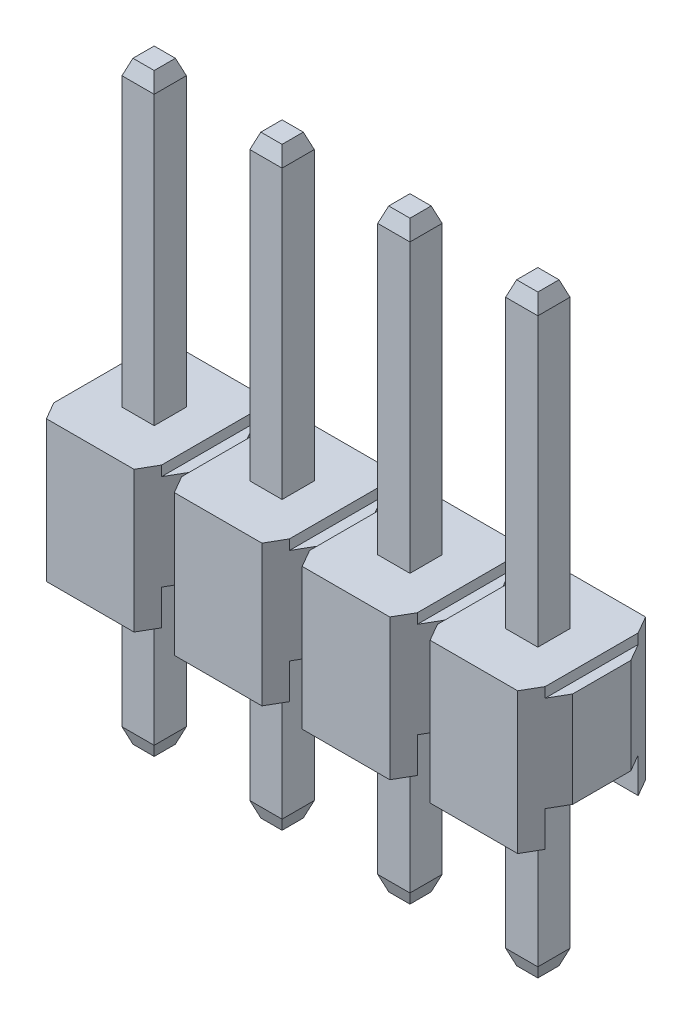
ISO-10303-21;
HEADER;
FILE_DESCRIPTION(('STEP AP214'),'2;1');
FILE_NAME('part.step','',(''),(''),'','','');
FILE_SCHEMA(('AUTOMOTIVE_DESIGN { 1 0 10303 214 1 1 1 1 }'));
ENDSEC;
DATA;
#1=APPLICATION_CONTEXT('core data for automotive mechanical design processes');
#2=APPLICATION_PROTOCOL_DEFINITION('international standard','automotive_design',2000,#1);
#3=PRODUCT_CONTEXT('',#1,'mechanical');
#4=PRODUCT('Part','Part','',(#3));
#5=PRODUCT_RELATED_PRODUCT_CATEGORY('part','',(#4));
#6=PRODUCT_DEFINITION_FORMATION('','',#4);
#7=PRODUCT_DEFINITION_CONTEXT('part definition',#1,'design');
#8=PRODUCT_DEFINITION('design','',#6,#7);
#9=PRODUCT_DEFINITION_SHAPE('','',#8);
#10=(LENGTH_UNIT() NAMED_UNIT(*) SI_UNIT(.MILLI.,.METRE.));
#11=(NAMED_UNIT(*) PLANE_ANGLE_UNIT() SI_UNIT($,.RADIAN.));
#12=(NAMED_UNIT(*) SI_UNIT($,.STERADIAN.) SOLID_ANGLE_UNIT());
#13=UNCERTAINTY_MEASURE_WITH_UNIT(LENGTH_MEASURE(1.E-05),#10,'distance_accuracy_value','');
#14=(GEOMETRIC_REPRESENTATION_CONTEXT(3) GLOBAL_UNCERTAINTY_ASSIGNED_CONTEXT((#13)) GLOBAL_UNIT_ASSIGNED_CONTEXT((#10,
#11,#12)) REPRESENTATION_CONTEXT('',''));
#15=CARTESIAN_POINT('',(0.,0.,0.));
#16=DIRECTION('',(0.,0.,1.));
#17=DIRECTION('',(1.,0.,0.));
#18=AXIS2_PLACEMENT_3D('',#15,#16,#17);
#19=CARTESIAN_POINT('',(-1.27,0.7,0.923589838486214));
#20=DIRECTION('',(0.,1.,0.));
#21=DIRECTION('',(0.,0.,1.));
#22=AXIS2_PLACEMENT_3D('',#19,#20,#21);
#23=PLANE('',#22);
#24=DIRECTION('',(1.,0.,0.));
#25=VECTOR('',#24,1.);
#26=CARTESIAN_POINT('',(-6.35,0.7,-0.319999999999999));
#27=LINE('',#26,#25);
#28=CARTESIAN_POINT('',(-5.4,0.7,-0.319999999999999));
#29=VERTEX_POINT('',#28);
#30=CARTESIAN_POINT('',(-4.76,0.7,-0.319999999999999));
#31=VERTEX_POINT('',#30);
#32=EDGE_CURVE('E787',#29,#31,#27,.T.);
#33=ORIENTED_EDGE('',*,*,#32,.F.);
#34=DIRECTION('',(0.,0.,-1.));
#35=VECTOR('',#34,1.);
#36=CARTESIAN_POINT('',(-5.4,0.7,0.923589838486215));
#37=LINE('',#36,#35);
#38=CARTESIAN_POINT('',(-5.4,0.7,0.320000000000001));
#39=VERTEX_POINT('',#38);
#40=EDGE_CURVE('E733',#39,#29,#37,.T.);
#41=ORIENTED_EDGE('',*,*,#40,.F.);
#42=DIRECTION('',(-1.,0.,0.));
#43=VECTOR('',#42,1.);
#44=CARTESIAN_POINT('',(-6.35,0.7,0.320000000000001));
#45=LINE('',#44,#43);
#46=CARTESIAN_POINT('',(-4.76,0.7,0.320000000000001));
#47=VERTEX_POINT('',#46);
#48=EDGE_CURVE('E778',#47,#39,#45,.T.);
#49=ORIENTED_EDGE('',*,*,#48,.F.);
#50=DIRECTION('',(0.,0.,1.));
#51=VECTOR('',#50,1.);
#52=CARTESIAN_POINT('',(-4.76,0.7,0.923589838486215));
#53=LINE('',#52,#51);
#54=EDGE_CURVE('E784',#31,#47,#53,.T.);
#55=ORIENTED_EDGE('',*,*,#54,.F.);
#56=EDGE_LOOP('',(#33,#41,#49,#55));
#57=FACE_BOUND('',#56,.T.);
#58=DIRECTION('',(0.,0.,-1.));
#59=VECTOR('',#58,1.);
#60=CARTESIAN_POINT('',(-0.32,0.7,0.923589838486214));
#61=LINE('',#60,#59);
#62=CARTESIAN_POINT('',(-0.32,0.7,0.32));
#63=VERTEX_POINT('',#62);
#64=CARTESIAN_POINT('',(-0.32,0.7,-0.32));
#65=VERTEX_POINT('',#64);
#66=EDGE_CURVE('E1522',#63,#65,#61,.T.);
#67=ORIENTED_EDGE('',*,*,#66,.F.);
#68=DIRECTION('',(-1.,0.,0.));
#69=VECTOR('',#68,1.);
#70=CARTESIAN_POINT('',(-1.27,0.7,0.32));
#71=LINE('',#70,#69);
#72=CARTESIAN_POINT('',(0.32,0.7,0.32));
#73=VERTEX_POINT('',#72);
#74=EDGE_CURVE('E1519',#73,#63,#71,.T.);
#75=ORIENTED_EDGE('',*,*,#74,.F.);
#76=DIRECTION('',(0.,0.,1.));
#77=VECTOR('',#76,1.);
#78=CARTESIAN_POINT('',(0.32,0.7,0.923589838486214));
#79=LINE('',#78,#77);
#80=CARTESIAN_POINT('',(0.32,0.699999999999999,-0.32));
#81=VERTEX_POINT('',#80);
#82=EDGE_CURVE('E1516',#81,#73,#79,.T.);
#83=ORIENTED_EDGE('',*,*,#82,.F.);
#84=DIRECTION('',(1.,0.,0.));
#85=VECTOR('',#84,1.);
#86=CARTESIAN_POINT('',(-1.27,0.7,-0.32));
#87=LINE('',#86,#85);
#88=EDGE_CURVE('E1513',#65,#81,#87,.T.);
#89=ORIENTED_EDGE('',*,*,#88,.F.);
#90=EDGE_LOOP('',(#67,#75,#83,#89));
#91=FACE_BOUND('',#90,.T.);
#92=DIRECTION('',(1.,0.,0.));
#93=VECTOR('',#92,1.);
#94=CARTESIAN_POINT('',(-1.27,0.7,-0.923589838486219));
#95=LINE('',#94,#93);
#96=CARTESIAN_POINT('',(-1.07,0.7,-0.923589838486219));
#97=VERTEX_POINT('',#96);
#98=CARTESIAN_POINT('',(1.07,0.7,-0.923589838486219));
#99=VERTEX_POINT('',#98);
#100=EDGE_CURVE('E1417',#97,#99,#95,.T.);
#101=ORIENTED_EDGE('',*,*,#100,.T.);
#102=DIRECTION('',(-0.499999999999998,0.,-0.86602540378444));
#103=VECTOR('',#102,1.);
#104=CARTESIAN_POINT('',(0.869999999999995,0.7,-1.27));
#105=LINE('',#104,#103);
#106=CARTESIAN_POINT('',(1.27,0.7,-0.577179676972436));
#107=VERTEX_POINT('',#106);
#108=EDGE_CURVE('E1499',#107,#99,#105,.T.);
#109=ORIENTED_EDGE('',*,*,#108,.F.);
#110=DIRECTION('',(0.,0.,1.));
#111=VECTOR('',#110,1.);
#112=CARTESIAN_POINT('',(1.27,0.7,0.923589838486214));
#113=LINE('',#112,#111);
#114=CARTESIAN_POINT('',(1.27,0.7,0.577179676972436));
#115=VERTEX_POINT('',#114);
#116=EDGE_CURVE('E1414',#107,#115,#113,.T.);
#117=ORIENTED_EDGE('',*,*,#116,.T.);
#118=DIRECTION('',(0.499999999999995,0.,-0.866025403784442));
#119=VECTOR('',#118,1.);
#120=CARTESIAN_POINT('',(0.869999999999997,0.7,1.27));
#121=LINE('',#120,#119);
#122=CARTESIAN_POINT('',(1.07,0.7,0.923589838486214));
#123=VERTEX_POINT('',#122);
#124=EDGE_CURVE('E1435',#123,#115,#121,.T.);
#125=ORIENTED_EDGE('',*,*,#124,.F.);
#126=DIRECTION('',(1.,0.,0.));
#127=VECTOR('',#126,1.);
#128=CARTESIAN_POINT('',(-1.27,0.7,0.923589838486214));
#129=LINE('',#128,#127);
#130=CARTESIAN_POINT('',(-1.07,0.7,0.923589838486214));
#131=VERTEX_POINT('',#130);
#132=EDGE_CURVE('E1418',#131,#123,#129,.T.);
#133=ORIENTED_EDGE('',*,*,#132,.F.);
#134=DIRECTION('',(0.499999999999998,0.,0.86602540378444));
#135=VECTOR('',#134,1.);
#136=CARTESIAN_POINT('',(-1.27,0.7,0.577179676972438));
#137=LINE('',#136,#135);
#138=CARTESIAN_POINT('',(-1.27,0.7,0.577179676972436));
#139=VERTEX_POINT('',#138);
#140=EDGE_CURVE('E1438',#139,#131,#137,.T.);
#141=ORIENTED_EDGE('',*,*,#140,.F.);
#142=DIRECTION('',(0.499999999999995,0.,-0.866025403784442));
#143=VECTOR('',#142,1.);
#144=CARTESIAN_POINT('',(-1.67,0.7,1.27));
#145=LINE('',#144,#143);
#146=CARTESIAN_POINT('',(-1.47,0.7,0.923589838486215));
#147=VERTEX_POINT('',#146);
#148=EDGE_CURVE('E1255',#147,#139,#145,.T.);
#149=ORIENTED_EDGE('',*,*,#148,.F.);
#150=DIRECTION('',(1.,0.,0.));
#151=VECTOR('',#150,1.);
#152=CARTESIAN_POINT('',(-3.81,0.7,0.923589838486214));
#153=LINE('',#152,#151);
#154=CARTESIAN_POINT('',(-3.61,0.7,0.923589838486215));
#155=VERTEX_POINT('',#154);
#156=EDGE_CURVE('E1258',#155,#147,#153,.T.);
#157=ORIENTED_EDGE('',*,*,#156,.F.);
#158=DIRECTION('',(0.499999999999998,0.,0.86602540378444));
#159=VECTOR('',#158,1.);
#160=CARTESIAN_POINT('',(-3.81,0.7,0.577179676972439));
#161=LINE('',#160,#159);
#162=CARTESIAN_POINT('',(-3.81,0.7,0.577179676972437));
#163=VERTEX_POINT('',#162);
#164=EDGE_CURVE('E1261',#163,#155,#161,.T.);
#165=ORIENTED_EDGE('',*,*,#164,.F.);
#166=DIRECTION('',(0.499999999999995,0.,-0.866025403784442));
#167=VECTOR('',#166,1.);
#168=CARTESIAN_POINT('',(-4.21,0.7,1.27));
#169=LINE('',#168,#167);
#170=CARTESIAN_POINT('',(-4.01,0.7,0.923589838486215));
#171=VERTEX_POINT('',#170);
#172=EDGE_CURVE('E1143',#171,#163,#169,.T.);
#173=ORIENTED_EDGE('',*,*,#172,.F.);
#174=DIRECTION('',(1.,0.,0.));
#175=VECTOR('',#174,1.);
#176=CARTESIAN_POINT('',(-6.35,0.7,0.923589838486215));
#177=LINE('',#176,#175);
#178=CARTESIAN_POINT('',(-6.15,0.7,0.923589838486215));
#179=VERTEX_POINT('',#178);
#180=EDGE_CURVE('E1146',#179,#171,#177,.T.);
#181=ORIENTED_EDGE('',*,*,#180,.F.);
#182=DIRECTION('',(0.499999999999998,0.,0.86602540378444));
#183=VECTOR('',#182,1.);
#184=CARTESIAN_POINT('',(-6.35,0.7,0.57717967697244));
#185=LINE('',#184,#183);
#186=CARTESIAN_POINT('',(-6.35,0.7,0.577179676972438));
#187=VERTEX_POINT('',#186);
#188=EDGE_CURVE('E1149',#187,#179,#185,.T.);
#189=ORIENTED_EDGE('',*,*,#188,.F.);
#190=DIRECTION('',(0.499999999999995,0.,-0.866025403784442));
#191=VECTOR('',#190,1.);
#192=CARTESIAN_POINT('',(-6.75,0.7,1.27));
#193=LINE('',#192,#191);
#194=CARTESIAN_POINT('',(-6.55,0.7,0.923589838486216));
#195=VERTEX_POINT('',#194);
#196=EDGE_CURVE('E1023',#195,#187,#193,.T.);
#197=ORIENTED_EDGE('',*,*,#196,.F.);
#198=DIRECTION('',(1.,0.,0.));
#199=VECTOR('',#198,1.);
#200=CARTESIAN_POINT('',(-8.89,0.7,0.923589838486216));
#201=LINE('',#200,#199);
#202=CARTESIAN_POINT('',(-8.69,0.7,0.923589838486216));
#203=VERTEX_POINT('',#202);
#204=EDGE_CURVE('E1026',#203,#195,#201,.T.);
#205=ORIENTED_EDGE('',*,*,#204,.F.);
#206=DIRECTION('',(0.499999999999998,0.,0.86602540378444));
#207=VECTOR('',#206,1.);
#208=CARTESIAN_POINT('',(-8.89,0.7,0.57717967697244));
#209=LINE('',#208,#207);
#210=CARTESIAN_POINT('',(-8.89,0.7,0.577179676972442));
#211=VERTEX_POINT('',#210);
#212=EDGE_CURVE('E1029',#211,#203,#209,.T.);
#213=ORIENTED_EDGE('',*,*,#212,.F.);
#214=DIRECTION('',(0.,0.,1.));
#215=VECTOR('',#214,1.);
#216=CARTESIAN_POINT('',(-8.89,0.7,0.923589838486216));
#217=LINE('',#216,#215);
#218=CARTESIAN_POINT('',(-8.89,0.7,-0.577179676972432));
#219=VERTEX_POINT('',#218);
#220=EDGE_CURVE('E1032',#219,#211,#217,.T.);
#221=ORIENTED_EDGE('',*,*,#220,.F.);
#222=DIRECTION('',(-0.499999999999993,0.,0.866025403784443));
#223=VECTOR('',#222,1.);
#224=CARTESIAN_POINT('',(-8.89,0.7,-0.577179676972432));
#225=LINE('',#224,#223);
#226=CARTESIAN_POINT('',(-8.69,0.7,-0.923589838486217));
#227=VERTEX_POINT('',#226);
#228=EDGE_CURVE('E1035',#227,#219,#225,.T.);
#229=ORIENTED_EDGE('',*,*,#228,.F.);
#230=DIRECTION('',(1.,0.,0.));
#231=VECTOR('',#230,1.);
#232=CARTESIAN_POINT('',(-8.89,0.7,-0.923589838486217));
#233=LINE('',#232,#231);
#234=CARTESIAN_POINT('',(-6.55,0.7,-0.923589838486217));
#235=VERTEX_POINT('',#234);
#236=EDGE_CURVE('E1018',#227,#235,#233,.T.);
#237=ORIENTED_EDGE('',*,*,#236,.T.);
#238=DIRECTION('',(-0.499999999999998,0.,-0.86602540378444));
#239=VECTOR('',#238,1.);
#240=CARTESIAN_POINT('',(-6.75000000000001,0.7,-1.27));
#241=LINE('',#240,#239);
#242=CARTESIAN_POINT('',(-6.35,0.7,-0.577179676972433));
#243=VERTEX_POINT('',#242);
#244=EDGE_CURVE('E1020',#243,#235,#241,.T.);
#245=ORIENTED_EDGE('',*,*,#244,.F.);
#246=DIRECTION('',(-0.499999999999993,0.,0.866025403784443));
#247=VECTOR('',#246,1.);
#248=CARTESIAN_POINT('',(-6.35,0.7,-0.577179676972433));
#249=LINE('',#248,#247);
#250=CARTESIAN_POINT('',(-6.15,0.7,-0.923589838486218));
#251=VERTEX_POINT('',#250);
#252=EDGE_CURVE('E1152',#251,#243,#249,.T.);
#253=ORIENTED_EDGE('',*,*,#252,.F.);
#254=DIRECTION('',(1.,0.,0.));
#255=VECTOR('',#254,1.);
#256=CARTESIAN_POINT('',(-6.35,0.7,-0.923589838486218));
#257=LINE('',#256,#255);
#258=CARTESIAN_POINT('',(-4.01,0.7,-0.923589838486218));
#259=VERTEX_POINT('',#258);
#260=EDGE_CURVE('E1138',#251,#259,#257,.T.);
#261=ORIENTED_EDGE('',*,*,#260,.T.);
#262=DIRECTION('',(-0.499999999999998,0.,-0.86602540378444));
#263=VECTOR('',#262,1.);
#264=CARTESIAN_POINT('',(-4.21000000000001,0.7,-1.27));
#265=LINE('',#264,#263);
#266=CARTESIAN_POINT('',(-3.81,0.7,-0.577179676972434));
#267=VERTEX_POINT('',#266);
#268=EDGE_CURVE('E1140',#267,#259,#265,.T.);
#269=ORIENTED_EDGE('',*,*,#268,.F.);
#270=DIRECTION('',(-0.499999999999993,0.,0.866025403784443));
#271=VECTOR('',#270,1.);
#272=CARTESIAN_POINT('',(-3.81,0.7,-0.577179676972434));
#273=LINE('',#272,#271);
#274=CARTESIAN_POINT('',(-3.61,0.7,-0.923589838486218));
#275=VERTEX_POINT('',#274);
#276=EDGE_CURVE('E1264',#275,#267,#273,.T.);
#277=ORIENTED_EDGE('',*,*,#276,.F.);
#278=DIRECTION('',(1.,0.,0.));
#279=VECTOR('',#278,1.);
#280=CARTESIAN_POINT('',(-3.81,0.7,-0.923589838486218));
#281=LINE('',#280,#279);
#282=CARTESIAN_POINT('',(-1.47,0.7,-0.923589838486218));
#283=VERTEX_POINT('',#282);
#284=EDGE_CURVE('E1250',#275,#283,#281,.T.);
#285=ORIENTED_EDGE('',*,*,#284,.T.);
#286=DIRECTION('',(-0.499999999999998,0.,-0.86602540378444));
#287=VECTOR('',#286,1.);
#288=CARTESIAN_POINT('',(-1.67000000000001,0.7,-1.27));
#289=LINE('',#288,#287);
#290=CARTESIAN_POINT('',(-1.27,0.7,-0.577179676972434));
#291=VERTEX_POINT('',#290);
#292=EDGE_CURVE('E1252',#291,#283,#289,.T.);
#293=ORIENTED_EDGE('',*,*,#292,.F.);
#294=DIRECTION('',(-0.499999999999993,0.,0.866025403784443));
#295=VECTOR('',#294,1.);
#296=CARTESIAN_POINT('',(-1.27,0.7,-0.577179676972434));
#297=LINE('',#296,#295);
#298=EDGE_CURVE('E1441',#97,#291,#297,.T.);
#299=ORIENTED_EDGE('',*,*,#298,.F.);
#300=EDGE_LOOP('',(#101,#109,#117,#125,#133,#141,#149,#157,#165,#173,#181,#189,#197,#205,#213,
#221,#229,#237,#245,#253,#261,#269,#277,#285,#293,#299));
#301=FACE_BOUND('',#300,.T.);
#302=DIRECTION('',(1.,0.,0.));
#303=VECTOR('',#302,1.);
#304=CARTESIAN_POINT('',(-3.81,0.7,-0.319999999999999));
#305=LINE('',#304,#303);
#306=CARTESIAN_POINT('',(-2.86,0.7,-0.319999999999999));
#307=VERTEX_POINT('',#306);
#308=CARTESIAN_POINT('',(-2.22,0.7,-0.319999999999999));
#309=VERTEX_POINT('',#308);
#310=EDGE_CURVE('E844',#307,#309,#305,.T.);
#311=ORIENTED_EDGE('',*,*,#310,.F.);
#312=DIRECTION('',(0.,0.,-1.));
#313=VECTOR('',#312,1.);
#314=CARTESIAN_POINT('',(-2.86,0.7,0.923589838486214));
#315=LINE('',#314,#313);
#316=CARTESIAN_POINT('',(-2.86,0.7,0.320000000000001));
#317=VERTEX_POINT('',#316);
#318=EDGE_CURVE('E790',#317,#307,#315,.T.);
#319=ORIENTED_EDGE('',*,*,#318,.F.);
#320=DIRECTION('',(-1.,0.,0.));
#321=VECTOR('',#320,1.);
#322=CARTESIAN_POINT('',(-3.81,0.7,0.320000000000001));
#323=LINE('',#322,#321);
#324=CARTESIAN_POINT('',(-2.22,0.7,0.320000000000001));
#325=VERTEX_POINT('',#324);
#326=EDGE_CURVE('E835',#325,#317,#323,.T.);
#327=ORIENTED_EDGE('',*,*,#326,.F.);
#328=DIRECTION('',(0.,0.,1.));
#329=VECTOR('',#328,1.);
#330=CARTESIAN_POINT('',(-2.22,0.7,0.923589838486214));
#331=LINE('',#330,#329);
#332=EDGE_CURVE('E841',#309,#325,#331,.T.);
#333=ORIENTED_EDGE('',*,*,#332,.F.);
#334=EDGE_LOOP('',(#311,#319,#327,#333));
#335=FACE_BOUND('',#334,.T.);
#336=DIRECTION('',(1.,0.,0.));
#337=VECTOR('',#336,1.);
#338=CARTESIAN_POINT('',(-8.89,0.7,-0.319999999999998));
#339=LINE('',#338,#337);
#340=CARTESIAN_POINT('',(-7.94,0.7,-0.319999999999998));
#341=VERTEX_POINT('',#340);
#342=CARTESIAN_POINT('',(-7.3,0.7,-0.319999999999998));
#343=VERTEX_POINT('',#342);
#344=EDGE_CURVE('E730',#341,#343,#339,.T.);
#345=ORIENTED_EDGE('',*,*,#344,.F.);
#346=DIRECTION('',(0.,0.,-1.));
#347=VECTOR('',#346,1.);
#348=CARTESIAN_POINT('',(-7.94,0.7,0.923589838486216));
#349=LINE('',#348,#347);
#350=CARTESIAN_POINT('',(-7.94,0.7,0.320000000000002));
#351=VERTEX_POINT('',#350);
#352=EDGE_CURVE('E693',#351,#341,#349,.T.);
#353=ORIENTED_EDGE('',*,*,#352,.F.);
#354=DIRECTION('',(-1.,0.,0.));
#355=VECTOR('',#354,1.);
#356=CARTESIAN_POINT('',(-8.89,0.7,0.320000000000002));
#357=LINE('',#356,#355);
#358=CARTESIAN_POINT('',(-7.3,0.7,0.320000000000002));
#359=VERTEX_POINT('',#358);
#360=EDGE_CURVE('E52',#359,#351,#357,.T.);
#361=ORIENTED_EDGE('',*,*,#360,.F.);
#362=DIRECTION('',(0.,0.,1.));
#363=VECTOR('',#362,1.);
#364=CARTESIAN_POINT('',(-7.3,0.7,0.923589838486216));
#365=LINE('',#364,#363);
#366=EDGE_CURVE('E47',#343,#359,#365,.T.);
#367=ORIENTED_EDGE('',*,*,#366,.F.);
#368=EDGE_LOOP('',(#345,#353,#361,#367));
#369=FACE_BOUND('',#368,.T.);
#370=ADVANCED_FACE('F30',(#57,#91,#301,#335,#369),#23,.F.);
#371=CARTESIAN_POINT('',(-6.35,2.8,-1.27));
#372=DIRECTION('',(0.,-1.,0.));
#373=DIRECTION('',(0.,0.,-1.));
#374=AXIS2_PLACEMENT_3D('',#371,#372,#373);
#375=PLANE('',#374);
#376=DIRECTION('',(0.499999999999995,0.,-0.866025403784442));
#377=VECTOR('',#376,1.);
#378=CARTESIAN_POINT('',(-6.75,2.8,1.27));
#379=LINE('',#378,#377);
#380=CARTESIAN_POINT('',(-6.75,2.8,1.27));
#381=VERTEX_POINT('',#380);
#382=CARTESIAN_POINT('',(-6.55,2.8,0.923589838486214));
#383=VERTEX_POINT('',#382);
#384=EDGE_CURVE('E1077',#381,#383,#379,.T.);
#385=ORIENTED_EDGE('',*,*,#384,.T.);
#386=DIRECTION('',(0.,0.,-1.));
#387=VECTOR('',#386,1.);
#388=CARTESIAN_POINT('',(-6.55,2.8,-1.27));
#389=LINE('',#388,#387);
#390=CARTESIAN_POINT('',(-6.55,2.8,-0.923589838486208));
#391=VERTEX_POINT('',#390);
#392=EDGE_CURVE('E1068',#383,#391,#389,.T.);
#393=ORIENTED_EDGE('',*,*,#392,.T.);
#394=DIRECTION('',(-0.499999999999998,0.,-0.86602540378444));
#395=VECTOR('',#394,1.);
#396=CARTESIAN_POINT('',(-6.75000000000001,2.8,-1.27));
#397=LINE('',#396,#395);
#398=CARTESIAN_POINT('',(-6.75000000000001,2.8,-1.27));
#399=VERTEX_POINT('',#398);
#400=EDGE_CURVE('E1063',#391,#399,#397,.T.);
#401=ORIENTED_EDGE('',*,*,#400,.T.);
#402=DIRECTION('',(-1.,0.,0.));
#403=VECTOR('',#402,1.);
#404=CARTESIAN_POINT('',(-8.49,2.8,-1.27));
#405=LINE('',#404,#403);
#406=CARTESIAN_POINT('',(-8.49,2.8,-1.27));
#407=VERTEX_POINT('',#406);
#408=EDGE_CURVE('E1104',#399,#407,#405,.T.);
#409=ORIENTED_EDGE('',*,*,#408,.T.);
#410=DIRECTION('',(-0.499999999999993,0.,0.866025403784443));
#411=VECTOR('',#410,1.);
#412=CARTESIAN_POINT('',(-8.89,2.8,-0.577179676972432));
#413=LINE('',#412,#411);
#414=CARTESIAN_POINT('',(-8.69,2.8,-0.923589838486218));
#415=VERTEX_POINT('',#414);
#416=EDGE_CURVE('E1106',#407,#415,#413,.T.);
#417=ORIENTED_EDGE('',*,*,#416,.T.);
#418=DIRECTION('',(0.,0.,1.));
#419=VECTOR('',#418,1.);
#420=CARTESIAN_POINT('',(-8.69,2.8,-1.27));
#421=LINE('',#420,#419);
#422=CARTESIAN_POINT('',(-8.69,2.8,0.923589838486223));
#423=VERTEX_POINT('',#422);
#424=EDGE_CURVE('E1108',#415,#423,#421,.T.);
#425=ORIENTED_EDGE('',*,*,#424,.T.);
#426=DIRECTION('',(0.499999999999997,0.,0.86602540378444));
#427=VECTOR('',#426,1.);
#428=CARTESIAN_POINT('',(-8.89,2.8,0.57717967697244));
#429=LINE('',#428,#427);
#430=CARTESIAN_POINT('',(-8.49,2.8,1.27));
#431=VERTEX_POINT('',#430);
#432=EDGE_CURVE('E1110',#423,#431,#429,.T.);
#433=ORIENTED_EDGE('',*,*,#432,.T.);
#434=DIRECTION('',(1.,0.,0.));
#435=VECTOR('',#434,1.);
#436=CARTESIAN_POINT('',(-8.49,2.8,1.27));
#437=LINE('',#436,#435);
#438=EDGE_CURVE('E1098',#431,#381,#437,.T.);
#439=ORIENTED_EDGE('',*,*,#438,.T.);
#440=EDGE_LOOP('',(#385,#393,#401,#409,#417,#425,#433,#439));
#441=FACE_BOUND('',#440,.T.);
#442=DIRECTION('',(0.,0.,1.));
#443=VECTOR('',#442,1.);
#444=CARTESIAN_POINT('',(-7.94,2.8,-1.27));
#445=LINE('',#444,#443);
#446=CARTESIAN_POINT('',(-7.94,2.8,-0.319999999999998));
#447=VERTEX_POINT('',#446);
#448=CARTESIAN_POINT('',(-7.94,2.8,0.320000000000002));
#449=VERTEX_POINT('',#448);
#450=EDGE_CURVE('E901',#447,#449,#445,.T.);
#451=ORIENTED_EDGE('',*,*,#450,.F.);
#452=DIRECTION('',(-1.,0.,0.));
#453=VECTOR('',#452,1.);
#454=CARTESIAN_POINT('',(-6.35,2.8,-0.319999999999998));
#455=LINE('',#454,#453);
#456=CARTESIAN_POINT('',(-7.3,2.8,-0.319999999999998));
#457=VERTEX_POINT('',#456);
#458=EDGE_CURVE('E847',#457,#447,#455,.T.);
#459=ORIENTED_EDGE('',*,*,#458,.F.);
#460=DIRECTION('',(0.,0.,-1.));
#461=VECTOR('',#460,1.);
#462=CARTESIAN_POINT('',(-7.3,2.8,-1.27));
#463=LINE('',#462,#461);
#464=CARTESIAN_POINT('',(-7.3,2.8,0.320000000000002));
#465=VERTEX_POINT('',#464);
#466=EDGE_CURVE('E892',#465,#457,#463,.T.);
#467=ORIENTED_EDGE('',*,*,#466,.F.);
#468=DIRECTION('',(1.,0.,0.));
#469=VECTOR('',#468,1.);
#470=CARTESIAN_POINT('',(-6.35,2.8,0.320000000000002));
#471=LINE('',#470,#469);
#472=EDGE_CURVE('E898',#449,#465,#471,.T.);
#473=ORIENTED_EDGE('',*,*,#472,.F.);
#474=EDGE_LOOP('',(#451,#459,#467,#473));
#475=FACE_BOUND('',#474,.T.);
#476=ADVANCED_FACE('F1624',(#441,#475),#375,.F.);
#477=CARTESIAN_POINT('',(-3.81,2.8,-1.27));
#478=DIRECTION('',(0.,-1.,0.));
#479=DIRECTION('',(0.,0.,-1.));
#480=AXIS2_PLACEMENT_3D('',#477,#478,#479);
#481=PLANE('',#480);
#482=DIRECTION('',(0.499999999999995,0.,-0.866025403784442));
#483=VECTOR('',#482,1.);
#484=CARTESIAN_POINT('',(-4.21,2.8,1.27));
#485=LINE('',#484,#483);
#486=CARTESIAN_POINT('',(-4.21,2.8,1.27));
#487=VERTEX_POINT('',#486);
#488=CARTESIAN_POINT('',(-4.01,2.8,0.923589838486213));
#489=VERTEX_POINT('',#488);
#490=EDGE_CURVE('E1193',#487,#489,#485,.T.);
#491=ORIENTED_EDGE('',*,*,#490,.T.);
#492=DIRECTION('',(0.,0.,-1.));
#493=VECTOR('',#492,1.);
#494=CARTESIAN_POINT('',(-4.01,2.8,-1.27));
#495=LINE('',#494,#493);
#496=CARTESIAN_POINT('',(-4.01,2.8,-0.923589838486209));
#497=VERTEX_POINT('',#496);
#498=EDGE_CURVE('E1184',#489,#497,#495,.T.);
#499=ORIENTED_EDGE('',*,*,#498,.T.);
#500=DIRECTION('',(-0.499999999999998,0.,-0.86602540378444));
#501=VECTOR('',#500,1.);
#502=CARTESIAN_POINT('',(-4.21000000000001,2.8,-1.27));
#503=LINE('',#502,#501);
#504=CARTESIAN_POINT('',(-4.21000000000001,2.8,-1.27));
#505=VERTEX_POINT('',#504);
#506=EDGE_CURVE('E1179',#497,#505,#503,.T.);
#507=ORIENTED_EDGE('',*,*,#506,.T.);
#508=DIRECTION('',(-1.,0.,0.));
#509=VECTOR('',#508,1.);
#510=CARTESIAN_POINT('',(-5.95,2.8,-1.27));
#511=LINE('',#510,#509);
#512=CARTESIAN_POINT('',(-5.95,2.8,-1.27));
#513=VERTEX_POINT('',#512);
#514=EDGE_CURVE('E1220',#505,#513,#511,.T.);
#515=ORIENTED_EDGE('',*,*,#514,.T.);
#516=DIRECTION('',(-0.499999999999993,0.,0.866025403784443));
#517=VECTOR('',#516,1.);
#518=CARTESIAN_POINT('',(-6.35,2.8,-0.577179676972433));
#519=LINE('',#518,#517);
#520=CARTESIAN_POINT('',(-6.15,2.8,-0.923589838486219));
#521=VERTEX_POINT('',#520);
#522=EDGE_CURVE('E1222',#513,#521,#519,.T.);
#523=ORIENTED_EDGE('',*,*,#522,.T.);
#524=DIRECTION('',(0.,0.,1.));
#525=VECTOR('',#524,1.);
#526=CARTESIAN_POINT('',(-6.15,2.8,-1.27));
#527=LINE('',#526,#525);
#528=CARTESIAN_POINT('',(-6.15,2.8,0.923589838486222));
#529=VERTEX_POINT('',#528);
#530=EDGE_CURVE('E1224',#521,#529,#527,.T.);
#531=ORIENTED_EDGE('',*,*,#530,.T.);
#532=DIRECTION('',(0.499999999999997,0.,0.86602540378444));
#533=VECTOR('',#532,1.);
#534=CARTESIAN_POINT('',(-6.35,2.8,0.57717967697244));
#535=LINE('',#534,#533);
#536=CARTESIAN_POINT('',(-5.95,2.8,1.27));
#537=VERTEX_POINT('',#536);
#538=EDGE_CURVE('E1226',#529,#537,#535,.T.);
#539=ORIENTED_EDGE('',*,*,#538,.T.);
#540=DIRECTION('',(1.,0.,0.));
#541=VECTOR('',#540,1.);
#542=CARTESIAN_POINT('',(-5.95,2.8,1.27));
#543=LINE('',#542,#541);
#544=EDGE_CURVE('E1214',#537,#487,#543,.T.);
#545=ORIENTED_EDGE('',*,*,#544,.T.);
#546=EDGE_LOOP('',(#491,#499,#507,#515,#523,#531,#539,#545));
#547=FACE_BOUND('',#546,.T.);
#548=DIRECTION('',(0.,0.,1.));
#549=VECTOR('',#548,1.);
#550=CARTESIAN_POINT('',(-5.4,2.8,-1.27));
#551=LINE('',#550,#549);
#552=CARTESIAN_POINT('',(-5.4,2.8,-0.319999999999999));
#553=VERTEX_POINT('',#552);
#554=CARTESIAN_POINT('',(-5.4,2.8,0.320000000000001));
#555=VERTEX_POINT('',#554);
#556=EDGE_CURVE('E958',#553,#555,#551,.T.);
#557=ORIENTED_EDGE('',*,*,#556,.F.);
#558=DIRECTION('',(-1.,0.,0.));
#559=VECTOR('',#558,1.);
#560=CARTESIAN_POINT('',(-3.81,2.8,-0.319999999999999));
#561=LINE('',#560,#559);
#562=CARTESIAN_POINT('',(-4.76,2.8,-0.319999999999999));
#563=VERTEX_POINT('',#562);
#564=EDGE_CURVE('E904',#563,#553,#561,.T.);
#565=ORIENTED_EDGE('',*,*,#564,.F.);
#566=DIRECTION('',(0.,0.,-1.));
#567=VECTOR('',#566,1.);
#568=CARTESIAN_POINT('',(-4.76,2.8,-1.27));
#569=LINE('',#568,#567);
#570=CARTESIAN_POINT('',(-4.76,2.8,0.320000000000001));
#571=VERTEX_POINT('',#570);
#572=EDGE_CURVE('E949',#571,#563,#569,.T.);
#573=ORIENTED_EDGE('',*,*,#572,.F.);
#574=DIRECTION('',(1.,0.,0.));
#575=VECTOR('',#574,1.);
#576=CARTESIAN_POINT('',(-3.81,2.8,0.320000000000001));
#577=LINE('',#576,#575);
#578=EDGE_CURVE('E955',#555,#571,#577,.T.);
#579=ORIENTED_EDGE('',*,*,#578,.F.);
#580=EDGE_LOOP('',(#557,#565,#573,#579));
#581=FACE_BOUND('',#580,.T.);
#582=ADVANCED_FACE('F1630',(#547,#581),#481,.F.);
#583=CARTESIAN_POINT('',(-1.27,2.8,-1.27));
#584=DIRECTION('',(0.,-1.,0.));
#585=DIRECTION('',(0.,0.,-1.));
#586=AXIS2_PLACEMENT_3D('',#583,#584,#585);
#587=PLANE('',#586);
#588=DIRECTION('',(0.499999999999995,0.,-0.866025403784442));
#589=VECTOR('',#588,1.);
#590=CARTESIAN_POINT('',(-1.67,2.8,1.27));
#591=LINE('',#590,#589);
#592=CARTESIAN_POINT('',(-1.67,2.8,1.27));
#593=VERTEX_POINT('',#592);
#594=CARTESIAN_POINT('',(-1.47,2.8,0.923589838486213));
#595=VERTEX_POINT('',#594);
#596=EDGE_CURVE('E1305',#593,#595,#591,.T.);
#597=ORIENTED_EDGE('',*,*,#596,.T.);
#598=DIRECTION('',(0.,0.,-1.));
#599=VECTOR('',#598,1.);
#600=CARTESIAN_POINT('',(-1.47,2.8,-1.27));
#601=LINE('',#600,#599);
#602=CARTESIAN_POINT('',(-1.47,2.8,-0.92358983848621));
#603=VERTEX_POINT('',#602);
#604=EDGE_CURVE('E1296',#595,#603,#601,.T.);
#605=ORIENTED_EDGE('',*,*,#604,.T.);
#606=DIRECTION('',(-0.499999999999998,0.,-0.86602540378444));
#607=VECTOR('',#606,1.);
#608=CARTESIAN_POINT('',(-1.67000000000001,2.8,-1.27));
#609=LINE('',#608,#607);
#610=CARTESIAN_POINT('',(-1.67000000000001,2.8,-1.27));
#611=VERTEX_POINT('',#610);
#612=EDGE_CURVE('E1291',#603,#611,#609,.T.);
#613=ORIENTED_EDGE('',*,*,#612,.T.);
#614=DIRECTION('',(-1.,0.,0.));
#615=VECTOR('',#614,1.);
#616=CARTESIAN_POINT('',(-3.41,2.8,-1.27));
#617=LINE('',#616,#615);
#618=CARTESIAN_POINT('',(-3.41,2.8,-1.27));
#619=VERTEX_POINT('',#618);
#620=EDGE_CURVE('E1332',#611,#619,#617,.T.);
#621=ORIENTED_EDGE('',*,*,#620,.T.);
#622=DIRECTION('',(-0.499999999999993,0.,0.866025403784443));
#623=VECTOR('',#622,1.);
#624=CARTESIAN_POINT('',(-3.81,2.8,-0.577179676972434));
#625=LINE('',#624,#623);
#626=CARTESIAN_POINT('',(-3.61,2.8,-0.92358983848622));
#627=VERTEX_POINT('',#626);
#628=EDGE_CURVE('E1334',#619,#627,#625,.T.);
#629=ORIENTED_EDGE('',*,*,#628,.T.);
#630=DIRECTION('',(0.,0.,1.));
#631=VECTOR('',#630,1.);
#632=CARTESIAN_POINT('',(-3.61,2.8,-1.27));
#633=LINE('',#632,#631);
#634=CARTESIAN_POINT('',(-3.61,2.8,0.923589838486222));
#635=VERTEX_POINT('',#634);
#636=EDGE_CURVE('E1336',#627,#635,#633,.T.);
#637=ORIENTED_EDGE('',*,*,#636,.T.);
#638=DIRECTION('',(0.499999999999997,0.,0.86602540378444));
#639=VECTOR('',#638,1.);
#640=CARTESIAN_POINT('',(-3.81,2.8,0.577179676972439));
#641=LINE('',#640,#639);
#642=CARTESIAN_POINT('',(-3.41,2.8,1.27));
#643=VERTEX_POINT('',#642);
#644=EDGE_CURVE('E1338',#635,#643,#641,.T.);
#645=ORIENTED_EDGE('',*,*,#644,.T.);
#646=DIRECTION('',(1.,0.,0.));
#647=VECTOR('',#646,1.);
#648=CARTESIAN_POINT('',(-3.41,2.8,1.27));
#649=LINE('',#648,#647);
#650=EDGE_CURVE('E1326',#643,#593,#649,.T.);
#651=ORIENTED_EDGE('',*,*,#650,.T.);
#652=EDGE_LOOP('',(#597,#605,#613,#621,#629,#637,#645,#651));
#653=FACE_BOUND('',#652,.T.);
#654=DIRECTION('',(0.,0.,1.));
#655=VECTOR('',#654,1.);
#656=CARTESIAN_POINT('',(-2.86,2.8,-1.27));
#657=LINE('',#656,#655);
#658=CARTESIAN_POINT('',(-2.86,2.8,-0.319999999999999));
#659=VERTEX_POINT('',#658);
#660=CARTESIAN_POINT('',(-2.86,2.8,0.320000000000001));
#661=VERTEX_POINT('',#660);
#662=EDGE_CURVE('E1015',#659,#661,#657,.T.);
#663=ORIENTED_EDGE('',*,*,#662,.F.);
#664=DIRECTION('',(-1.,0.,0.));
#665=VECTOR('',#664,1.);
#666=CARTESIAN_POINT('',(-1.27,2.8,-0.319999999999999));
#667=LINE('',#666,#665);
#668=CARTESIAN_POINT('',(-2.22,2.8,-0.319999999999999));
#669=VERTEX_POINT('',#668);
#670=EDGE_CURVE('E961',#669,#659,#667,.T.);
#671=ORIENTED_EDGE('',*,*,#670,.F.);
#672=DIRECTION('',(0.,0.,-1.));
#673=VECTOR('',#672,1.);
#674=CARTESIAN_POINT('',(-2.22,2.8,-1.27));
#675=LINE('',#674,#673);
#676=CARTESIAN_POINT('',(-2.22,2.8,0.320000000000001));
#677=VERTEX_POINT('',#676);
#678=EDGE_CURVE('E1006',#677,#669,#675,.T.);
#679=ORIENTED_EDGE('',*,*,#678,.F.);
#680=DIRECTION('',(1.,0.,0.));
#681=VECTOR('',#680,1.);
#682=CARTESIAN_POINT('',(-1.27,2.8,0.320000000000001));
#683=LINE('',#682,#681);
#684=EDGE_CURVE('E1012',#661,#677,#683,.T.);
#685=ORIENTED_EDGE('',*,*,#684,.F.);
#686=EDGE_LOOP('',(#663,#671,#679,#685));
#687=FACE_BOUND('',#686,.T.);
#688=ADVANCED_FACE('F1650',(#653,#687),#587,.F.);
#689=CARTESIAN_POINT('',(1.27,2.8,-1.27));
#690=DIRECTION('',(0.,-1.,0.));
#691=DIRECTION('',(0.,0.,-1.));
#692=AXIS2_PLACEMENT_3D('',#689,#690,#691);
#693=PLANE('',#692);
#694=DIRECTION('',(0.499999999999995,0.,-0.866025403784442));
#695=VECTOR('',#694,1.);
#696=CARTESIAN_POINT('',(0.869999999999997,2.8,1.27));
#697=LINE('',#696,#695);
#698=CARTESIAN_POINT('',(0.869999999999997,2.8,1.27));
#699=VERTEX_POINT('',#698);
#700=CARTESIAN_POINT('',(1.07,2.8,0.923589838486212));
#701=VERTEX_POINT('',#700);
#702=EDGE_CURVE('E1455',#699,#701,#697,.T.);
#703=ORIENTED_EDGE('',*,*,#702,.T.);
#704=DIRECTION('',(0.,0.,-1.));
#705=VECTOR('',#704,1.);
#706=CARTESIAN_POINT('',(1.07,2.8,-1.27));
#707=LINE('',#706,#705);
#708=CARTESIAN_POINT('',(1.07,2.8,-0.92358983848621));
#709=VERTEX_POINT('',#708);
#710=EDGE_CURVE('E1507',#701,#709,#707,.T.);
#711=ORIENTED_EDGE('',*,*,#710,.T.);
#712=DIRECTION('',(-0.499999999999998,0.,-0.86602540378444));
#713=VECTOR('',#712,1.);
#714=CARTESIAN_POINT('',(0.869999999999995,2.8,-1.27));
#715=LINE('',#714,#713);
#716=CARTESIAN_POINT('',(0.869999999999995,2.8,-1.27));
#717=VERTEX_POINT('',#716);
#718=EDGE_CURVE('E1458',#709,#717,#715,.T.);
#719=ORIENTED_EDGE('',*,*,#718,.T.);
#720=DIRECTION('',(-1.,0.,0.));
#721=VECTOR('',#720,1.);
#722=CARTESIAN_POINT('',(-0.87,2.8,-1.27));
#723=LINE('',#722,#721);
#724=CARTESIAN_POINT('',(-0.87,2.8,-1.27));
#725=VERTEX_POINT('',#724);
#726=EDGE_CURVE('E1444',#717,#725,#723,.T.);
#727=ORIENTED_EDGE('',*,*,#726,.T.);
#728=DIRECTION('',(-0.499999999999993,0.,0.866025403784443));
#729=VECTOR('',#728,1.);
#730=CARTESIAN_POINT('',(-1.27,2.8,-0.577179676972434));
#731=LINE('',#730,#729);
#732=CARTESIAN_POINT('',(-1.07,2.8,-0.92358983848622));
#733=VERTEX_POINT('',#732);
#734=EDGE_CURVE('E1447',#725,#733,#731,.T.);
#735=ORIENTED_EDGE('',*,*,#734,.T.);
#736=DIRECTION('',(0.,0.,1.));
#737=VECTOR('',#736,1.);
#738=CARTESIAN_POINT('',(-1.07,2.8,-1.27));
#739=LINE('',#738,#737);
#740=CARTESIAN_POINT('',(-1.07,2.8,0.923589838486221));
#741=VERTEX_POINT('',#740);
#742=EDGE_CURVE('E1502',#733,#741,#739,.T.);
#743=ORIENTED_EDGE('',*,*,#742,.T.);
#744=DIRECTION('',(0.499999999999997,0.,0.86602540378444));
#745=VECTOR('',#744,1.);
#746=CARTESIAN_POINT('',(-1.27,2.8,0.577179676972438));
#747=LINE('',#746,#745);
#748=CARTESIAN_POINT('',(-0.869999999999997,2.8,1.27));
#749=VERTEX_POINT('',#748);
#750=EDGE_CURVE('E1451',#741,#749,#747,.T.);
#751=ORIENTED_EDGE('',*,*,#750,.T.);
#752=DIRECTION('',(1.,0.,0.));
#753=VECTOR('',#752,1.);
#754=CARTESIAN_POINT('',(-0.869999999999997,2.8,1.27));
#755=LINE('',#754,#753);
#756=EDGE_CURVE('E1453',#749,#699,#755,.T.);
#757=ORIENTED_EDGE('',*,*,#756,.T.);
#758=EDGE_LOOP('',(#703,#711,#719,#727,#735,#743,#751,#757));
#759=FACE_BOUND('',#758,.T.);
#760=DIRECTION('',(0.,0.,1.));
#761=VECTOR('',#760,1.);
#762=CARTESIAN_POINT('',(-0.32,2.8,-1.27));
#763=LINE('',#762,#761);
#764=CARTESIAN_POINT('',(-0.32,2.8,-0.32));
#765=VERTEX_POINT('',#764);
#766=CARTESIAN_POINT('',(-0.32,2.8,0.32));
#767=VERTEX_POINT('',#766);
#768=EDGE_CURVE('E1384',#765,#767,#763,.T.);
#769=ORIENTED_EDGE('',*,*,#768,.F.);
#770=DIRECTION('',(-1.,0.,0.));
#771=VECTOR('',#770,1.);
#772=CARTESIAN_POINT('',(1.27,2.8,-0.32));
#773=LINE('',#772,#771);
#774=CARTESIAN_POINT('',(0.32,2.8,-0.32));
#775=VERTEX_POINT('',#774);
#776=EDGE_CURVE('E1375',#775,#765,#773,.T.);
#777=ORIENTED_EDGE('',*,*,#776,.F.);
#778=DIRECTION('',(0.,0.,-1.));
#779=VECTOR('',#778,1.);
#780=CARTESIAN_POINT('',(0.32,2.8,-1.27));
#781=LINE('',#780,#779);
#782=CARTESIAN_POINT('',(0.32,2.8,0.32));
#783=VERTEX_POINT('',#782);
#784=EDGE_CURVE('E1378',#783,#775,#781,.T.);
#785=ORIENTED_EDGE('',*,*,#784,.F.);
#786=DIRECTION('',(1.,0.,0.));
#787=VECTOR('',#786,1.);
#788=CARTESIAN_POINT('',(1.27,2.8,0.32));
#789=LINE('',#788,#787);
#790=EDGE_CURVE('E1381',#767,#783,#789,.T.);
#791=ORIENTED_EDGE('',*,*,#790,.F.);
#792=EDGE_LOOP('',(#769,#777,#785,#791));
#793=FACE_BOUND('',#792,.T.);
#794=ADVANCED_FACE('F1646',(#759,#793),#693,.F.);
#795=CARTESIAN_POINT('',(1.27,0.,-1.27));
#796=DIRECTION('',(0.,-1.,0.));
#797=DIRECTION('',(0.,0.,-1.));
#798=AXIS2_PLACEMENT_3D('',#795,#796,#797);
#799=PLANE('',#798);
#800=DIRECTION('',(-1.,0.,0.));
#801=VECTOR('',#800,1.);
#802=CARTESIAN_POINT('',(1.27,0.,0.923589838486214));
#803=LINE('',#802,#801);
#804=CARTESIAN_POINT('',(1.07,0.,0.923589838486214));
#805=VERTEX_POINT('',#804);
#806=CARTESIAN_POINT('',(-1.07,0.,0.923589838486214));
#807=VERTEX_POINT('',#806);
#808=EDGE_CURVE('E1497',#805,#807,#803,.T.);
#809=ORIENTED_EDGE('',*,*,#808,.F.);
#810=DIRECTION('',(0.499999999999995,0.,-0.866025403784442));
#811=VECTOR('',#810,1.);
#812=CARTESIAN_POINT('',(0.869999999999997,0.,1.27));
#813=LINE('',#812,#811);
#814=CARTESIAN_POINT('',(0.869999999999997,0.,1.27));
#815=VERTEX_POINT('',#814);
#816=EDGE_CURVE('E1470',#815,#805,#813,.T.);
#817=ORIENTED_EDGE('',*,*,#816,.F.);
#818=DIRECTION('',(1.,0.,0.));
#819=VECTOR('',#818,1.);
#820=CARTESIAN_POINT('',(-0.869999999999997,0.,1.27));
#821=LINE('',#820,#819);
#822=CARTESIAN_POINT('',(-0.869999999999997,0.,1.27));
#823=VERTEX_POINT('',#822);
#824=EDGE_CURVE('E1468',#823,#815,#821,.T.);
#825=ORIENTED_EDGE('',*,*,#824,.F.);
#826=DIRECTION('',(0.499999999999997,0.,0.86602540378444));
#827=VECTOR('',#826,1.);
#828=CARTESIAN_POINT('',(-1.27,0.,0.577179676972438));
#829=LINE('',#828,#827);
#830=EDGE_CURVE('E1466',#807,#823,#829,.T.);
#831=ORIENTED_EDGE('',*,*,#830,.F.);
#832=EDGE_LOOP('',(#809,#817,#825,#831));
#833=FACE_BOUND('',#832,.T.);
#834=ADVANCED_FACE('F1649',(#833),#799,.T.);
#835=CARTESIAN_POINT('',(-0.87,2.8,-1.27));
#836=DIRECTION('',(0.,0.,1.));
#837=DIRECTION('',(1.,0.,0.));
#838=AXIS2_PLACEMENT_3D('',#835,#836,#837);
#839=PLANE('',#838);
#840=DIRECTION('',(-1.,0.,0.));
#841=VECTOR('',#840,1.);
#842=CARTESIAN_POINT('',(-0.87,0.,-1.27));
#843=LINE('',#842,#841);
#844=CARTESIAN_POINT('',(0.869999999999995,0.,-1.27));
#845=VERTEX_POINT('',#844);
#846=CARTESIAN_POINT('',(-0.87,0.,-1.27));
#847=VERTEX_POINT('',#846);
#848=EDGE_CURVE('E1443',#845,#847,#843,.T.);
#849=ORIENTED_EDGE('',*,*,#848,.T.);
#850=DIRECTION('',(0.,-1.,0.));
#851=VECTOR('',#850,1.);
#852=CARTESIAN_POINT('',(-0.87,2.8,-1.27));
#853=LINE('',#852,#851);
#854=EDGE_CURVE('E1492',#725,#847,#853,.T.);
#855=ORIENTED_EDGE('',*,*,#854,.F.);
#856=ORIENTED_EDGE('',*,*,#726,.F.);
#857=DIRECTION('',(0.,-1.,0.));
#858=VECTOR('',#857,1.);
#859=CARTESIAN_POINT('',(0.869999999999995,2.8,-1.27));
#860=LINE('',#859,#858);
#861=EDGE_CURVE('E1460',#717,#845,#860,.T.);
#862=ORIENTED_EDGE('',*,*,#861,.T.);
#863=EDGE_LOOP('',(#849,#855,#856,#862));
#864=FACE_BOUND('',#863,.T.);
#865=ADVANCED_FACE('F1678',(#864),#839,.F.);
#866=CARTESIAN_POINT('',(-1.27,2.8,-0.577179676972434));
#867=DIRECTION('',(0.866025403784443,0.,0.499999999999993));
#868=DIRECTION('',(0.499999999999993,0.,-0.866025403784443));
#869=AXIS2_PLACEMENT_3D('',#866,#867,#868);
#870=PLANE('',#869);
#871=DIRECTION('',(0.499999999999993,0.,-0.866025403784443));
#872=VECTOR('',#871,1.);
#873=CARTESIAN_POINT('',(-1.27,2.6,-0.577179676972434));
#874=LINE('',#873,#872);
#875=CARTESIAN_POINT('',(-1.27,2.6,-0.577179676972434));
#876=VERTEX_POINT('',#875);
#877=CARTESIAN_POINT('',(-1.07,2.6,-0.923589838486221));
#878=VERTEX_POINT('',#877);
#879=EDGE_CURVE('E1411',#876,#878,#874,.T.);
#880=ORIENTED_EDGE('',*,*,#879,.T.);
#881=DIRECTION('',(0.,1.,0.));
#882=VECTOR('',#881,1.);
#883=CARTESIAN_POINT('',(-1.07,2.8,-0.92358983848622));
#884=LINE('',#883,#882);
#885=EDGE_CURVE('E1408',#878,#733,#884,.T.);
#886=ORIENTED_EDGE('',*,*,#885,.T.);
#887=ORIENTED_EDGE('',*,*,#734,.F.);
#888=ORIENTED_EDGE('',*,*,#854,.T.);
#889=DIRECTION('',(-0.499999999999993,0.,0.866025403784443));
#890=VECTOR('',#889,1.);
#891=CARTESIAN_POINT('',(-1.27,0.,-0.577179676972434));
#892=LINE('',#891,#890);
#893=CARTESIAN_POINT('',(-1.07,0.,-0.923589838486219));
#894=VERTEX_POINT('',#893);
#895=EDGE_CURVE('E1463',#847,#894,#892,.T.);
#896=ORIENTED_EDGE('',*,*,#895,.T.);
#897=DIRECTION('',(0.,1.,0.));
#898=VECTOR('',#897,1.);
#899=CARTESIAN_POINT('',(-1.07,2.8,-0.923589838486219));
#900=LINE('',#899,#898);
#901=EDGE_CURVE('E1426',#894,#97,#900,.T.);
#902=ORIENTED_EDGE('',*,*,#901,.T.);
#903=ORIENTED_EDGE('',*,*,#298,.T.);
#904=DIRECTION('',(0.,-1.,0.));
#905=VECTOR('',#904,1.);
#906=CARTESIAN_POINT('',(-1.27,2.8,-0.577179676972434));
#907=LINE('',#906,#905);
#908=EDGE_CURVE('E1489',#876,#291,#907,.T.);
#909=ORIENTED_EDGE('',*,*,#908,.F.);
#910=EDGE_LOOP('',(#880,#886,#887,#888,#896,#902,#903,#909));
#911=FACE_BOUND('',#910,.T.);
#912=ADVANCED_FACE('F1674',(#911),#870,.F.);
#913=CARTESIAN_POINT('',(-1.27,2.8,0.577179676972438));
#914=DIRECTION('',(0.86602540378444,0.,-0.499999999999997));
#915=DIRECTION('',(-0.499999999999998,0.,-0.86602540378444));
#916=AXIS2_PLACEMENT_3D('',#913,#914,#915);
#917=PLANE('',#916);
#918=ORIENTED_EDGE('',*,*,#750,.F.);
#919=DIRECTION('',(0.,-1.,0.));
#920=VECTOR('',#919,1.);
#921=CARTESIAN_POINT('',(-1.07,2.8,0.923589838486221));
#922=LINE('',#921,#920);
#923=CARTESIAN_POINT('',(-1.07,2.6,0.923589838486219));
#924=VERTEX_POINT('',#923);
#925=EDGE_CURVE('E1405',#741,#924,#922,.T.);
#926=ORIENTED_EDGE('',*,*,#925,.T.);
#927=DIRECTION('',(-0.499999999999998,0.,-0.86602540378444));
#928=VECTOR('',#927,1.);
#929=CARTESIAN_POINT('',(-1.27,2.6,0.577179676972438));
#930=LINE('',#929,#928);
#931=CARTESIAN_POINT('',(-1.27,2.6,0.577179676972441));
#932=VERTEX_POINT('',#931);
#933=EDGE_CURVE('E1505',#924,#932,#930,.T.);
#934=ORIENTED_EDGE('',*,*,#933,.T.);
#935=DIRECTION('',(0.,-1.,0.));
#936=VECTOR('',#935,1.);
#937=CARTESIAN_POINT('',(-1.27,2.8,0.577179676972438));
#938=LINE('',#937,#936);
#939=EDGE_CURVE('E1486',#932,#139,#938,.T.);
#940=ORIENTED_EDGE('',*,*,#939,.T.);
#941=ORIENTED_EDGE('',*,*,#140,.T.);
#942=DIRECTION('',(0.,-1.,0.));
#943=VECTOR('',#942,1.);
#944=CARTESIAN_POINT('',(-1.07,2.8,0.923589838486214));
#945=LINE('',#944,#943);
#946=EDGE_CURVE('E1432',#131,#807,#945,.T.);
#947=ORIENTED_EDGE('',*,*,#946,.T.);
#948=ORIENTED_EDGE('',*,*,#830,.T.);
#949=DIRECTION('',(0.,-1.,0.));
#950=VECTOR('',#949,1.);
#951=CARTESIAN_POINT('',(-0.869999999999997,2.8,1.27));
#952=LINE('',#951,#950);
#953=EDGE_CURVE('E1483',#749,#823,#952,.T.);
#954=ORIENTED_EDGE('',*,*,#953,.F.);
#955=EDGE_LOOP('',(#918,#926,#934,#940,#941,#947,#948,#954));
#956=FACE_BOUND('',#955,.T.);
#957=ADVANCED_FACE('F1670',(#956),#917,.F.);
#958=CARTESIAN_POINT('',(-0.869999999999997,2.8,1.27));
#959=DIRECTION('',(0.,0.,-1.));
#960=DIRECTION('',(-1.,0.,0.));
#961=AXIS2_PLACEMENT_3D('',#958,#959,#960);
#962=PLANE('',#961);
#963=ORIENTED_EDGE('',*,*,#824,.T.);
#964=DIRECTION('',(0.,-1.,0.));
#965=VECTOR('',#964,1.);
#966=CARTESIAN_POINT('',(0.869999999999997,2.8,1.27));
#967=LINE('',#966,#965);
#968=EDGE_CURVE('E1480',#699,#815,#967,.T.);
#969=ORIENTED_EDGE('',*,*,#968,.F.);
#970=ORIENTED_EDGE('',*,*,#756,.F.);
#971=ORIENTED_EDGE('',*,*,#953,.T.);
#972=EDGE_LOOP('',(#963,#969,#970,#971));
#973=FACE_BOUND('',#972,.T.);
#974=ADVANCED_FACE('F1666',(#973),#962,.F.);
#975=CARTESIAN_POINT('',(0.869999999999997,2.8,1.27));
#976=DIRECTION('',(-0.866025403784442,0.,-0.499999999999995));
#977=DIRECTION('',(-0.499999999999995,0.,0.866025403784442));
#978=AXIS2_PLACEMENT_3D('',#975,#976,#977);
#979=PLANE('',#978);
#980=DIRECTION('',(0.,-1.,0.));
#981=VECTOR('',#980,1.);
#982=CARTESIAN_POINT('',(1.27,2.8,0.577179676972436));
#983=LINE('',#982,#981);
#984=CARTESIAN_POINT('',(1.27,2.6,0.577179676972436));
#985=VERTEX_POINT('',#984);
#986=EDGE_CURVE('E1478',#985,#115,#983,.T.);
#987=ORIENTED_EDGE('',*,*,#986,.F.);
#988=DIRECTION('',(-0.499999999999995,0.,0.866025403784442));
#989=VECTOR('',#988,1.);
#990=CARTESIAN_POINT('',(0.869999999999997,2.6,1.27));
#991=LINE('',#990,#989);
#992=CARTESIAN_POINT('',(1.07,2.6,0.923589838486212));
#993=VERTEX_POINT('',#992);
#994=EDGE_CURVE('E1399',#985,#993,#991,.T.);
#995=ORIENTED_EDGE('',*,*,#994,.T.);
#996=DIRECTION('',(0.,1.,0.));
#997=VECTOR('',#996,1.);
#998=CARTESIAN_POINT('',(1.07,2.8,0.923589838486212));
#999=LINE('',#998,#997);
#1000=EDGE_CURVE('E1396',#993,#701,#999,.T.);
#1001=ORIENTED_EDGE('',*,*,#1000,.T.);
#1002=ORIENTED_EDGE('',*,*,#702,.F.);
#1003=ORIENTED_EDGE('',*,*,#968,.T.);
#1004=ORIENTED_EDGE('',*,*,#816,.T.);
#1005=DIRECTION('',(0.,1.,0.));
#1006=VECTOR('',#1005,1.);
#1007=CARTESIAN_POINT('',(1.07,2.8,0.923589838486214));
#1008=LINE('',#1007,#1006);
#1009=EDGE_CURVE('E1429',#805,#123,#1008,.T.);
#1010=ORIENTED_EDGE('',*,*,#1009,.T.);
#1011=ORIENTED_EDGE('',*,*,#124,.T.);
#1012=EDGE_LOOP('',(#987,#995,#1001,#1002,#1003,#1004,#1010,#1011));
#1013=FACE_BOUND('',#1012,.T.);
#1014=ADVANCED_FACE('F1662',(#1013),#979,.F.);
#1015=CARTESIAN_POINT('',(1.27,2.8,-0.577179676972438));
#1016=DIRECTION('',(-1.,0.,0.));
#1017=DIRECTION('',(0.,0.,1.));
#1018=AXIS2_PLACEMENT_3D('',#1015,#1016,#1017);
#1019=PLANE('',#1018);
#1020=DIRECTION('',(0.,-1.,0.));
#1021=VECTOR('',#1020,1.);
#1022=CARTESIAN_POINT('',(1.27,2.8,-0.577179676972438));
#1023=LINE('',#1022,#1021);
#1024=CARTESIAN_POINT('',(1.27,2.6,-0.577179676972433));
#1025=VERTEX_POINT('',#1024);
#1026=EDGE_CURVE('E1476',#1025,#107,#1023,.T.);
#1027=ORIENTED_EDGE('',*,*,#1026,.F.);
#1028=DIRECTION('',(0.,0.,1.));
#1029=VECTOR('',#1028,1.);
#1030=CARTESIAN_POINT('',(1.27,2.6,-1.27));
#1031=LINE('',#1030,#1029);
#1032=EDGE_CURVE('E1388',#1025,#985,#1031,.T.);
#1033=ORIENTED_EDGE('',*,*,#1032,.T.);
#1034=ORIENTED_EDGE('',*,*,#986,.T.);
#1035=ORIENTED_EDGE('',*,*,#116,.F.);
#1036=EDGE_LOOP('',(#1027,#1033,#1034,#1035));
#1037=FACE_BOUND('',#1036,.T.);
#1038=ADVANCED_FACE('F1658',(#1037),#1019,.F.);
#1039=CARTESIAN_POINT('',(0.869999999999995,2.8,-1.27));
#1040=DIRECTION('',(-0.86602540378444,0.,0.499999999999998));
#1041=DIRECTION('',(0.499999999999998,0.,0.86602540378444));
#1042=AXIS2_PLACEMENT_3D('',#1039,#1040,#1041);
#1043=PLANE('',#1042);
#1044=DIRECTION('',(0.,-1.,0.));
#1045=VECTOR('',#1044,1.);
#1046=CARTESIAN_POINT('',(1.07,2.8,-0.92358983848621));
#1047=LINE('',#1046,#1045);
#1048=CARTESIAN_POINT('',(1.07,2.6,-0.92358983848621));
#1049=VERTEX_POINT('',#1048);
#1050=EDGE_CURVE('E1391',#709,#1049,#1047,.T.);
#1051=ORIENTED_EDGE('',*,*,#1050,.T.);
#1052=DIRECTION('',(0.499999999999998,0.,0.86602540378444));
#1053=VECTOR('',#1052,1.);
#1054=CARTESIAN_POINT('',(0.869999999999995,2.6,-1.27));
#1055=LINE('',#1054,#1053);
#1056=EDGE_CURVE('E1510',#1049,#1025,#1055,.T.);
#1057=ORIENTED_EDGE('',*,*,#1056,.T.);
#1058=ORIENTED_EDGE('',*,*,#1026,.T.);
#1059=ORIENTED_EDGE('',*,*,#108,.T.);
#1060=DIRECTION('',(0.,-1.,0.));
#1061=VECTOR('',#1060,1.);
#1062=CARTESIAN_POINT('',(1.07,2.8,-0.923589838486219));
#1063=LINE('',#1062,#1061);
#1064=CARTESIAN_POINT('',(1.07,0.,-0.923589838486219));
#1065=VERTEX_POINT('',#1064);
#1066=EDGE_CURVE('E1421',#99,#1065,#1063,.T.);
#1067=ORIENTED_EDGE('',*,*,#1066,.T.);
#1068=DIRECTION('',(-0.499999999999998,0.,-0.86602540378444));
#1069=VECTOR('',#1068,1.);
#1070=CARTESIAN_POINT('',(0.869999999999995,0.,-1.27));
#1071=LINE('',#1070,#1069);
#1072=EDGE_CURVE('E1448',#1065,#845,#1071,.T.);
#1073=ORIENTED_EDGE('',*,*,#1072,.T.);
#1074=ORIENTED_EDGE('',*,*,#861,.F.);
#1075=ORIENTED_EDGE('',*,*,#718,.F.);
#1076=EDGE_LOOP('',(#1051,#1057,#1058,#1059,#1067,#1073,#1074,#1075));
#1077=FACE_BOUND('',#1076,.T.);
#1078=ADVANCED_FACE('F1654',(#1077),#1043,.F.);
#1079=DIRECTION('',(1.,0.,0.));
#1080=VECTOR('',#1079,1.);
#1081=CARTESIAN_POINT('',(1.27,0.,-0.923589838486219));
#1082=LINE('',#1081,#1080);
#1083=EDGE_CURVE('E1495',#894,#1065,#1082,.T.);
#1084=ORIENTED_EDGE('',*,*,#1083,.F.);
#1085=ORIENTED_EDGE('',*,*,#895,.F.);
#1086=ORIENTED_EDGE('',*,*,#848,.F.);
#1087=ORIENTED_EDGE('',*,*,#1072,.F.);
#1088=EDGE_LOOP('',(#1084,#1085,#1086,#1087));
#1089=FACE_BOUND('',#1088,.T.);
#1090=ADVANCED_FACE('F1644',(#1089),#799,.T.);
#1091=CARTESIAN_POINT('',(-1.27,0.,0.923589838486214));
#1092=DIRECTION('',(0.,0.,1.));
#1093=DIRECTION('',(1.,0.,0.));
#1094=AXIS2_PLACEMENT_3D('',#1091,#1092,#1093);
#1095=PLANE('',#1094);
#1096=ORIENTED_EDGE('',*,*,#132,.T.);
#1097=ORIENTED_EDGE('',*,*,#1009,.F.);
#1098=ORIENTED_EDGE('',*,*,#808,.T.);
#1099=ORIENTED_EDGE('',*,*,#946,.F.);
#1100=EDGE_LOOP('',(#1096,#1097,#1098,#1099));
#1101=FACE_BOUND('',#1100,.T.);
#1102=ADVANCED_FACE('F1640',(#1101),#1095,.F.);
#1103=CARTESIAN_POINT('',(-1.27,0.,-0.923589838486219));
#1104=DIRECTION('',(0.,0.,-1.));
#1105=DIRECTION('',(-1.,0.,0.));
#1106=AXIS2_PLACEMENT_3D('',#1103,#1104,#1105);
#1107=PLANE('',#1106);
#1108=ORIENTED_EDGE('',*,*,#1083,.T.);
#1109=ORIENTED_EDGE('',*,*,#1066,.F.);
#1110=ORIENTED_EDGE('',*,*,#100,.F.);
#1111=ORIENTED_EDGE('',*,*,#901,.F.);
#1112=EDGE_LOOP('',(#1108,#1109,#1110,#1111));
#1113=FACE_BOUND('',#1112,.T.);
#1114=ADVANCED_FACE('F1637',(#1113),#1107,.F.);
#1115=CARTESIAN_POINT('',(-1.27,2.6,-1.27));
#1116=DIRECTION('',(0.,-1.,0.));
#1117=DIRECTION('',(0.,0.,-1.));
#1118=AXIS2_PLACEMENT_3D('',#1115,#1116,#1117);
#1119=PLANE('',#1118);
#1120=ORIENTED_EDGE('',*,*,#879,.F.);
#1121=DIRECTION('',(0.499999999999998,0.,0.86602540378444));
#1122=VECTOR('',#1121,1.);
#1123=CARTESIAN_POINT('',(-1.67000000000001,2.6,-1.27));
#1124=LINE('',#1123,#1122);
#1125=CARTESIAN_POINT('',(-1.47,2.6,-0.92358983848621));
#1126=VERTEX_POINT('',#1125);
#1127=EDGE_CURVE('E1285',#1126,#876,#1124,.T.);
#1128=ORIENTED_EDGE('',*,*,#1127,.F.);
#1129=DIRECTION('',(0.,0.,1.));
#1130=VECTOR('',#1129,1.);
#1131=CARTESIAN_POINT('',(-1.47,2.6,-1.27));
#1132=LINE('',#1131,#1130);
#1133=CARTESIAN_POINT('',(-1.47,2.6,0.923589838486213));
#1134=VERTEX_POINT('',#1133);
#1135=EDGE_CURVE('E1294',#1126,#1134,#1132,.T.);
#1136=ORIENTED_EDGE('',*,*,#1135,.T.);
#1137=DIRECTION('',(-0.499999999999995,0.,0.866025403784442));
#1138=VECTOR('',#1137,1.);
#1139=CARTESIAN_POINT('',(-1.67,2.6,1.27));
#1140=LINE('',#1139,#1138);
#1141=EDGE_CURVE('E1302',#932,#1134,#1140,.T.);
#1142=ORIENTED_EDGE('',*,*,#1141,.F.);
#1143=ORIENTED_EDGE('',*,*,#933,.F.);
#1144=DIRECTION('',(0.,0.,1.));
#1145=VECTOR('',#1144,1.);
#1146=CARTESIAN_POINT('',(-1.07,2.6,-1.27));
#1147=LINE('',#1146,#1145);
#1148=EDGE_CURVE('E1402',#878,#924,#1147,.T.);
#1149=ORIENTED_EDGE('',*,*,#1148,.F.);
#1150=EDGE_LOOP('',(#1120,#1128,#1136,#1142,#1143,#1149));
#1151=FACE_BOUND('',#1150,.T.);
#1152=ADVANCED_FACE('F1635',(#1151),#1119,.F.);
#1153=CARTESIAN_POINT('',(-1.07,2.8,-1.27));
#1154=DIRECTION('',(1.,0.,0.));
#1155=DIRECTION('',(0.,0.,-1.));
#1156=AXIS2_PLACEMENT_3D('',#1153,#1154,#1155);
#1157=PLANE('',#1156);
#1158=ORIENTED_EDGE('',*,*,#1148,.T.);
#1159=ORIENTED_EDGE('',*,*,#925,.F.);
#1160=ORIENTED_EDGE('',*,*,#742,.F.);
#1161=ORIENTED_EDGE('',*,*,#885,.F.);
#1162=EDGE_LOOP('',(#1158,#1159,#1160,#1161));
#1163=FACE_BOUND('',#1162,.T.);
#1164=ADVANCED_FACE('F1792',(#1163),#1157,.F.);
#1165=CARTESIAN_POINT('',(1.27,2.6,-1.27));
#1166=DIRECTION('',(0.,-1.,0.));
#1167=DIRECTION('',(0.,0.,-1.));
#1168=AXIS2_PLACEMENT_3D('',#1165,#1166,#1167);
#1169=PLANE('',#1168);
#1170=ORIENTED_EDGE('',*,*,#1032,.F.);
#1171=ORIENTED_EDGE('',*,*,#1056,.F.);
#1172=DIRECTION('',(0.,0.,1.));
#1173=VECTOR('',#1172,1.);
#1174=CARTESIAN_POINT('',(1.07,2.6,-1.27));
#1175=LINE('',#1174,#1173);
#1176=EDGE_CURVE('E1387',#1049,#993,#1175,.T.);
#1177=ORIENTED_EDGE('',*,*,#1176,.T.);
#1178=ORIENTED_EDGE('',*,*,#994,.F.);
#1179=EDGE_LOOP('',(#1170,#1171,#1177,#1178));
#1180=FACE_BOUND('',#1179,.T.);
#1181=ADVANCED_FACE('F1781',(#1180),#1169,.F.);
#1182=CARTESIAN_POINT('',(1.07,2.8,-1.27));
#1183=DIRECTION('',(-1.,0.,0.));
#1184=DIRECTION('',(0.,0.,1.));
#1185=AXIS2_PLACEMENT_3D('',#1182,#1183,#1184);
#1186=PLANE('',#1185);
#1187=ORIENTED_EDGE('',*,*,#1176,.F.);
#1188=ORIENTED_EDGE('',*,*,#1050,.F.);
#1189=ORIENTED_EDGE('',*,*,#710,.F.);
#1190=ORIENTED_EDGE('',*,*,#1000,.F.);
#1191=EDGE_LOOP('',(#1187,#1188,#1189,#1190));
#1192=FACE_BOUND('',#1191,.T.);
#1193=ADVANCED_FACE('F1777',(#1192),#1186,.F.);
#1194=CARTESIAN_POINT('',(-0.32,-3.,0.32));
#1195=DIRECTION('',(0.,1.,0.));
#1196=DIRECTION('',(0.,0.,1.));
#1197=AXIS2_PLACEMENT_3D('',#1194,#1195,#1196);
#1198=PLANE('',#1197);
#1199=DIRECTION('',(0.,0.,1.));
#1200=VECTOR('',#1199,1.);
#1201=CARTESIAN_POINT('',(0.21,-3.,0.32));
#1202=LINE('',#1201,#1200);
#1203=CARTESIAN_POINT('',(0.21,-3.,-0.21));
#1204=VERTEX_POINT('',#1203);
#1205=CARTESIAN_POINT('',(0.21,-3.,0.21));
#1206=VERTEX_POINT('',#1205);
#1207=EDGE_CURVE('E1560',#1204,#1206,#1202,.T.);
#1208=ORIENTED_EDGE('',*,*,#1207,.T.);
#1209=DIRECTION('',(-1.,0.,0.));
#1210=VECTOR('',#1209,1.);
#1211=CARTESIAN_POINT('',(-0.32,-3.,0.21));
#1212=LINE('',#1211,#1210);
#1213=CARTESIAN_POINT('',(-0.21,-3.,0.21));
#1214=VERTEX_POINT('',#1213);
#1215=EDGE_CURVE('E1562',#1206,#1214,#1212,.T.);
#1216=ORIENTED_EDGE('',*,*,#1215,.T.);
#1217=DIRECTION('',(0.,0.,-1.));
#1218=VECTOR('',#1217,1.);
#1219=CARTESIAN_POINT('',(-0.21,-3.,0.32));
#1220=LINE('',#1219,#1218);
#1221=CARTESIAN_POINT('',(-0.21,-3.,-0.21));
#1222=VERTEX_POINT('',#1221);
#1223=EDGE_CURVE('E1556',#1214,#1222,#1220,.T.);
#1224=ORIENTED_EDGE('',*,*,#1223,.T.);
#1225=DIRECTION('',(1.,0.,0.));
#1226=VECTOR('',#1225,1.);
#1227=CARTESIAN_POINT('',(-0.32,-3.,-0.21));
#1228=LINE('',#1227,#1226);
#1229=EDGE_CURVE('E1558',#1222,#1204,#1228,.T.);
#1230=ORIENTED_EDGE('',*,*,#1229,.T.);
#1231=EDGE_LOOP('',(#1208,#1216,#1224,#1230));
#1232=FACE_BOUND('',#1231,.T.);
#1233=ADVANCED_FACE('F1587',(#1232),#1198,.F.);
#1234=CARTESIAN_POINT('',(-0.32,8.8,-0.32));
#1235=DIRECTION('',(0.,0.,1.));
#1236=DIRECTION('',(1.,0.,0.));
#1237=AXIS2_PLACEMENT_3D('',#1234,#1235,#1236);
#1238=PLANE('',#1237);
#1239=DIRECTION('',(0.,-1.,0.));
#1240=VECTOR('',#1239,1.);
#1241=CARTESIAN_POINT('',(0.32,8.8,-0.32));
#1242=LINE('',#1241,#1240);
#1243=CARTESIAN_POINT('',(0.32,-2.69777748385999,-0.32));
#1244=VERTEX_POINT('',#1243);
#1245=EDGE_CURVE('E1365',#81,#1244,#1242,.T.);
#1246=ORIENTED_EDGE('',*,*,#1245,.T.);
#1247=DIRECTION('',(-1.,0.,0.));
#1248=VECTOR('',#1247,1.);
#1249=CARTESIAN_POINT('',(-0.32,-2.69777748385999,-0.32));
#1250=LINE('',#1249,#1248);
#1251=CARTESIAN_POINT('',(-0.32,-2.69777748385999,-0.32));
#1252=VERTEX_POINT('',#1251);
#1253=EDGE_CURVE('E39',#1244,#1252,#1250,.T.);
#1254=ORIENTED_EDGE('',*,*,#1253,.T.);
#1255=DIRECTION('',(0.,-1.,0.));
#1256=VECTOR('',#1255,1.);
#1257=CARTESIAN_POINT('',(-0.32,8.8,-0.32));
#1258=LINE('',#1257,#1256);
#1259=EDGE_CURVE('E1366',#65,#1252,#1258,.T.);
#1260=ORIENTED_EDGE('',*,*,#1259,.F.);
#1261=ORIENTED_EDGE('',*,*,#88,.T.);
#1262=EDGE_LOOP('',(#1246,#1254,#1260,#1261));
#1263=FACE_BOUND('',#1262,.T.);
#1264=ADVANCED_FACE('F1608',(#1263),#1238,.F.);
#1265=CARTESIAN_POINT('',(0.32,8.8,-0.32));
#1266=DIRECTION('',(-1.,0.,0.));
#1267=DIRECTION('',(0.,0.,1.));
#1268=AXIS2_PLACEMENT_3D('',#1265,#1266,#1267);
#1269=PLANE('',#1268);
#1270=DIRECTION('',(0.,-1.,0.));
#1271=VECTOR('',#1270,1.);
#1272=CARTESIAN_POINT('',(0.32,8.8,0.32));
#1273=LINE('',#1272,#1271);
#1274=CARTESIAN_POINT('',(0.32,-2.69777748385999,0.32));
#1275=VERTEX_POINT('',#1274);
#1276=EDGE_CURVE('E1369',#73,#1275,#1273,.T.);
#1277=ORIENTED_EDGE('',*,*,#1276,.T.);
#1278=DIRECTION('',(0.,0.,-1.));
#1279=VECTOR('',#1278,1.);
#1280=CARTESIAN_POINT('',(0.32,-2.69777748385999,-0.32));
#1281=LINE('',#1280,#1279);
#1282=EDGE_CURVE('E1565',#1275,#1244,#1281,.T.);
#1283=ORIENTED_EDGE('',*,*,#1282,.T.);
#1284=ORIENTED_EDGE('',*,*,#1245,.F.);
#1285=ORIENTED_EDGE('',*,*,#82,.T.);
#1286=EDGE_LOOP('',(#1277,#1283,#1284,#1285));
#1287=FACE_BOUND('',#1286,.T.);
#1288=ADVANCED_FACE('F1603',(#1287),#1269,.F.);
#1289=CARTESIAN_POINT('',(-0.32,8.8,0.32));
#1290=DIRECTION('',(0.,0.,-1.));
#1291=DIRECTION('',(-1.,0.,0.));
#1292=AXIS2_PLACEMENT_3D('',#1289,#1290,#1291);
#1293=PLANE('',#1292);
#1294=DIRECTION('',(0.,-1.,0.));
#1295=VECTOR('',#1294,1.);
#1296=CARTESIAN_POINT('',(-0.32,8.8,0.32));
#1297=LINE('',#1296,#1295);
#1298=CARTESIAN_POINT('',(-0.32,-2.69777748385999,0.32));
#1299=VERTEX_POINT('',#1298);
#1300=EDGE_CURVE('E1372',#63,#1299,#1297,.T.);
#1301=ORIENTED_EDGE('',*,*,#1300,.T.);
#1302=DIRECTION('',(1.,0.,0.));
#1303=VECTOR('',#1302,1.);
#1304=CARTESIAN_POINT('',(-0.32,-2.69777748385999,0.32));
#1305=LINE('',#1304,#1303);
#1306=EDGE_CURVE('E1543',#1299,#1275,#1305,.T.);
#1307=ORIENTED_EDGE('',*,*,#1306,.T.);
#1308=ORIENTED_EDGE('',*,*,#1276,.F.);
#1309=ORIENTED_EDGE('',*,*,#74,.T.);
#1310=EDGE_LOOP('',(#1301,#1307,#1308,#1309));
#1311=FACE_BOUND('',#1310,.T.);
#1312=ADVANCED_FACE('F1601',(#1311),#1293,.F.);
#1313=CARTESIAN_POINT('',(-0.32,8.8,-0.32));
#1314=DIRECTION('',(1.,0.,0.));
#1315=DIRECTION('',(0.,0.,-1.));
#1316=AXIS2_PLACEMENT_3D('',#1313,#1314,#1315);
#1317=PLANE('',#1316);
#1318=ORIENTED_EDGE('',*,*,#1259,.T.);
#1319=DIRECTION('',(0.,0.,1.));
#1320=VECTOR('',#1319,1.);
#1321=CARTESIAN_POINT('',(-0.32,-2.69777748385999,-0.32));
#1322=LINE('',#1321,#1320);
#1323=EDGE_CURVE('E11',#1252,#1299,#1322,.T.);
#1324=ORIENTED_EDGE('',*,*,#1323,.T.);
#1325=ORIENTED_EDGE('',*,*,#1300,.F.);
#1326=ORIENTED_EDGE('',*,*,#66,.T.);
#1327=EDGE_LOOP('',(#1318,#1324,#1325,#1326));
#1328=FACE_BOUND('',#1327,.T.);
#1329=ADVANCED_FACE('F1611',(#1328),#1317,.F.);
#1330=CARTESIAN_POINT('',(-0.32,8.5,0.32));
#1331=VERTEX_POINT('',#1330);
#1332=EDGE_CURVE('E1373',#1331,#767,#1297,.T.);
#1333=ORIENTED_EDGE('',*,*,#1332,.F.);
#1334=DIRECTION('',(0.,0.,-1.));
#1335=VECTOR('',#1334,1.);
#1336=CARTESIAN_POINT('',(-0.32,8.5,-0.32));
#1337=LINE('',#1336,#1335);
#1338=CARTESIAN_POINT('',(-0.32,8.5,-0.32));
#1339=VERTEX_POINT('',#1338);
#1340=EDGE_CURVE('E1541',#1331,#1339,#1337,.T.);
#1341=ORIENTED_EDGE('',*,*,#1340,.T.);
#1342=EDGE_CURVE('E1363',#1339,#765,#1258,.T.);
#1343=ORIENTED_EDGE('',*,*,#1342,.T.);
#1344=ORIENTED_EDGE('',*,*,#768,.T.);
#1345=EDGE_LOOP('',(#1333,#1341,#1343,#1344));
#1346=FACE_BOUND('',#1345,.T.);
#1347=ADVANCED_FACE('F1613',(#1346),#1317,.F.);
#1348=CARTESIAN_POINT('',(0.32,8.5,0.32));
#1349=VERTEX_POINT('',#1348);
#1350=EDGE_CURVE('E1370',#1349,#783,#1273,.T.);
#1351=ORIENTED_EDGE('',*,*,#1350,.F.);
#1352=DIRECTION('',(-1.,0.,0.));
#1353=VECTOR('',#1352,1.);
#1354=CARTESIAN_POINT('',(-0.32,8.5,0.32));
#1355=LINE('',#1354,#1353);
#1356=EDGE_CURVE('E1539',#1349,#1331,#1355,.T.);
#1357=ORIENTED_EDGE('',*,*,#1356,.T.);
#1358=ORIENTED_EDGE('',*,*,#1332,.T.);
#1359=ORIENTED_EDGE('',*,*,#790,.T.);
#1360=EDGE_LOOP('',(#1351,#1357,#1358,#1359));
#1361=FACE_BOUND('',#1360,.T.);
#1362=ADVANCED_FACE('F1619',(#1361),#1293,.F.);
#1363=CARTESIAN_POINT('',(0.32,8.5,-0.32));
#1364=VERTEX_POINT('',#1363);
#1365=EDGE_CURVE('E1367',#1364,#775,#1242,.T.);
#1366=ORIENTED_EDGE('',*,*,#1365,.F.);
#1367=DIRECTION('',(0.,0.,1.));
#1368=VECTOR('',#1367,1.);
#1369=CARTESIAN_POINT('',(0.32,8.5,0.32));
#1370=LINE('',#1369,#1368);
#1371=EDGE_CURVE('E1537',#1364,#1349,#1370,.T.);
#1372=ORIENTED_EDGE('',*,*,#1371,.T.);
#1373=ORIENTED_EDGE('',*,*,#1350,.T.);
#1374=ORIENTED_EDGE('',*,*,#784,.T.);
#1375=EDGE_LOOP('',(#1366,#1372,#1373,#1374));
#1376=FACE_BOUND('',#1375,.T.);
#1377=ADVANCED_FACE('F1742',(#1376),#1269,.F.);
#1378=ORIENTED_EDGE('',*,*,#1342,.F.);
#1379=DIRECTION('',(1.,0.,0.));
#1380=VECTOR('',#1379,1.);
#1381=CARTESIAN_POINT('',(0.32,8.5,-0.32));
#1382=LINE('',#1381,#1380);
#1383=EDGE_CURVE('E1534',#1339,#1364,#1382,.T.);
#1384=ORIENTED_EDGE('',*,*,#1383,.T.);
#1385=ORIENTED_EDGE('',*,*,#1365,.T.);
#1386=ORIENTED_EDGE('',*,*,#776,.T.);
#1387=EDGE_LOOP('',(#1378,#1384,#1385,#1386));
#1388=FACE_BOUND('',#1387,.T.);
#1389=ADVANCED_FACE('F1734',(#1388),#1238,.F.);
#1390=CARTESIAN_POINT('',(-0.32,8.8,0.32));
#1391=DIRECTION('',(0.,1.,0.));
#1392=DIRECTION('',(0.,0.,1.));
#1393=AXIS2_PLACEMENT_3D('',#1390,#1391,#1392);
#1394=PLANE('',#1393);
#1395=DIRECTION('',(0.,0.,-1.));
#1396=VECTOR('',#1395,1.);
#1397=CARTESIAN_POINT('',(0.21080892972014,8.8,-0.32));
#1398=LINE('',#1397,#1396);
#1399=CARTESIAN_POINT('',(0.21080892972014,8.8,0.21080892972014));
#1400=VERTEX_POINT('',#1399);
#1401=CARTESIAN_POINT('',(0.21080892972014,8.8,-0.21080892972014));
#1402=VERTEX_POINT('',#1401);
#1403=EDGE_CURVE('E1529',#1400,#1402,#1398,.T.);
#1404=ORIENTED_EDGE('',*,*,#1403,.T.);
#1405=DIRECTION('',(-1.,0.,0.));
#1406=VECTOR('',#1405,1.);
#1407=CARTESIAN_POINT('',(-0.32,8.8,-0.21080892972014));
#1408=LINE('',#1407,#1406);
#1409=CARTESIAN_POINT('',(-0.21080892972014,8.8,-0.21080892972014));
#1410=VERTEX_POINT('',#1409);
#1411=EDGE_CURVE('E1531',#1402,#1410,#1408,.T.);
#1412=ORIENTED_EDGE('',*,*,#1411,.T.);
#1413=DIRECTION('',(0.,0.,1.));
#1414=VECTOR('',#1413,1.);
#1415=CARTESIAN_POINT('',(-0.21080892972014,8.8,0.32));
#1416=LINE('',#1415,#1414);
#1417=CARTESIAN_POINT('',(-0.21080892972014,8.8,0.21080892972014));
#1418=VERTEX_POINT('',#1417);
#1419=EDGE_CURVE('E1525',#1410,#1418,#1416,.T.);
#1420=ORIENTED_EDGE('',*,*,#1419,.T.);
#1421=DIRECTION('',(1.,0.,0.));
#1422=VECTOR('',#1421,1.);
#1423=CARTESIAN_POINT('',(0.32,8.8,0.21080892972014));
#1424=LINE('',#1423,#1422);
#1425=EDGE_CURVE('E1527',#1418,#1400,#1424,.T.);
#1426=ORIENTED_EDGE('',*,*,#1425,.T.);
#1427=EDGE_LOOP('',(#1404,#1412,#1420,#1426));
#1428=FACE_BOUND('',#1427,.T.);
#1429=ADVANCED_FACE('F1698',(#1428),#1394,.T.);
#1430=CARTESIAN_POINT('',(-0.32,8.8,0.21080892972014));
#1431=DIRECTION('',(0.,0.342020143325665,0.93969262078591));
#1432=DIRECTION('',(0.,-0.93969262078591,0.342020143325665));
#1433=AXIS2_PLACEMENT_3D('',#1430,#1431,#1432);
#1434=PLANE('',#1433);
#1435=DIRECTION('',(0.323615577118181,0.889126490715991,-0.323615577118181));
#1436=VECTOR('',#1435,1.);
#1437=CARTESIAN_POINT('',(-0.222244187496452,8.76858188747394,0.222244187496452));
#1438=LINE('',#1437,#1436);
#1439=EDGE_CURVE('E1548',#1331,#1418,#1438,.T.);
#1440=ORIENTED_EDGE('',*,*,#1439,.F.);
#1441=ORIENTED_EDGE('',*,*,#1356,.F.);
#1442=DIRECTION('',(-0.323615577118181,0.889126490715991,-0.323615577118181));
#1443=VECTOR('',#1442,1.);
#1444=CARTESIAN_POINT('',(0.155218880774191,8.95273240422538,0.155218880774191));
#1445=LINE('',#1444,#1443);
#1446=EDGE_CURVE('E1551',#1400,#1349,#1445,.F.);
#1447=ORIENTED_EDGE('',*,*,#1446,.F.);
#1448=ORIENTED_EDGE('',*,*,#1425,.F.);
#1449=EDGE_LOOP('',(#1440,#1441,#1447,#1448));
#1450=FACE_BOUND('',#1449,.T.);
#1451=ADVANCED_FACE('F1694',(#1450),#1434,.T.);
#1452=CARTESIAN_POINT('',(0.21080892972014,8.8,0.32));
#1453=DIRECTION('',(0.93969262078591,0.342020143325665,0.));
#1454=DIRECTION('',(-0.342020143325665,0.93969262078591,0.));
#1455=AXIS2_PLACEMENT_3D('',#1452,#1453,#1454);
#1456=PLANE('',#1455);
#1457=ORIENTED_EDGE('',*,*,#1446,.T.);
#1458=ORIENTED_EDGE('',*,*,#1371,.F.);
#1459=DIRECTION('',(-0.323615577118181,0.889126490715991,0.323615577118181));
#1460=VECTOR('',#1459,1.);
#1461=CARTESIAN_POINT('',(0.155218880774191,8.95273240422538,-0.155218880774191));
#1462=LINE('',#1461,#1460);
#1463=EDGE_CURVE('E1546',#1402,#1364,#1462,.F.);
#1464=ORIENTED_EDGE('',*,*,#1463,.F.);
#1465=ORIENTED_EDGE('',*,*,#1403,.F.);
#1466=EDGE_LOOP('',(#1457,#1458,#1464,#1465));
#1467=FACE_BOUND('',#1466,.T.);
#1468=ADVANCED_FACE('F1690',(#1467),#1456,.T.);
#1469=CARTESIAN_POINT('',(-0.21080892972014,8.8,0.32));
#1470=DIRECTION('',(-0.93969262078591,0.342020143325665,0.));
#1471=DIRECTION('',(-0.342020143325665,-0.93969262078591,0.));
#1472=AXIS2_PLACEMENT_3D('',#1469,#1470,#1471);
#1473=PLANE('',#1472);
#1474=ORIENTED_EDGE('',*,*,#1439,.T.);
#1475=ORIENTED_EDGE('',*,*,#1419,.F.);
#1476=DIRECTION('',(-0.323615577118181,-0.889126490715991,-0.323615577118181));
#1477=VECTOR('',#1476,1.);
#1478=CARTESIAN_POINT('',(-0.155218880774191,8.95273240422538,-0.155218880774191));
#1479=LINE('',#1478,#1477);
#1480=EDGE_CURVE('E1544',#1339,#1410,#1479,.F.);
#1481=ORIENTED_EDGE('',*,*,#1480,.F.);
#1482=ORIENTED_EDGE('',*,*,#1340,.F.);
#1483=EDGE_LOOP('',(#1474,#1475,#1481,#1482));
#1484=FACE_BOUND('',#1483,.T.);
#1485=ADVANCED_FACE('F1686',(#1484),#1473,.T.);
#1486=CARTESIAN_POINT('',(-0.32,8.8,-0.21080892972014));
#1487=DIRECTION('',(0.,0.342020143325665,-0.93969262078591));
#1488=DIRECTION('',(0.,0.93969262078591,0.342020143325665));
#1489=AXIS2_PLACEMENT_3D('',#1486,#1487,#1488);
#1490=PLANE('',#1489);
#1491=ORIENTED_EDGE('',*,*,#1463,.T.);
#1492=ORIENTED_EDGE('',*,*,#1383,.F.);
#1493=ORIENTED_EDGE('',*,*,#1480,.T.);
#1494=ORIENTED_EDGE('',*,*,#1411,.F.);
#1495=EDGE_LOOP('',(#1491,#1492,#1493,#1494));
#1496=FACE_BOUND('',#1495,.T.);
#1497=ADVANCED_FACE('F1683',(#1496),#1490,.T.);
#1498=CARTESIAN_POINT('',(-0.32,-2.69777748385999,-0.32));
#1499=DIRECTION('',(0.,0.342020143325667,0.939692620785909));
#1500=DIRECTION('',(0.,-0.939692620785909,0.342020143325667));
#1501=AXIS2_PLACEMENT_3D('',#1498,#1499,#1500);
#1502=PLANE('',#1501);
#1503=DIRECTION('',(-0.323615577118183,-0.889126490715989,0.323615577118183));
#1504=VECTOR('',#1503,1.);
#1505=CARTESIAN_POINT('',(0.252974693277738,-2.88192800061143,-0.252974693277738));
#1506=LINE('',#1505,#1504);
#1507=EDGE_CURVE('E1570',#1204,#1244,#1506,.F.);
#1508=ORIENTED_EDGE('',*,*,#1507,.F.);
#1509=ORIENTED_EDGE('',*,*,#1229,.F.);
#1510=DIRECTION('',(0.323615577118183,-0.889126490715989,0.323615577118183));
#1511=VECTOR('',#1510,1.);
#1512=CARTESIAN_POINT('',(-0.32,-2.69777748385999,-0.32));
#1513=LINE('',#1512,#1511);
#1514=EDGE_CURVE('E34',#1252,#1222,#1513,.T.);
#1515=ORIENTED_EDGE('',*,*,#1514,.F.);
#1516=ORIENTED_EDGE('',*,*,#1253,.F.);
#1517=EDGE_LOOP('',(#1508,#1509,#1515,#1516));
#1518=FACE_BOUND('',#1517,.T.);
#1519=ADVANCED_FACE('F32',(#1518),#1502,.F.);
#1520=CARTESIAN_POINT('',(-0.32,-2.69777748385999,-0.32));
#1521=DIRECTION('',(0.939692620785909,0.342020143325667,0.));
#1522=DIRECTION('',(-0.342020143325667,0.939692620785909,0.));
#1523=AXIS2_PLACEMENT_3D('',#1520,#1521,#1522);
#1524=PLANE('',#1523);
#1525=ORIENTED_EDGE('',*,*,#1514,.T.);
#1526=ORIENTED_EDGE('',*,*,#1223,.F.);
#1527=DIRECTION('',(-0.323615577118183,0.889126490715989,0.323615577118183));
#1528=VECTOR('',#1527,1.);
#1529=CARTESIAN_POINT('',(-0.252974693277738,-2.88192800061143,0.252974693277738));
#1530=LINE('',#1529,#1528);
#1531=EDGE_CURVE('E1569',#1299,#1214,#1530,.F.);
#1532=ORIENTED_EDGE('',*,*,#1531,.F.);
#1533=ORIENTED_EDGE('',*,*,#1323,.F.);
#1534=EDGE_LOOP('',(#1525,#1526,#1532,#1533));
#1535=FACE_BOUND('',#1534,.T.);
#1536=ADVANCED_FACE('F1581',(#1535),#1524,.F.);
#1537=CARTESIAN_POINT('',(0.32,-2.69777748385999,-0.32));
#1538=DIRECTION('',(-0.939692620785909,0.342020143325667,0.));
#1539=DIRECTION('',(-0.342020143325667,-0.939692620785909,0.));
#1540=AXIS2_PLACEMENT_3D('',#1537,#1538,#1539);
#1541=PLANE('',#1540);
#1542=ORIENTED_EDGE('',*,*,#1507,.T.);
#1543=ORIENTED_EDGE('',*,*,#1282,.F.);
#1544=DIRECTION('',(-0.323615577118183,-0.889126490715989,-0.323615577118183));
#1545=VECTOR('',#1544,1.);
#1546=CARTESIAN_POINT('',(0.252974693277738,-2.88192800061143,0.252974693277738));
#1547=LINE('',#1546,#1545);
#1548=EDGE_CURVE('E1362',#1206,#1275,#1547,.F.);
#1549=ORIENTED_EDGE('',*,*,#1548,.F.);
#1550=ORIENTED_EDGE('',*,*,#1207,.F.);
#1551=EDGE_LOOP('',(#1542,#1543,#1549,#1550));
#1552=FACE_BOUND('',#1551,.T.);
#1553=ADVANCED_FACE('F1593',(#1552),#1541,.F.);
#1554=CARTESIAN_POINT('',(-0.32,-2.69777748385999,0.32));
#1555=DIRECTION('',(0.,0.342020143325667,-0.939692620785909));
#1556=DIRECTION('',(0.,0.939692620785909,0.342020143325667));
#1557=AXIS2_PLACEMENT_3D('',#1554,#1555,#1556);
#1558=PLANE('',#1557);
#1559=ORIENTED_EDGE('',*,*,#1531,.T.);
#1560=ORIENTED_EDGE('',*,*,#1215,.F.);
#1561=ORIENTED_EDGE('',*,*,#1548,.T.);
#1562=ORIENTED_EDGE('',*,*,#1306,.F.);
#1563=EDGE_LOOP('',(#1559,#1560,#1561,#1562));
#1564=FACE_BOUND('',#1563,.T.);
#1565=ADVANCED_FACE('F1591',(#1564),#1558,.F.);
#1566=CARTESIAN_POINT('',(-3.41,2.8,-1.27));
#1567=DIRECTION('',(0.,0.,1.));
#1568=DIRECTION('',(1.,0.,0.));
#1569=AXIS2_PLACEMENT_3D('',#1566,#1567,#1568);
#1570=PLANE('',#1569);
#1571=DIRECTION('',(-1.,0.,0.));
#1572=VECTOR('',#1571,1.);
#1573=CARTESIAN_POINT('',(-3.41,0.,-1.27));
#1574=LINE('',#1573,#1572);
#1575=CARTESIAN_POINT('',(-1.67000000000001,0.,-1.27));
#1576=VERTEX_POINT('',#1575);
#1577=CARTESIAN_POINT('',(-3.41,0.,-1.27));
#1578=VERTEX_POINT('',#1577);
#1579=EDGE_CURVE('E1277',#1576,#1578,#1574,.T.);
#1580=ORIENTED_EDGE('',*,*,#1579,.T.);
#1581=DIRECTION('',(0.,-1.,0.));
#1582=VECTOR('',#1581,1.);
#1583=CARTESIAN_POINT('',(-3.41,2.8,-1.27));
#1584=LINE('',#1583,#1582);
#1585=EDGE_CURVE('E1359',#619,#1578,#1584,.T.);
#1586=ORIENTED_EDGE('',*,*,#1585,.F.);
#1587=ORIENTED_EDGE('',*,*,#620,.F.);
#1588=DIRECTION('',(0.,-1.,0.));
#1589=VECTOR('',#1588,1.);
#1590=CARTESIAN_POINT('',(-1.67000000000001,2.8,-1.27));
#1591=LINE('',#1590,#1589);
#1592=EDGE_CURVE('E1288',#611,#1576,#1591,.T.);
#1593=ORIENTED_EDGE('',*,*,#1592,.T.);
#1594=EDGE_LOOP('',(#1580,#1586,#1587,#1593));
#1595=FACE_BOUND('',#1594,.T.);
#1596=ADVANCED_FACE('F1702',(#1595),#1570,.F.);
#1597=CARTESIAN_POINT('',(-3.81,2.8,-0.577179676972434));
#1598=DIRECTION('',(0.866025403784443,0.,0.499999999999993));
#1599=DIRECTION('',(0.499999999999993,0.,-0.866025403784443));
#1600=AXIS2_PLACEMENT_3D('',#1597,#1598,#1599);
#1601=PLANE('',#1600);
#1602=DIRECTION('',(0.499999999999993,0.,-0.866025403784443));
#1603=VECTOR('',#1602,1.);
#1604=CARTESIAN_POINT('',(-3.81,2.6,-0.577179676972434));
#1605=LINE('',#1604,#1603);
#1606=CARTESIAN_POINT('',(-3.81,2.6,-0.577179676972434));
#1607=VERTEX_POINT('',#1606);
#1608=CARTESIAN_POINT('',(-3.61,2.6,-0.92358983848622));
#1609=VERTEX_POINT('',#1608);
#1610=EDGE_CURVE('E1351',#1607,#1609,#1605,.T.);
#1611=ORIENTED_EDGE('',*,*,#1610,.T.);
#1612=DIRECTION('',(0.,1.,0.));
#1613=VECTOR('',#1612,1.);
#1614=CARTESIAN_POINT('',(-3.61,2.8,-0.92358983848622));
#1615=LINE('',#1614,#1613);
#1616=EDGE_CURVE('E1346',#1609,#627,#1615,.T.);
#1617=ORIENTED_EDGE('',*,*,#1616,.T.);
#1618=ORIENTED_EDGE('',*,*,#628,.F.);
#1619=ORIENTED_EDGE('',*,*,#1585,.T.);
#1620=DIRECTION('',(-0.499999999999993,0.,0.866025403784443));
#1621=VECTOR('',#1620,1.);
#1622=CARTESIAN_POINT('',(-3.81,0.,-0.577179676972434));
#1623=LINE('',#1622,#1621);
#1624=CARTESIAN_POINT('',(-3.61,0.,-0.923589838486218));
#1625=VERTEX_POINT('',#1624);
#1626=EDGE_CURVE('E1274',#1578,#1625,#1623,.T.);
#1627=ORIENTED_EDGE('',*,*,#1626,.T.);
#1628=DIRECTION('',(0.,1.,0.));
#1629=VECTOR('',#1628,1.);
#1630=CARTESIAN_POINT('',(-3.61,2.8,-0.923589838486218));
#1631=LINE('',#1630,#1629);
#1632=EDGE_CURVE('E1271',#1625,#275,#1631,.T.);
#1633=ORIENTED_EDGE('',*,*,#1632,.T.);
#1634=ORIENTED_EDGE('',*,*,#276,.T.);
#1635=DIRECTION('',(0.,-1.,0.));
#1636=VECTOR('',#1635,1.);
#1637=CARTESIAN_POINT('',(-3.81,2.8,-0.577179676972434));
#1638=LINE('',#1637,#1636);
#1639=EDGE_CURVE('E1356',#1607,#267,#1638,.T.);
#1640=ORIENTED_EDGE('',*,*,#1639,.F.);
#1641=EDGE_LOOP('',(#1611,#1617,#1618,#1619,#1627,#1633,#1634,#1640));
#1642=FACE_BOUND('',#1641,.T.);
#1643=ADVANCED_FACE('F1885',(#1642),#1601,.F.);
#1644=CARTESIAN_POINT('',(-3.81,2.8,0.577179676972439));
#1645=DIRECTION('',(0.86602540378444,0.,-0.499999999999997));
#1646=DIRECTION('',(-0.499999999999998,0.,-0.86602540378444));
#1647=AXIS2_PLACEMENT_3D('',#1644,#1645,#1646);
#1648=PLANE('',#1647);
#1649=ORIENTED_EDGE('',*,*,#644,.F.);
#1650=DIRECTION('',(0.,-1.,0.));
#1651=VECTOR('',#1650,1.);
#1652=CARTESIAN_POINT('',(-3.61,2.8,0.923589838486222));
#1653=LINE('',#1652,#1651);
#1654=CARTESIAN_POINT('',(-3.61,2.6,0.92358983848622));
#1655=VERTEX_POINT('',#1654);
#1656=EDGE_CURVE('E1343',#635,#1655,#1653,.T.);
#1657=ORIENTED_EDGE('',*,*,#1656,.T.);
#1658=DIRECTION('',(-0.499999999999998,0.,-0.86602540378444));
#1659=VECTOR('',#1658,1.);
#1660=CARTESIAN_POINT('',(-3.81,2.6,0.577179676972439));
#1661=LINE('',#1660,#1659);
#1662=CARTESIAN_POINT('',(-3.81,2.6,0.577179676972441));
#1663=VERTEX_POINT('',#1662);
#1664=EDGE_CURVE('E1349',#1655,#1663,#1661,.T.);
#1665=ORIENTED_EDGE('',*,*,#1664,.T.);
#1666=DIRECTION('',(0.,-1.,0.));
#1667=VECTOR('',#1666,1.);
#1668=CARTESIAN_POINT('',(-3.81,2.8,0.577179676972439));
#1669=LINE('',#1668,#1667);
#1670=EDGE_CURVE('E1354',#1663,#163,#1669,.T.);
#1671=ORIENTED_EDGE('',*,*,#1670,.T.);
#1672=ORIENTED_EDGE('',*,*,#164,.T.);
#1673=DIRECTION('',(0.,-1.,0.));
#1674=VECTOR('',#1673,1.);
#1675=CARTESIAN_POINT('',(-3.61,2.8,0.923589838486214));
#1676=LINE('',#1675,#1674);
#1677=CARTESIAN_POINT('',(-3.61,0.,0.923589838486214));
#1678=VERTEX_POINT('',#1677);
#1679=EDGE_CURVE('E1317',#155,#1678,#1676,.T.);
#1680=ORIENTED_EDGE('',*,*,#1679,.T.);
#1681=DIRECTION('',(0.499999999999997,0.,0.86602540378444));
#1682=VECTOR('',#1681,1.);
#1683=CARTESIAN_POINT('',(-3.81,0.,0.577179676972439));
#1684=LINE('',#1683,#1682);
#1685=CARTESIAN_POINT('',(-3.41,0.,1.27));
#1686=VERTEX_POINT('',#1685);
#1687=EDGE_CURVE('E1323',#1678,#1686,#1684,.T.);
#1688=ORIENTED_EDGE('',*,*,#1687,.T.);
#1689=DIRECTION('',(0.,-1.,0.));
#1690=VECTOR('',#1689,1.);
#1691=CARTESIAN_POINT('',(-3.41,2.8,1.27));
#1692=LINE('',#1691,#1690);
#1693=EDGE_CURVE('E1329',#643,#1686,#1692,.T.);
#1694=ORIENTED_EDGE('',*,*,#1693,.F.);
#1695=EDGE_LOOP('',(#1649,#1657,#1665,#1671,#1672,#1680,#1688,#1694));
#1696=FACE_BOUND('',#1695,.T.);
#1697=ADVANCED_FACE('F1896',(#1696),#1648,.F.);
#1698=CARTESIAN_POINT('',(-3.81,2.6,-1.27));
#1699=DIRECTION('',(0.,-1.,0.));
#1700=DIRECTION('',(0.,0.,-1.));
#1701=AXIS2_PLACEMENT_3D('',#1698,#1699,#1700);
#1702=PLANE('',#1701);
#1703=ORIENTED_EDGE('',*,*,#1610,.F.);
#1704=DIRECTION('',(0.499999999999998,0.,0.86602540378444));
#1705=VECTOR('',#1704,1.);
#1706=CARTESIAN_POINT('',(-4.21000000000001,2.6,-1.27));
#1707=LINE('',#1706,#1705);
#1708=CARTESIAN_POINT('',(-4.01,2.6,-0.923589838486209));
#1709=VERTEX_POINT('',#1708);
#1710=EDGE_CURVE('E1173',#1709,#1607,#1707,.T.);
#1711=ORIENTED_EDGE('',*,*,#1710,.F.);
#1712=DIRECTION('',(0.,0.,1.));
#1713=VECTOR('',#1712,1.);
#1714=CARTESIAN_POINT('',(-4.01,2.6,-1.27));
#1715=LINE('',#1714,#1713);
#1716=CARTESIAN_POINT('',(-4.01,2.6,0.923589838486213));
#1717=VERTEX_POINT('',#1716);
#1718=EDGE_CURVE('E1182',#1709,#1717,#1715,.T.);
#1719=ORIENTED_EDGE('',*,*,#1718,.T.);
#1720=DIRECTION('',(-0.499999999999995,0.,0.866025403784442));
#1721=VECTOR('',#1720,1.);
#1722=CARTESIAN_POINT('',(-4.21,2.6,1.27));
#1723=LINE('',#1722,#1721);
#1724=EDGE_CURVE('E1190',#1663,#1717,#1723,.T.);
#1725=ORIENTED_EDGE('',*,*,#1724,.F.);
#1726=ORIENTED_EDGE('',*,*,#1664,.F.);
#1727=DIRECTION('',(0.,0.,1.));
#1728=VECTOR('',#1727,1.);
#1729=CARTESIAN_POINT('',(-3.61,2.6,-1.27));
#1730=LINE('',#1729,#1728);
#1731=EDGE_CURVE('E1341',#1609,#1655,#1730,.T.);
#1732=ORIENTED_EDGE('',*,*,#1731,.F.);
#1733=EDGE_LOOP('',(#1703,#1711,#1719,#1725,#1726,#1732));
#1734=FACE_BOUND('',#1733,.T.);
#1735=ADVANCED_FACE('F1906',(#1734),#1702,.F.);
#1736=CARTESIAN_POINT('',(-3.61,2.8,-1.27));
#1737=DIRECTION('',(1.,0.,0.));
#1738=DIRECTION('',(0.,0.,-1.));
#1739=AXIS2_PLACEMENT_3D('',#1736,#1737,#1738);
#1740=PLANE('',#1739);
#1741=ORIENTED_EDGE('',*,*,#1731,.T.);
#1742=ORIENTED_EDGE('',*,*,#1656,.F.);
#1743=ORIENTED_EDGE('',*,*,#636,.F.);
#1744=ORIENTED_EDGE('',*,*,#1616,.F.);
#1745=EDGE_LOOP('',(#1741,#1742,#1743,#1744));
#1746=FACE_BOUND('',#1745,.T.);
#1747=ADVANCED_FACE('F1917',(#1746),#1740,.F.);
#1748=CARTESIAN_POINT('',(-3.41,2.8,1.27));
#1749=DIRECTION('',(0.,0.,-1.));
#1750=DIRECTION('',(-1.,0.,0.));
#1751=AXIS2_PLACEMENT_3D('',#1748,#1749,#1750);
#1752=PLANE('',#1751);
#1753=DIRECTION('',(1.,0.,0.));
#1754=VECTOR('',#1753,1.);
#1755=CARTESIAN_POINT('',(-3.41,0.,1.27));
#1756=LINE('',#1755,#1754);
#1757=CARTESIAN_POINT('',(-1.67,0.,1.27));
#1758=VERTEX_POINT('',#1757);
#1759=EDGE_CURVE('E1320',#1686,#1758,#1756,.T.);
#1760=ORIENTED_EDGE('',*,*,#1759,.T.);
#1761=DIRECTION('',(0.,-1.,0.));
#1762=VECTOR('',#1761,1.);
#1763=CARTESIAN_POINT('',(-1.67,2.8,1.27));
#1764=LINE('',#1763,#1762);
#1765=EDGE_CURVE('E1308',#593,#1758,#1764,.T.);
#1766=ORIENTED_EDGE('',*,*,#1765,.F.);
#1767=ORIENTED_EDGE('',*,*,#650,.F.);
#1768=ORIENTED_EDGE('',*,*,#1693,.T.);
#1769=EDGE_LOOP('',(#1760,#1766,#1767,#1768));
#1770=FACE_BOUND('',#1769,.T.);
#1771=ADVANCED_FACE('F1927',(#1770),#1752,.F.);
#1772=CARTESIAN_POINT('',(-1.27,0.,-1.27));
#1773=DIRECTION('',(0.,-1.,0.));
#1774=DIRECTION('',(0.,0.,-1.));
#1775=AXIS2_PLACEMENT_3D('',#1772,#1773,#1774);
#1776=PLANE('',#1775);
#1777=DIRECTION('',(-1.,0.,0.));
#1778=VECTOR('',#1777,1.);
#1779=CARTESIAN_POINT('',(-1.27,0.,0.923589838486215));
#1780=LINE('',#1779,#1778);
#1781=CARTESIAN_POINT('',(-1.47,0.,0.923589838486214));
#1782=VERTEX_POINT('',#1781);
#1783=EDGE_CURVE('E1315',#1782,#1678,#1780,.T.);
#1784=ORIENTED_EDGE('',*,*,#1783,.F.);
#1785=DIRECTION('',(0.499999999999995,0.,-0.866025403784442));
#1786=VECTOR('',#1785,1.);
#1787=CARTESIAN_POINT('',(-1.67,0.,1.27));
#1788=LINE('',#1787,#1786);
#1789=EDGE_CURVE('E1310',#1758,#1782,#1788,.T.);
#1790=ORIENTED_EDGE('',*,*,#1789,.F.);
#1791=ORIENTED_EDGE('',*,*,#1759,.F.);
#1792=ORIENTED_EDGE('',*,*,#1687,.F.);
#1793=EDGE_LOOP('',(#1784,#1790,#1791,#1792));
#1794=FACE_BOUND('',#1793,.T.);
#1795=ADVANCED_FACE('F1937',(#1794),#1776,.T.);
#1796=CARTESIAN_POINT('',(-3.81,0.,0.923589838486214));
#1797=DIRECTION('',(0.,0.,1.));
#1798=DIRECTION('',(1.,0.,0.));
#1799=AXIS2_PLACEMENT_3D('',#1796,#1797,#1798);
#1800=PLANE('',#1799);
#1801=ORIENTED_EDGE('',*,*,#156,.T.);
#1802=DIRECTION('',(0.,1.,0.));
#1803=VECTOR('',#1802,1.);
#1804=CARTESIAN_POINT('',(-1.47,2.8,0.923589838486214));
#1805=LINE('',#1804,#1803);
#1806=EDGE_CURVE('E1312',#1782,#147,#1805,.T.);
#1807=ORIENTED_EDGE('',*,*,#1806,.F.);
#1808=ORIENTED_EDGE('',*,*,#1783,.T.);
#1809=ORIENTED_EDGE('',*,*,#1679,.F.);
#1810=EDGE_LOOP('',(#1801,#1807,#1808,#1809));
#1811=FACE_BOUND('',#1810,.T.);
#1812=ADVANCED_FACE('F1947',(#1811),#1800,.F.);
#1813=CARTESIAN_POINT('',(-1.67,2.8,1.27));
#1814=DIRECTION('',(-0.866025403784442,0.,-0.499999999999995));
#1815=DIRECTION('',(-0.499999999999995,0.,0.866025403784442));
#1816=AXIS2_PLACEMENT_3D('',#1813,#1814,#1815);
#1817=PLANE('',#1816);
#1818=ORIENTED_EDGE('',*,*,#939,.F.);
#1819=ORIENTED_EDGE('',*,*,#1141,.T.);
#1820=DIRECTION('',(0.,1.,0.));
#1821=VECTOR('',#1820,1.);
#1822=CARTESIAN_POINT('',(-1.47,2.8,0.923589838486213));
#1823=LINE('',#1822,#1821);
#1824=EDGE_CURVE('E1299',#1134,#595,#1823,.T.);
#1825=ORIENTED_EDGE('',*,*,#1824,.T.);
#1826=ORIENTED_EDGE('',*,*,#596,.F.);
#1827=ORIENTED_EDGE('',*,*,#1765,.T.);
#1828=ORIENTED_EDGE('',*,*,#1789,.T.);
#1829=ORIENTED_EDGE('',*,*,#1806,.T.);
#1830=ORIENTED_EDGE('',*,*,#148,.T.);
#1831=EDGE_LOOP('',(#1818,#1819,#1825,#1826,#1827,#1828,#1829,#1830));
#1832=FACE_BOUND('',#1831,.T.);
#1833=ADVANCED_FACE('F1958',(#1832),#1817,.F.);
#1834=CARTESIAN_POINT('',(-1.47,2.8,-1.27));
#1835=DIRECTION('',(-1.,0.,0.));
#1836=DIRECTION('',(0.,0.,1.));
#1837=AXIS2_PLACEMENT_3D('',#1834,#1835,#1836);
#1838=PLANE('',#1837);
#1839=ORIENTED_EDGE('',*,*,#1135,.F.);
#1840=DIRECTION('',(0.,-1.,0.));
#1841=VECTOR('',#1840,1.);
#1842=CARTESIAN_POINT('',(-1.47,2.8,-0.92358983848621));
#1843=LINE('',#1842,#1841);
#1844=EDGE_CURVE('E1283',#603,#1126,#1843,.T.);
#1845=ORIENTED_EDGE('',*,*,#1844,.F.);
#1846=ORIENTED_EDGE('',*,*,#604,.F.);
#1847=ORIENTED_EDGE('',*,*,#1824,.F.);
#1848=EDGE_LOOP('',(#1839,#1845,#1846,#1847));
#1849=FACE_BOUND('',#1848,.T.);
#1850=ADVANCED_FACE('F1968',(#1849),#1838,.F.);
#1851=CARTESIAN_POINT('',(-1.67000000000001,2.8,-1.27));
#1852=DIRECTION('',(-0.86602540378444,0.,0.499999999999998));
#1853=DIRECTION('',(0.499999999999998,0.,0.86602540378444));
#1854=AXIS2_PLACEMENT_3D('',#1851,#1852,#1853);
#1855=PLANE('',#1854);
#1856=ORIENTED_EDGE('',*,*,#1844,.T.);
#1857=ORIENTED_EDGE('',*,*,#1127,.T.);
#1858=ORIENTED_EDGE('',*,*,#908,.T.);
#1859=ORIENTED_EDGE('',*,*,#292,.T.);
#1860=DIRECTION('',(0.,-1.,0.));
#1861=VECTOR('',#1860,1.);
#1862=CARTESIAN_POINT('',(-1.47,2.8,-0.923589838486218));
#1863=LINE('',#1862,#1861);
#1864=CARTESIAN_POINT('',(-1.47,0.,-0.923589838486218));
#1865=VERTEX_POINT('',#1864);
#1866=EDGE_CURVE('E1268',#283,#1865,#1863,.T.);
#1867=ORIENTED_EDGE('',*,*,#1866,.T.);
#1868=DIRECTION('',(-0.499999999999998,0.,-0.86602540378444));
#1869=VECTOR('',#1868,1.);
#1870=CARTESIAN_POINT('',(-1.67000000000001,0.,-1.27));
#1871=LINE('',#1870,#1869);
#1872=EDGE_CURVE('E1280',#1865,#1576,#1871,.T.);
#1873=ORIENTED_EDGE('',*,*,#1872,.T.);
#1874=ORIENTED_EDGE('',*,*,#1592,.F.);
#1875=ORIENTED_EDGE('',*,*,#612,.F.);
#1876=EDGE_LOOP('',(#1856,#1857,#1858,#1859,#1867,#1873,#1874,#1875));
#1877=FACE_BOUND('',#1876,.T.);
#1878=ADVANCED_FACE('F1978',(#1877),#1855,.F.);
#1879=DIRECTION('',(1.,0.,0.));
#1880=VECTOR('',#1879,1.);
#1881=CARTESIAN_POINT('',(-1.27,0.,-0.923589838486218));
#1882=LINE('',#1881,#1880);
#1883=EDGE_CURVE('E1266',#1625,#1865,#1882,.T.);
#1884=ORIENTED_EDGE('',*,*,#1883,.F.);
#1885=ORIENTED_EDGE('',*,*,#1626,.F.);
#1886=ORIENTED_EDGE('',*,*,#1579,.F.);
#1887=ORIENTED_EDGE('',*,*,#1872,.F.);
#1888=EDGE_LOOP('',(#1884,#1885,#1886,#1887));
#1889=FACE_BOUND('',#1888,.T.);
#1890=ADVANCED_FACE('F1950',(#1889),#1776,.T.);
#1891=CARTESIAN_POINT('',(-3.81,0.,-0.923589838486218));
#1892=DIRECTION('',(0.,0.,-1.));
#1893=DIRECTION('',(-1.,0.,0.));
#1894=AXIS2_PLACEMENT_3D('',#1891,#1892,#1893);
#1895=PLANE('',#1894);
#1896=ORIENTED_EDGE('',*,*,#1883,.T.);
#1897=ORIENTED_EDGE('',*,*,#1866,.F.);
#1898=ORIENTED_EDGE('',*,*,#284,.F.);
#1899=ORIENTED_EDGE('',*,*,#1632,.F.);
#1900=EDGE_LOOP('',(#1896,#1897,#1898,#1899));
#1901=FACE_BOUND('',#1900,.T.);
#1902=ADVANCED_FACE('F1703',(#1901),#1895,.F.);
#1903=CARTESIAN_POINT('',(-5.95,2.8,-1.27));
#1904=DIRECTION('',(0.,0.,1.));
#1905=DIRECTION('',(1.,0.,0.));
#1906=AXIS2_PLACEMENT_3D('',#1903,#1904,#1905);
#1907=PLANE('',#1906);
#1908=DIRECTION('',(-1.,0.,0.));
#1909=VECTOR('',#1908,1.);
#1910=CARTESIAN_POINT('',(-5.95,0.,-1.27));
#1911=LINE('',#1910,#1909);
#1912=CARTESIAN_POINT('',(-4.21000000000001,0.,-1.27));
#1913=VERTEX_POINT('',#1912);
#1914=CARTESIAN_POINT('',(-5.95,0.,-1.27));
#1915=VERTEX_POINT('',#1914);
#1916=EDGE_CURVE('E1165',#1913,#1915,#1911,.T.);
#1917=ORIENTED_EDGE('',*,*,#1916,.T.);
#1918=DIRECTION('',(0.,-1.,0.));
#1919=VECTOR('',#1918,1.);
#1920=CARTESIAN_POINT('',(-5.95,2.8,-1.27));
#1921=LINE('',#1920,#1919);
#1922=EDGE_CURVE('E1247',#513,#1915,#1921,.T.);
#1923=ORIENTED_EDGE('',*,*,#1922,.F.);
#1924=ORIENTED_EDGE('',*,*,#514,.F.);
#1925=DIRECTION('',(0.,-1.,0.));
#1926=VECTOR('',#1925,1.);
#1927=CARTESIAN_POINT('',(-4.21000000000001,2.8,-1.27));
#1928=LINE('',#1927,#1926);
#1929=EDGE_CURVE('E1176',#505,#1913,#1928,.T.);
#1930=ORIENTED_EDGE('',*,*,#1929,.T.);
#1931=EDGE_LOOP('',(#1917,#1923,#1924,#1930));
#1932=FACE_BOUND('',#1931,.T.);
#1933=ADVANCED_FACE('F2005',(#1932),#1907,.F.);
#1934=CARTESIAN_POINT('',(-6.35,2.8,-0.577179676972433));
#1935=DIRECTION('',(0.866025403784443,0.,0.499999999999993));
#1936=DIRECTION('',(0.499999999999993,0.,-0.866025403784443));
#1937=AXIS2_PLACEMENT_3D('',#1934,#1935,#1936);
#1938=PLANE('',#1937);
#1939=DIRECTION('',(0.499999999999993,0.,-0.866025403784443));
#1940=VECTOR('',#1939,1.);
#1941=CARTESIAN_POINT('',(-6.35,2.6,-0.577179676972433));
#1942=LINE('',#1941,#1940);
#1943=CARTESIAN_POINT('',(-6.35,2.6,-0.577179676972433));
#1944=VERTEX_POINT('',#1943);
#1945=CARTESIAN_POINT('',(-6.15,2.6,-0.92358983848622));
#1946=VERTEX_POINT('',#1945);
#1947=EDGE_CURVE('E1239',#1944,#1946,#1942,.T.);
#1948=ORIENTED_EDGE('',*,*,#1947,.T.);
#1949=DIRECTION('',(0.,1.,0.));
#1950=VECTOR('',#1949,1.);
#1951=CARTESIAN_POINT('',(-6.15,2.8,-0.923589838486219));
#1952=LINE('',#1951,#1950);
#1953=EDGE_CURVE('E1234',#1946,#521,#1952,.T.);
#1954=ORIENTED_EDGE('',*,*,#1953,.T.);
#1955=ORIENTED_EDGE('',*,*,#522,.F.);
#1956=ORIENTED_EDGE('',*,*,#1922,.T.);
#1957=DIRECTION('',(-0.499999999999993,0.,0.866025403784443));
#1958=VECTOR('',#1957,1.);
#1959=CARTESIAN_POINT('',(-6.35,0.,-0.577179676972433));
#1960=LINE('',#1959,#1958);
#1961=CARTESIAN_POINT('',(-6.15,0.,-0.923589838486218));
#1962=VERTEX_POINT('',#1961);
#1963=EDGE_CURVE('E1162',#1915,#1962,#1960,.T.);
#1964=ORIENTED_EDGE('',*,*,#1963,.T.);
#1965=DIRECTION('',(0.,1.,0.));
#1966=VECTOR('',#1965,1.);
#1967=CARTESIAN_POINT('',(-6.15,2.8,-0.923589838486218));
#1968=LINE('',#1967,#1966);
#1969=EDGE_CURVE('E1159',#1962,#251,#1968,.T.);
#1970=ORIENTED_EDGE('',*,*,#1969,.T.);
#1971=ORIENTED_EDGE('',*,*,#252,.T.);
#1972=DIRECTION('',(0.,-1.,0.));
#1973=VECTOR('',#1972,1.);
#1974=CARTESIAN_POINT('',(-6.35,2.8,-0.577179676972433));
#1975=LINE('',#1974,#1973);
#1976=EDGE_CURVE('E1244',#1944,#243,#1975,.T.);
#1977=ORIENTED_EDGE('',*,*,#1976,.F.);
#1978=EDGE_LOOP('',(#1948,#1954,#1955,#1956,#1964,#1970,#1971,#1977));
#1979=FACE_BOUND('',#1978,.T.);
#1980=ADVANCED_FACE('F2015',(#1979),#1938,.F.);
#1981=CARTESIAN_POINT('',(-6.35,2.8,0.57717967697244));
#1982=DIRECTION('',(0.86602540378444,0.,-0.499999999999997));
#1983=DIRECTION('',(-0.499999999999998,0.,-0.86602540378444));
#1984=AXIS2_PLACEMENT_3D('',#1981,#1982,#1983);
#1985=PLANE('',#1984);
#1986=ORIENTED_EDGE('',*,*,#538,.F.);
#1987=DIRECTION('',(0.,-1.,0.));
#1988=VECTOR('',#1987,1.);
#1989=CARTESIAN_POINT('',(-6.15,2.8,0.923589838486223));
#1990=LINE('',#1989,#1988);
#1991=CARTESIAN_POINT('',(-6.15,2.6,0.92358983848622));
#1992=VERTEX_POINT('',#1991);
#1993=EDGE_CURVE('E1231',#529,#1992,#1990,.T.);
#1994=ORIENTED_EDGE('',*,*,#1993,.T.);
#1995=DIRECTION('',(-0.499999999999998,0.,-0.86602540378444));
#1996=VECTOR('',#1995,1.);
#1997=CARTESIAN_POINT('',(-6.35,2.6,0.57717967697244));
#1998=LINE('',#1997,#1996);
#1999=CARTESIAN_POINT('',(-6.35,2.6,0.577179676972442));
#2000=VERTEX_POINT('',#1999);
#2001=EDGE_CURVE('E1237',#1992,#2000,#1998,.T.);
#2002=ORIENTED_EDGE('',*,*,#2001,.T.);
#2003=DIRECTION('',(0.,-1.,0.));
#2004=VECTOR('',#2003,1.);
#2005=CARTESIAN_POINT('',(-6.35,2.8,0.57717967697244));
#2006=LINE('',#2005,#2004);
#2007=EDGE_CURVE('E1242',#2000,#187,#2006,.T.);
#2008=ORIENTED_EDGE('',*,*,#2007,.T.);
#2009=ORIENTED_EDGE('',*,*,#188,.T.);
#2010=DIRECTION('',(0.,-1.,0.));
#2011=VECTOR('',#2010,1.);
#2012=CARTESIAN_POINT('',(-6.15,2.8,0.923589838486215));
#2013=LINE('',#2012,#2011);
#2014=CARTESIAN_POINT('',(-6.15,0.,0.923589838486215));
#2015=VERTEX_POINT('',#2014);
#2016=EDGE_CURVE('E1205',#179,#2015,#2013,.T.);
#2017=ORIENTED_EDGE('',*,*,#2016,.T.);
#2018=DIRECTION('',(0.499999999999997,0.,0.86602540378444));
#2019=VECTOR('',#2018,1.);
#2020=CARTESIAN_POINT('',(-6.35,0.,0.57717967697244));
#2021=LINE('',#2020,#2019);
#2022=CARTESIAN_POINT('',(-5.95,0.,1.27));
#2023=VERTEX_POINT('',#2022);
#2024=EDGE_CURVE('E1211',#2015,#2023,#2021,.T.);
#2025=ORIENTED_EDGE('',*,*,#2024,.T.);
#2026=DIRECTION('',(0.,-1.,0.));
#2027=VECTOR('',#2026,1.);
#2028=CARTESIAN_POINT('',(-5.95,2.8,1.27));
#2029=LINE('',#2028,#2027);
#2030=EDGE_CURVE('E1217',#537,#2023,#2029,.T.);
#2031=ORIENTED_EDGE('',*,*,#2030,.F.);
#2032=EDGE_LOOP('',(#1986,#1994,#2002,#2008,#2009,#2017,#2025,#2031));
#2033=FACE_BOUND('',#2032,.T.);
#2034=ADVANCED_FACE('F2026',(#2033),#1985,.F.);
#2035=CARTESIAN_POINT('',(-6.35,2.6,-1.27));
#2036=DIRECTION('',(0.,-1.,0.));
#2037=DIRECTION('',(0.,0.,-1.));
#2038=AXIS2_PLACEMENT_3D('',#2035,#2036,#2037);
#2039=PLANE('',#2038);
#2040=ORIENTED_EDGE('',*,*,#1947,.F.);
#2041=DIRECTION('',(0.499999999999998,0.,0.86602540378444));
#2042=VECTOR('',#2041,1.);
#2043=CARTESIAN_POINT('',(-6.75000000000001,2.6,-1.27));
#2044=LINE('',#2043,#2042);
#2045=CARTESIAN_POINT('',(-6.55,2.6,-0.923589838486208));
#2046=VERTEX_POINT('',#2045);
#2047=EDGE_CURVE('E1057',#2046,#1944,#2044,.T.);
#2048=ORIENTED_EDGE('',*,*,#2047,.F.);
#2049=DIRECTION('',(0.,0.,1.));
#2050=VECTOR('',#2049,1.);
#2051=CARTESIAN_POINT('',(-6.55,2.6,-1.27));
#2052=LINE('',#2051,#2050);
#2053=CARTESIAN_POINT('',(-6.55,2.6,0.923589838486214));
#2054=VERTEX_POINT('',#2053);
#2055=EDGE_CURVE('E1066',#2046,#2054,#2052,.T.);
#2056=ORIENTED_EDGE('',*,*,#2055,.T.);
#2057=DIRECTION('',(-0.499999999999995,0.,0.866025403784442));
#2058=VECTOR('',#2057,1.);
#2059=CARTESIAN_POINT('',(-6.75,2.6,1.27));
#2060=LINE('',#2059,#2058);
#2061=EDGE_CURVE('E1074',#2000,#2054,#2060,.T.);
#2062=ORIENTED_EDGE('',*,*,#2061,.F.);
#2063=ORIENTED_EDGE('',*,*,#2001,.F.);
#2064=DIRECTION('',(0.,0.,1.));
#2065=VECTOR('',#2064,1.);
#2066=CARTESIAN_POINT('',(-6.15,2.6,-1.27));
#2067=LINE('',#2066,#2065);
#2068=EDGE_CURVE('E1229',#1946,#1992,#2067,.T.);
#2069=ORIENTED_EDGE('',*,*,#2068,.F.);
#2070=EDGE_LOOP('',(#2040,#2048,#2056,#2062,#2063,#2069));
#2071=FACE_BOUND('',#2070,.T.);
#2072=ADVANCED_FACE('F2036',(#2071),#2039,.F.);
#2073=CARTESIAN_POINT('',(-6.15,2.8,-1.27));
#2074=DIRECTION('',(1.,0.,0.));
#2075=DIRECTION('',(0.,0.,-1.));
#2076=AXIS2_PLACEMENT_3D('',#2073,#2074,#2075);
#2077=PLANE('',#2076);
#2078=ORIENTED_EDGE('',*,*,#2068,.T.);
#2079=ORIENTED_EDGE('',*,*,#1993,.F.);
#2080=ORIENTED_EDGE('',*,*,#530,.F.);
#2081=ORIENTED_EDGE('',*,*,#1953,.F.);
#2082=EDGE_LOOP('',(#2078,#2079,#2080,#2081));
#2083=FACE_BOUND('',#2082,.T.);
#2084=ADVANCED_FACE('F2047',(#2083),#2077,.F.);
#2085=CARTESIAN_POINT('',(-5.95,2.8,1.27));
#2086=DIRECTION('',(0.,0.,-1.));
#2087=DIRECTION('',(-1.,0.,0.));
#2088=AXIS2_PLACEMENT_3D('',#2085,#2086,#2087);
#2089=PLANE('',#2088);
#2090=DIRECTION('',(1.,0.,0.));
#2091=VECTOR('',#2090,1.);
#2092=CARTESIAN_POINT('',(-5.95,0.,1.27));
#2093=LINE('',#2092,#2091);
#2094=CARTESIAN_POINT('',(-4.21,0.,1.27));
#2095=VERTEX_POINT('',#2094);
#2096=EDGE_CURVE('E1208',#2023,#2095,#2093,.T.);
#2097=ORIENTED_EDGE('',*,*,#2096,.T.);
#2098=DIRECTION('',(0.,-1.,0.));
#2099=VECTOR('',#2098,1.);
#2100=CARTESIAN_POINT('',(-4.21,2.8,1.27));
#2101=LINE('',#2100,#2099);
#2102=EDGE_CURVE('E1196',#487,#2095,#2101,.T.);
#2103=ORIENTED_EDGE('',*,*,#2102,.F.);
#2104=ORIENTED_EDGE('',*,*,#544,.F.);
#2105=ORIENTED_EDGE('',*,*,#2030,.T.);
#2106=EDGE_LOOP('',(#2097,#2103,#2104,#2105));
#2107=FACE_BOUND('',#2106,.T.);
#2108=ADVANCED_FACE('F2057',(#2107),#2089,.F.);
#2109=CARTESIAN_POINT('',(-3.81,0.,-1.27));
#2110=DIRECTION('',(0.,-1.,0.));
#2111=DIRECTION('',(0.,0.,-1.));
#2112=AXIS2_PLACEMENT_3D('',#2109,#2110,#2111);
#2113=PLANE('',#2112);
#2114=DIRECTION('',(-1.,0.,0.));
#2115=VECTOR('',#2114,1.);
#2116=CARTESIAN_POINT('',(-3.81,0.,0.923589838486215));
#2117=LINE('',#2116,#2115);
#2118=CARTESIAN_POINT('',(-4.01,0.,0.923589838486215));
#2119=VERTEX_POINT('',#2118);
#2120=EDGE_CURVE('E1203',#2119,#2015,#2117,.T.);
#2121=ORIENTED_EDGE('',*,*,#2120,.F.);
#2122=DIRECTION('',(0.499999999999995,0.,-0.866025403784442));
#2123=VECTOR('',#2122,1.);
#2124=CARTESIAN_POINT('',(-4.21,0.,1.27));
#2125=LINE('',#2124,#2123);
#2126=EDGE_CURVE('E1198',#2095,#2119,#2125,.T.);
#2127=ORIENTED_EDGE('',*,*,#2126,.F.);
#2128=ORIENTED_EDGE('',*,*,#2096,.F.);
#2129=ORIENTED_EDGE('',*,*,#2024,.F.);
#2130=EDGE_LOOP('',(#2121,#2127,#2128,#2129));
#2131=FACE_BOUND('',#2130,.T.);
#2132=ADVANCED_FACE('F2067',(#2131),#2113,.T.);
#2133=CARTESIAN_POINT('',(-6.35,0.,0.923589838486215));
#2134=DIRECTION('',(0.,0.,1.));
#2135=DIRECTION('',(1.,0.,0.));
#2136=AXIS2_PLACEMENT_3D('',#2133,#2134,#2135);
#2137=PLANE('',#2136);
#2138=ORIENTED_EDGE('',*,*,#180,.T.);
#2139=DIRECTION('',(0.,1.,0.));
#2140=VECTOR('',#2139,1.);
#2141=CARTESIAN_POINT('',(-4.01,2.8,0.923589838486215));
#2142=LINE('',#2141,#2140);
#2143=EDGE_CURVE('E1200',#2119,#171,#2142,.T.);
#2144=ORIENTED_EDGE('',*,*,#2143,.F.);
#2145=ORIENTED_EDGE('',*,*,#2120,.T.);
#2146=ORIENTED_EDGE('',*,*,#2016,.F.);
#2147=EDGE_LOOP('',(#2138,#2144,#2145,#2146));
#2148=FACE_BOUND('',#2147,.T.);
#2149=ADVANCED_FACE('F2077',(#2148),#2137,.F.);
#2150=CARTESIAN_POINT('',(-4.21,2.8,1.27));
#2151=DIRECTION('',(-0.866025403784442,0.,-0.499999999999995));
#2152=DIRECTION('',(-0.499999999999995,0.,0.866025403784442));
#2153=AXIS2_PLACEMENT_3D('',#2150,#2151,#2152);
#2154=PLANE('',#2153);
#2155=ORIENTED_EDGE('',*,*,#1670,.F.);
#2156=ORIENTED_EDGE('',*,*,#1724,.T.);
#2157=DIRECTION('',(0.,1.,0.));
#2158=VECTOR('',#2157,1.);
#2159=CARTESIAN_POINT('',(-4.01,2.8,0.923589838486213));
#2160=LINE('',#2159,#2158);
#2161=EDGE_CURVE('E1187',#1717,#489,#2160,.T.);
#2162=ORIENTED_EDGE('',*,*,#2161,.T.);
#2163=ORIENTED_EDGE('',*,*,#490,.F.);
#2164=ORIENTED_EDGE('',*,*,#2102,.T.);
#2165=ORIENTED_EDGE('',*,*,#2126,.T.);
#2166=ORIENTED_EDGE('',*,*,#2143,.T.);
#2167=ORIENTED_EDGE('',*,*,#172,.T.);
#2168=EDGE_LOOP('',(#2155,#2156,#2162,#2163,#2164,#2165,#2166,#2167));
#2169=FACE_BOUND('',#2168,.T.);
#2170=ADVANCED_FACE('F2088',(#2169),#2154,.F.);
#2171=CARTESIAN_POINT('',(-4.01,2.8,-1.27));
#2172=DIRECTION('',(-1.,0.,0.));
#2173=DIRECTION('',(0.,0.,1.));
#2174=AXIS2_PLACEMENT_3D('',#2171,#2172,#2173);
#2175=PLANE('',#2174);
#2176=ORIENTED_EDGE('',*,*,#1718,.F.);
#2177=DIRECTION('',(0.,-1.,0.));
#2178=VECTOR('',#2177,1.);
#2179=CARTESIAN_POINT('',(-4.01,2.8,-0.923589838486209));
#2180=LINE('',#2179,#2178);
#2181=EDGE_CURVE('E1171',#497,#1709,#2180,.T.);
#2182=ORIENTED_EDGE('',*,*,#2181,.F.);
#2183=ORIENTED_EDGE('',*,*,#498,.F.);
#2184=ORIENTED_EDGE('',*,*,#2161,.F.);
#2185=EDGE_LOOP('',(#2176,#2182,#2183,#2184));
#2186=FACE_BOUND('',#2185,.T.);
#2187=ADVANCED_FACE('F2098',(#2186),#2175,.F.);
#2188=CARTESIAN_POINT('',(-4.21000000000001,2.8,-1.27));
#2189=DIRECTION('',(-0.86602540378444,0.,0.499999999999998));
#2190=DIRECTION('',(0.499999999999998,0.,0.86602540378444));
#2191=AXIS2_PLACEMENT_3D('',#2188,#2189,#2190);
#2192=PLANE('',#2191);
#2193=ORIENTED_EDGE('',*,*,#2181,.T.);
#2194=ORIENTED_EDGE('',*,*,#1710,.T.);
#2195=ORIENTED_EDGE('',*,*,#1639,.T.);
#2196=ORIENTED_EDGE('',*,*,#268,.T.);
#2197=DIRECTION('',(0.,-1.,0.));
#2198=VECTOR('',#2197,1.);
#2199=CARTESIAN_POINT('',(-4.01,2.8,-0.923589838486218));
#2200=LINE('',#2199,#2198);
#2201=CARTESIAN_POINT('',(-4.01,0.,-0.923589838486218));
#2202=VERTEX_POINT('',#2201);
#2203=EDGE_CURVE('E1156',#259,#2202,#2200,.T.);
#2204=ORIENTED_EDGE('',*,*,#2203,.T.);
#2205=DIRECTION('',(-0.499999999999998,0.,-0.86602540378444));
#2206=VECTOR('',#2205,1.);
#2207=CARTESIAN_POINT('',(-4.21000000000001,0.,-1.27));
#2208=LINE('',#2207,#2206);
#2209=EDGE_CURVE('E1168',#2202,#1913,#2208,.T.);
#2210=ORIENTED_EDGE('',*,*,#2209,.T.);
#2211=ORIENTED_EDGE('',*,*,#1929,.F.);
#2212=ORIENTED_EDGE('',*,*,#506,.F.);
#2213=EDGE_LOOP('',(#2193,#2194,#2195,#2196,#2204,#2210,#2211,#2212));
#2214=FACE_BOUND('',#2213,.T.);
#2215=ADVANCED_FACE('F2108',(#2214),#2192,.F.);
#2216=DIRECTION('',(1.,0.,0.));
#2217=VECTOR('',#2216,1.);
#2218=CARTESIAN_POINT('',(-3.81,0.,-0.923589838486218));
#2219=LINE('',#2218,#2217);
#2220=EDGE_CURVE('E1154',#1962,#2202,#2219,.T.);
#2221=ORIENTED_EDGE('',*,*,#2220,.F.);
#2222=ORIENTED_EDGE('',*,*,#1963,.F.);
#2223=ORIENTED_EDGE('',*,*,#1916,.F.);
#2224=ORIENTED_EDGE('',*,*,#2209,.F.);
#2225=EDGE_LOOP('',(#2221,#2222,#2223,#2224));
#2226=FACE_BOUND('',#2225,.T.);
#2227=ADVANCED_FACE('F2080',(#2226),#2113,.T.);
#2228=CARTESIAN_POINT('',(-6.35,0.,-0.923589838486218));
#2229=DIRECTION('',(0.,0.,-1.));
#2230=DIRECTION('',(-1.,0.,0.));
#2231=AXIS2_PLACEMENT_3D('',#2228,#2229,#2230);
#2232=PLANE('',#2231);
#2233=ORIENTED_EDGE('',*,*,#2220,.T.);
#2234=ORIENTED_EDGE('',*,*,#2203,.F.);
#2235=ORIENTED_EDGE('',*,*,#260,.F.);
#2236=ORIENTED_EDGE('',*,*,#1969,.F.);
#2237=EDGE_LOOP('',(#2233,#2234,#2235,#2236));
#2238=FACE_BOUND('',#2237,.T.);
#2239=ADVANCED_FACE('F1888',(#2238),#2232,.F.);
#2240=CARTESIAN_POINT('',(-8.49,2.8,-1.27));
#2241=DIRECTION('',(0.,0.,1.));
#2242=DIRECTION('',(1.,0.,0.));
#2243=AXIS2_PLACEMENT_3D('',#2240,#2241,#2242);
#2244=PLANE('',#2243);
#2245=DIRECTION('',(-1.,0.,0.));
#2246=VECTOR('',#2245,1.);
#2247=CARTESIAN_POINT('',(-8.49,0.,-1.27));
#2248=LINE('',#2247,#2246);
#2249=CARTESIAN_POINT('',(-6.75000000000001,0.,-1.27));
#2250=VERTEX_POINT('',#2249);
#2251=CARTESIAN_POINT('',(-8.49,0.,-1.27));
#2252=VERTEX_POINT('',#2251);
#2253=EDGE_CURVE('E1049',#2250,#2252,#2248,.T.);
#2254=ORIENTED_EDGE('',*,*,#2253,.T.);
#2255=DIRECTION('',(0.,-1.,0.));
#2256=VECTOR('',#2255,1.);
#2257=CARTESIAN_POINT('',(-8.49,2.8,-1.27));
#2258=LINE('',#2257,#2256);
#2259=EDGE_CURVE('E1135',#407,#2252,#2258,.T.);
#2260=ORIENTED_EDGE('',*,*,#2259,.F.);
#2261=ORIENTED_EDGE('',*,*,#408,.F.);
#2262=DIRECTION('',(0.,-1.,0.));
#2263=VECTOR('',#2262,1.);
#2264=CARTESIAN_POINT('',(-6.75000000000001,2.8,-1.27));
#2265=LINE('',#2264,#2263);
#2266=EDGE_CURVE('E1060',#399,#2250,#2265,.T.);
#2267=ORIENTED_EDGE('',*,*,#2266,.T.);
#2268=EDGE_LOOP('',(#2254,#2260,#2261,#2267));
#2269=FACE_BOUND('',#2268,.T.);
#2270=ADVANCED_FACE('F2135',(#2269),#2244,.F.);
#2271=CARTESIAN_POINT('',(-8.89,2.8,-0.577179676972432));
#2272=DIRECTION('',(0.866025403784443,0.,0.499999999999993));
#2273=DIRECTION('',(0.499999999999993,0.,-0.866025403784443));
#2274=AXIS2_PLACEMENT_3D('',#2271,#2272,#2273);
#2275=PLANE('',#2274);
#2276=DIRECTION('',(0.499999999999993,0.,-0.866025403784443));
#2277=VECTOR('',#2276,1.);
#2278=CARTESIAN_POINT('',(-8.89,2.6,-0.577179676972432));
#2279=LINE('',#2278,#2277);
#2280=CARTESIAN_POINT('',(-8.89,2.6,-0.577179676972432));
#2281=VERTEX_POINT('',#2280);
#2282=CARTESIAN_POINT('',(-8.69,2.6,-0.923589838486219));
#2283=VERTEX_POINT('',#2282);
#2284=EDGE_CURVE('E1126',#2281,#2283,#2279,.T.);
#2285=ORIENTED_EDGE('',*,*,#2284,.T.);
#2286=DIRECTION('',(0.,1.,0.));
#2287=VECTOR('',#2286,1.);
#2288=CARTESIAN_POINT('',(-8.69,2.8,-0.923589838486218));
#2289=LINE('',#2288,#2287);
#2290=EDGE_CURVE('E1118',#2283,#415,#2289,.T.);
#2291=ORIENTED_EDGE('',*,*,#2290,.T.);
#2292=ORIENTED_EDGE('',*,*,#416,.F.);
#2293=ORIENTED_EDGE('',*,*,#2259,.T.);
#2294=DIRECTION('',(-0.499999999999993,0.,0.866025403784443));
#2295=VECTOR('',#2294,1.);
#2296=CARTESIAN_POINT('',(-8.89,0.,-0.577179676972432));
#2297=LINE('',#2296,#2295);
#2298=CARTESIAN_POINT('',(-8.69,0.,-0.923589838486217));
#2299=VERTEX_POINT('',#2298);
#2300=EDGE_CURVE('E1046',#2252,#2299,#2297,.T.);
#2301=ORIENTED_EDGE('',*,*,#2300,.T.);
#2302=DIRECTION('',(0.,1.,0.));
#2303=VECTOR('',#2302,1.);
#2304=CARTESIAN_POINT('',(-8.69,2.8,-0.923589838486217));
#2305=LINE('',#2304,#2303);
#2306=EDGE_CURVE('E1043',#2299,#227,#2305,.T.);
#2307=ORIENTED_EDGE('',*,*,#2306,.T.);
#2308=ORIENTED_EDGE('',*,*,#228,.T.);
#2309=DIRECTION('',(0.,-1.,0.));
#2310=VECTOR('',#2309,1.);
#2311=CARTESIAN_POINT('',(-8.89,2.8,-0.577179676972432));
#2312=LINE('',#2311,#2310);
#2313=EDGE_CURVE('E1132',#2281,#219,#2312,.T.);
#2314=ORIENTED_EDGE('',*,*,#2313,.F.);
#2315=EDGE_LOOP('',(#2285,#2291,#2292,#2293,#2301,#2307,#2308,#2314));
#2316=FACE_BOUND('',#2315,.T.);
#2317=ADVANCED_FACE('F2145',(#2316),#2275,.F.);
#2318=CARTESIAN_POINT('',(-8.89,2.8,-0.577179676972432));
#2319=DIRECTION('',(1.,0.,0.));
#2320=DIRECTION('',(0.,0.,-1.));
#2321=AXIS2_PLACEMENT_3D('',#2318,#2319,#2320);
#2322=PLANE('',#2321);
#2323=DIRECTION('',(0.,-1.,0.));
#2324=VECTOR('',#2323,1.);
#2325=CARTESIAN_POINT('',(-8.89,2.8,0.57717967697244));
#2326=LINE('',#2325,#2324);
#2327=CARTESIAN_POINT('',(-8.89,2.6,0.577179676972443));
#2328=VERTEX_POINT('',#2327);
#2329=EDGE_CURVE('E1129',#2328,#211,#2326,.T.);
#2330=ORIENTED_EDGE('',*,*,#2329,.F.);
#2331=DIRECTION('',(0.,0.,1.));
#2332=VECTOR('',#2331,1.);
#2333=CARTESIAN_POINT('',(-8.89,2.6,-1.27));
#2334=LINE('',#2333,#2332);
#2335=EDGE_CURVE('E1121',#2281,#2328,#2334,.T.);
#2336=ORIENTED_EDGE('',*,*,#2335,.F.);
#2337=ORIENTED_EDGE('',*,*,#2313,.T.);
#2338=ORIENTED_EDGE('',*,*,#220,.T.);
#2339=EDGE_LOOP('',(#2330,#2336,#2337,#2338));
#2340=FACE_BOUND('',#2339,.T.);
#2341=ADVANCED_FACE('F2156',(#2340),#2322,.F.);
#2342=CARTESIAN_POINT('',(-8.89,2.8,0.57717967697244));
#2343=DIRECTION('',(0.86602540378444,0.,-0.499999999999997));
#2344=DIRECTION('',(-0.499999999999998,0.,-0.86602540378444));
#2345=AXIS2_PLACEMENT_3D('',#2342,#2343,#2344);
#2346=PLANE('',#2345);
#2347=ORIENTED_EDGE('',*,*,#432,.F.);
#2348=DIRECTION('',(0.,-1.,0.));
#2349=VECTOR('',#2348,1.);
#2350=CARTESIAN_POINT('',(-8.69,2.8,0.923589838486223));
#2351=LINE('',#2350,#2349);
#2352=CARTESIAN_POINT('',(-8.69,2.6,0.923589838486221));
#2353=VERTEX_POINT('',#2352);
#2354=EDGE_CURVE('E1115',#423,#2353,#2351,.T.);
#2355=ORIENTED_EDGE('',*,*,#2354,.T.);
#2356=DIRECTION('',(-0.499999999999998,0.,-0.86602540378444));
#2357=VECTOR('',#2356,1.);
#2358=CARTESIAN_POINT('',(-8.89,2.6,0.57717967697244));
#2359=LINE('',#2358,#2357);
#2360=EDGE_CURVE('E1123',#2353,#2328,#2359,.T.);
#2361=ORIENTED_EDGE('',*,*,#2360,.T.);
#2362=ORIENTED_EDGE('',*,*,#2329,.T.);
#2363=ORIENTED_EDGE('',*,*,#212,.T.);
#2364=DIRECTION('',(0.,-1.,0.));
#2365=VECTOR('',#2364,1.);
#2366=CARTESIAN_POINT('',(-8.69,2.8,0.923589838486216));
#2367=LINE('',#2366,#2365);
#2368=CARTESIAN_POINT('',(-8.69,0.,0.923589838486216));
#2369=VERTEX_POINT('',#2368);
#2370=EDGE_CURVE('E1089',#203,#2369,#2367,.T.);
#2371=ORIENTED_EDGE('',*,*,#2370,.T.);
#2372=DIRECTION('',(0.499999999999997,0.,0.86602540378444));
#2373=VECTOR('',#2372,1.);
#2374=CARTESIAN_POINT('',(-8.89,0.,0.57717967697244));
#2375=LINE('',#2374,#2373);
#2376=CARTESIAN_POINT('',(-8.49,0.,1.27));
#2377=VERTEX_POINT('',#2376);
#2378=EDGE_CURVE('E1095',#2369,#2377,#2375,.T.);
#2379=ORIENTED_EDGE('',*,*,#2378,.T.);
#2380=DIRECTION('',(0.,-1.,0.));
#2381=VECTOR('',#2380,1.);
#2382=CARTESIAN_POINT('',(-8.49,2.8,1.27));
#2383=LINE('',#2382,#2381);
#2384=EDGE_CURVE('E1101',#431,#2377,#2383,.T.);
#2385=ORIENTED_EDGE('',*,*,#2384,.F.);
#2386=EDGE_LOOP('',(#2347,#2355,#2361,#2362,#2363,#2371,#2379,#2385));
#2387=FACE_BOUND('',#2386,.T.);
#2388=ADVANCED_FACE('F2166',(#2387),#2346,.F.);
#2389=CARTESIAN_POINT('',(-8.89,2.6,-1.27));
#2390=DIRECTION('',(0.,-1.,0.));
#2391=DIRECTION('',(0.,0.,-1.));
#2392=AXIS2_PLACEMENT_3D('',#2389,#2390,#2391);
#2393=PLANE('',#2392);
#2394=ORIENTED_EDGE('',*,*,#2335,.T.);
#2395=ORIENTED_EDGE('',*,*,#2360,.F.);
#2396=DIRECTION('',(0.,0.,1.));
#2397=VECTOR('',#2396,1.);
#2398=CARTESIAN_POINT('',(-8.69,2.6,-1.27));
#2399=LINE('',#2398,#2397);
#2400=EDGE_CURVE('E1113',#2283,#2353,#2399,.T.);
#2401=ORIENTED_EDGE('',*,*,#2400,.F.);
#2402=ORIENTED_EDGE('',*,*,#2284,.F.);
#2403=EDGE_LOOP('',(#2394,#2395,#2401,#2402));
#2404=FACE_BOUND('',#2403,.T.);
#2405=ADVANCED_FACE('F2176',(#2404),#2393,.F.);
#2406=CARTESIAN_POINT('',(-8.69,2.8,-1.27));
#2407=DIRECTION('',(1.,0.,0.));
#2408=DIRECTION('',(0.,0.,-1.));
#2409=AXIS2_PLACEMENT_3D('',#2406,#2407,#2408);
#2410=PLANE('',#2409);
#2411=ORIENTED_EDGE('',*,*,#2400,.T.);
#2412=ORIENTED_EDGE('',*,*,#2354,.F.);
#2413=ORIENTED_EDGE('',*,*,#424,.F.);
#2414=ORIENTED_EDGE('',*,*,#2290,.F.);
#2415=EDGE_LOOP('',(#2411,#2412,#2413,#2414));
#2416=FACE_BOUND('',#2415,.T.);
#2417=ADVANCED_FACE('F2186',(#2416),#2410,.F.);
#2418=CARTESIAN_POINT('',(-8.49,2.8,1.27));
#2419=DIRECTION('',(0.,0.,-1.));
#2420=DIRECTION('',(-1.,0.,0.));
#2421=AXIS2_PLACEMENT_3D('',#2418,#2419,#2420);
#2422=PLANE('',#2421);
#2423=DIRECTION('',(1.,0.,0.));
#2424=VECTOR('',#2423,1.);
#2425=CARTESIAN_POINT('',(-8.49,0.,1.27));
#2426=LINE('',#2425,#2424);
#2427=CARTESIAN_POINT('',(-6.75,0.,1.27));
#2428=VERTEX_POINT('',#2427);
#2429=EDGE_CURVE('E1092',#2377,#2428,#2426,.T.);
#2430=ORIENTED_EDGE('',*,*,#2429,.T.);
#2431=DIRECTION('',(0.,-1.,0.));
#2432=VECTOR('',#2431,1.);
#2433=CARTESIAN_POINT('',(-6.75,2.8,1.27));
#2434=LINE('',#2433,#2432);
#2435=EDGE_CURVE('E1080',#381,#2428,#2434,.T.);
#2436=ORIENTED_EDGE('',*,*,#2435,.F.);
#2437=ORIENTED_EDGE('',*,*,#438,.F.);
#2438=ORIENTED_EDGE('',*,*,#2384,.T.);
#2439=EDGE_LOOP('',(#2430,#2436,#2437,#2438));
#2440=FACE_BOUND('',#2439,.T.);
#2441=ADVANCED_FACE('F2196',(#2440),#2422,.F.);
#2442=CARTESIAN_POINT('',(-6.35,0.,-1.27));
#2443=DIRECTION('',(0.,-1.,0.));
#2444=DIRECTION('',(0.,0.,-1.));
#2445=AXIS2_PLACEMENT_3D('',#2442,#2443,#2444);
#2446=PLANE('',#2445);
#2447=DIRECTION('',(-1.,0.,0.));
#2448=VECTOR('',#2447,1.);
#2449=CARTESIAN_POINT('',(-6.35,0.,0.923589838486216));
#2450=LINE('',#2449,#2448);
#2451=CARTESIAN_POINT('',(-6.55,0.,0.923589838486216));
#2452=VERTEX_POINT('',#2451);
#2453=EDGE_CURVE('E1087',#2452,#2369,#2450,.T.);
#2454=ORIENTED_EDGE('',*,*,#2453,.F.);
#2455=DIRECTION('',(0.499999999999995,0.,-0.866025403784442));
#2456=VECTOR('',#2455,1.);
#2457=CARTESIAN_POINT('',(-6.75,0.,1.27));
#2458=LINE('',#2457,#2456);
#2459=EDGE_CURVE('E1082',#2428,#2452,#2458,.T.);
#2460=ORIENTED_EDGE('',*,*,#2459,.F.);
#2461=ORIENTED_EDGE('',*,*,#2429,.F.);
#2462=ORIENTED_EDGE('',*,*,#2378,.F.);
#2463=EDGE_LOOP('',(#2454,#2460,#2461,#2462));
#2464=FACE_BOUND('',#2463,.T.);
#2465=ADVANCED_FACE('F2206',(#2464),#2446,.T.);
#2466=CARTESIAN_POINT('',(-8.89,0.,0.923589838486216));
#2467=DIRECTION('',(0.,0.,1.));
#2468=DIRECTION('',(1.,0.,0.));
#2469=AXIS2_PLACEMENT_3D('',#2466,#2467,#2468);
#2470=PLANE('',#2469);
#2471=ORIENTED_EDGE('',*,*,#204,.T.);
#2472=DIRECTION('',(0.,1.,0.));
#2473=VECTOR('',#2472,1.);
#2474=CARTESIAN_POINT('',(-6.55,2.8,0.923589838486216));
#2475=LINE('',#2474,#2473);
#2476=EDGE_CURVE('E1084',#2452,#195,#2475,.T.);
#2477=ORIENTED_EDGE('',*,*,#2476,.F.);
#2478=ORIENTED_EDGE('',*,*,#2453,.T.);
#2479=ORIENTED_EDGE('',*,*,#2370,.F.);
#2480=EDGE_LOOP('',(#2471,#2477,#2478,#2479));
#2481=FACE_BOUND('',#2480,.T.);
#2482=ADVANCED_FACE('F2216',(#2481),#2470,.F.);
#2483=CARTESIAN_POINT('',(-6.75,2.8,1.27));
#2484=DIRECTION('',(-0.866025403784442,0.,-0.499999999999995));
#2485=DIRECTION('',(-0.499999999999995,0.,0.866025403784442));
#2486=AXIS2_PLACEMENT_3D('',#2483,#2484,#2485);
#2487=PLANE('',#2486);
#2488=ORIENTED_EDGE('',*,*,#2007,.F.);
#2489=ORIENTED_EDGE('',*,*,#2061,.T.);
#2490=DIRECTION('',(0.,1.,0.));
#2491=VECTOR('',#2490,1.);
#2492=CARTESIAN_POINT('',(-6.55,2.8,0.923589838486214));
#2493=LINE('',#2492,#2491);
#2494=EDGE_CURVE('E1071',#2054,#383,#2493,.T.);
#2495=ORIENTED_EDGE('',*,*,#2494,.T.);
#2496=ORIENTED_EDGE('',*,*,#384,.F.);
#2497=ORIENTED_EDGE('',*,*,#2435,.T.);
#2498=ORIENTED_EDGE('',*,*,#2459,.T.);
#2499=ORIENTED_EDGE('',*,*,#2476,.T.);
#2500=ORIENTED_EDGE('',*,*,#196,.T.);
#2501=EDGE_LOOP('',(#2488,#2489,#2495,#2496,#2497,#2498,#2499,#2500));
#2502=FACE_BOUND('',#2501,.T.);
#2503=ADVANCED_FACE('F2227',(#2502),#2487,.F.);
#2504=CARTESIAN_POINT('',(-6.55,2.8,-1.27));
#2505=DIRECTION('',(-1.,0.,0.));
#2506=DIRECTION('',(0.,0.,1.));
#2507=AXIS2_PLACEMENT_3D('',#2504,#2505,#2506);
#2508=PLANE('',#2507);
#2509=ORIENTED_EDGE('',*,*,#2055,.F.);
#2510=DIRECTION('',(0.,-1.,0.));
#2511=VECTOR('',#2510,1.);
#2512=CARTESIAN_POINT('',(-6.55,2.8,-0.923589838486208));
#2513=LINE('',#2512,#2511);
#2514=EDGE_CURVE('E1055',#391,#2046,#2513,.T.);
#2515=ORIENTED_EDGE('',*,*,#2514,.F.);
#2516=ORIENTED_EDGE('',*,*,#392,.F.);
#2517=ORIENTED_EDGE('',*,*,#2494,.F.);
#2518=EDGE_LOOP('',(#2509,#2515,#2516,#2517));
#2519=FACE_BOUND('',#2518,.T.);
#2520=ADVANCED_FACE('F2237',(#2519),#2508,.F.);
#2521=CARTESIAN_POINT('',(-6.75000000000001,2.8,-1.27));
#2522=DIRECTION('',(-0.86602540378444,0.,0.499999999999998));
#2523=DIRECTION('',(0.499999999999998,0.,0.86602540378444));
#2524=AXIS2_PLACEMENT_3D('',#2521,#2522,#2523);
#2525=PLANE('',#2524);
#2526=ORIENTED_EDGE('',*,*,#2514,.T.);
#2527=ORIENTED_EDGE('',*,*,#2047,.T.);
#2528=ORIENTED_EDGE('',*,*,#1976,.T.);
#2529=ORIENTED_EDGE('',*,*,#244,.T.);
#2530=DIRECTION('',(0.,-1.,0.));
#2531=VECTOR('',#2530,1.);
#2532=CARTESIAN_POINT('',(-6.55,2.8,-0.923589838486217));
#2533=LINE('',#2532,#2531);
#2534=CARTESIAN_POINT('',(-6.55,0.,-0.923589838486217));
#2535=VERTEX_POINT('',#2534);
#2536=EDGE_CURVE('E1040',#235,#2535,#2533,.T.);
#2537=ORIENTED_EDGE('',*,*,#2536,.T.);
#2538=DIRECTION('',(-0.499999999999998,0.,-0.86602540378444));
#2539=VECTOR('',#2538,1.);
#2540=CARTESIAN_POINT('',(-6.75000000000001,0.,-1.27));
#2541=LINE('',#2540,#2539);
#2542=EDGE_CURVE('E1052',#2535,#2250,#2541,.T.);
#2543=ORIENTED_EDGE('',*,*,#2542,.T.);
#2544=ORIENTED_EDGE('',*,*,#2266,.F.);
#2545=ORIENTED_EDGE('',*,*,#400,.F.);
#2546=EDGE_LOOP('',(#2526,#2527,#2528,#2529,#2537,#2543,#2544,#2545));
#2547=FACE_BOUND('',#2546,.T.);
#2548=ADVANCED_FACE('F2247',(#2547),#2525,.F.);
#2549=DIRECTION('',(1.,0.,0.));
#2550=VECTOR('',#2549,1.);
#2551=CARTESIAN_POINT('',(-6.35,0.,-0.923589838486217));
#2552=LINE('',#2551,#2550);
#2553=EDGE_CURVE('E1038',#2299,#2535,#2552,.T.);
#2554=ORIENTED_EDGE('',*,*,#2553,.F.);
#2555=ORIENTED_EDGE('',*,*,#2300,.F.);
#2556=ORIENTED_EDGE('',*,*,#2253,.F.);
#2557=ORIENTED_EDGE('',*,*,#2542,.F.);
#2558=EDGE_LOOP('',(#2554,#2555,#2556,#2557));
#2559=FACE_BOUND('',#2558,.T.);
#2560=ADVANCED_FACE('F2219',(#2559),#2446,.T.);
#2561=CARTESIAN_POINT('',(-8.89,0.,-0.923589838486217));
#2562=DIRECTION('',(0.,0.,-1.));
#2563=DIRECTION('',(-1.,0.,0.));
#2564=AXIS2_PLACEMENT_3D('',#2561,#2562,#2563);
#2565=PLANE('',#2564);
#2566=ORIENTED_EDGE('',*,*,#2553,.T.);
#2567=ORIENTED_EDGE('',*,*,#2536,.F.);
#2568=ORIENTED_EDGE('',*,*,#236,.F.);
#2569=ORIENTED_EDGE('',*,*,#2306,.F.);
#2570=EDGE_LOOP('',(#2566,#2567,#2568,#2569));
#2571=FACE_BOUND('',#2570,.T.);
#2572=ADVANCED_FACE('F2018',(#2571),#2565,.F.);
#2573=CARTESIAN_POINT('',(-2.86,8.8,-0.319999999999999));
#2574=DIRECTION('',(1.,0.,0.));
#2575=DIRECTION('',(0.,0.,-1.));
#2576=AXIS2_PLACEMENT_3D('',#2573,#2574,#2575);
#2577=PLANE('',#2576);
#2578=DIRECTION('',(0.,-1.,0.));
#2579=VECTOR('',#2578,1.);
#2580=CARTESIAN_POINT('',(-2.86,8.8,0.320000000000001));
#2581=LINE('',#2580,#2579);
#2582=CARTESIAN_POINT('',(-2.86,8.5,0.320000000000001));
#2583=VERTEX_POINT('',#2582);
#2584=EDGE_CURVE('E1009',#2583,#661,#2581,.T.);
#2585=ORIENTED_EDGE('',*,*,#2584,.F.);
#2586=DIRECTION('',(0.,0.,-1.));
#2587=VECTOR('',#2586,1.);
#2588=CARTESIAN_POINT('',(-2.86,8.5,-0.319999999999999));
#2589=LINE('',#2588,#2587);
#2590=CARTESIAN_POINT('',(-2.86,8.5,-0.319999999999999));
#2591=VERTEX_POINT('',#2590);
#2592=EDGE_CURVE('E979',#2583,#2591,#2589,.T.);
#2593=ORIENTED_EDGE('',*,*,#2592,.T.);
#2594=DIRECTION('',(0.,-1.,0.));
#2595=VECTOR('',#2594,1.);
#2596=CARTESIAN_POINT('',(-2.86,8.8,-0.319999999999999));
#2597=LINE('',#2596,#2595);
#2598=EDGE_CURVE('E997',#2591,#659,#2597,.T.);
#2599=ORIENTED_EDGE('',*,*,#2598,.T.);
#2600=ORIENTED_EDGE('',*,*,#662,.T.);
#2601=EDGE_LOOP('',(#2585,#2593,#2599,#2600));
#2602=FACE_BOUND('',#2601,.T.);
#2603=ADVANCED_FACE('F2273',(#2602),#2577,.F.);
#2604=CARTESIAN_POINT('',(-2.86,8.8,0.320000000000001));
#2605=DIRECTION('',(0.,0.,-1.));
#2606=DIRECTION('',(-1.,0.,0.));
#2607=AXIS2_PLACEMENT_3D('',#2604,#2605,#2606);
#2608=PLANE('',#2607);
#2609=DIRECTION('',(0.,-1.,0.));
#2610=VECTOR('',#2609,1.);
#2611=CARTESIAN_POINT('',(-2.22,8.8,0.320000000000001));
#2612=LINE('',#2611,#2610);
#2613=CARTESIAN_POINT('',(-2.22,8.5,0.320000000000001));
#2614=VERTEX_POINT('',#2613);
#2615=EDGE_CURVE('E1003',#2614,#677,#2612,.T.);
#2616=ORIENTED_EDGE('',*,*,#2615,.F.);
#2617=DIRECTION('',(-1.,0.,0.));
#2618=VECTOR('',#2617,1.);
#2619=CARTESIAN_POINT('',(-2.86,8.5,0.320000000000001));
#2620=LINE('',#2619,#2618);
#2621=EDGE_CURVE('E982',#2614,#2583,#2620,.T.);
#2622=ORIENTED_EDGE('',*,*,#2621,.T.);
#2623=ORIENTED_EDGE('',*,*,#2584,.T.);
#2624=ORIENTED_EDGE('',*,*,#684,.T.);
#2625=EDGE_LOOP('',(#2616,#2622,#2623,#2624));
#2626=FACE_BOUND('',#2625,.T.);
#2627=ADVANCED_FACE('F2311',(#2626),#2608,.F.);
#2628=CARTESIAN_POINT('',(-2.22,8.8,-0.319999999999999));
#2629=DIRECTION('',(-1.,0.,0.));
#2630=DIRECTION('',(0.,0.,1.));
#2631=AXIS2_PLACEMENT_3D('',#2628,#2629,#2630);
#2632=PLANE('',#2631);
#2633=DIRECTION('',(0.,-1.,0.));
#2634=VECTOR('',#2633,1.);
#2635=CARTESIAN_POINT('',(-2.22,8.8,-0.319999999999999));
#2636=LINE('',#2635,#2634);
#2637=CARTESIAN_POINT('',(-2.22,8.5,-0.319999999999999));
#2638=VERTEX_POINT('',#2637);
#2639=EDGE_CURVE('E1000',#2638,#669,#2636,.T.);
#2640=ORIENTED_EDGE('',*,*,#2639,.F.);
#2641=DIRECTION('',(0.,0.,1.));
#2642=VECTOR('',#2641,1.);
#2643=CARTESIAN_POINT('',(-2.22,8.5,0.320000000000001));
#2644=LINE('',#2643,#2642);
#2645=EDGE_CURVE('E991',#2638,#2614,#2644,.T.);
#2646=ORIENTED_EDGE('',*,*,#2645,.T.);
#2647=ORIENTED_EDGE('',*,*,#2615,.T.);
#2648=ORIENTED_EDGE('',*,*,#678,.T.);
#2649=EDGE_LOOP('',(#2640,#2646,#2647,#2648));
#2650=FACE_BOUND('',#2649,.T.);
#2651=ADVANCED_FACE('F2322',(#2650),#2632,.F.);
#2652=CARTESIAN_POINT('',(-2.86,8.8,-0.319999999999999));
#2653=DIRECTION('',(0.,0.,1.));
#2654=DIRECTION('',(1.,0.,0.));
#2655=AXIS2_PLACEMENT_3D('',#2652,#2653,#2654);
#2656=PLANE('',#2655);
#2657=ORIENTED_EDGE('',*,*,#2598,.F.);
#2658=DIRECTION('',(1.,0.,0.));
#2659=VECTOR('',#2658,1.);
#2660=CARTESIAN_POINT('',(-2.22,8.5,-0.319999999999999));
#2661=LINE('',#2660,#2659);
#2662=EDGE_CURVE('E966',#2591,#2638,#2661,.T.);
#2663=ORIENTED_EDGE('',*,*,#2662,.T.);
#2664=ORIENTED_EDGE('',*,*,#2639,.T.);
#2665=ORIENTED_EDGE('',*,*,#670,.T.);
#2666=EDGE_LOOP('',(#2657,#2663,#2664,#2665));
#2667=FACE_BOUND('',#2666,.T.);
#2668=ADVANCED_FACE('F2332',(#2667),#2656,.F.);
#2669=CARTESIAN_POINT('',(-2.86,8.8,0.320000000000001));
#2670=DIRECTION('',(0.,1.,0.));
#2671=DIRECTION('',(0.,0.,1.));
#2672=AXIS2_PLACEMENT_3D('',#2669,#2670,#2671);
#2673=PLANE('',#2672);
#2674=DIRECTION('',(0.,0.,-1.));
#2675=VECTOR('',#2674,1.);
#2676=CARTESIAN_POINT('',(-2.32919107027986,8.8,-0.319999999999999));
#2677=LINE('',#2676,#2675);
#2678=CARTESIAN_POINT('',(-2.32919107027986,8.8,0.210808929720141));
#2679=VERTEX_POINT('',#2678);
#2680=CARTESIAN_POINT('',(-2.32919107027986,8.8,-0.21080892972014));
#2681=VERTEX_POINT('',#2680);
#2682=EDGE_CURVE('E994',#2679,#2681,#2677,.T.);
#2683=ORIENTED_EDGE('',*,*,#2682,.T.);
#2684=DIRECTION('',(-1.,0.,0.));
#2685=VECTOR('',#2684,1.);
#2686=CARTESIAN_POINT('',(-2.86,8.8,-0.21080892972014));
#2687=LINE('',#2686,#2685);
#2688=CARTESIAN_POINT('',(-2.75080892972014,8.8,-0.21080892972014));
#2689=VERTEX_POINT('',#2688);
#2690=EDGE_CURVE('E971',#2681,#2689,#2687,.T.);
#2691=ORIENTED_EDGE('',*,*,#2690,.T.);
#2692=DIRECTION('',(0.,0.,1.));
#2693=VECTOR('',#2692,1.);
#2694=CARTESIAN_POINT('',(-2.75080892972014,8.8,0.320000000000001));
#2695=LINE('',#2694,#2693);
#2696=CARTESIAN_POINT('',(-2.75080892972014,8.8,0.210808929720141));
#2697=VERTEX_POINT('',#2696);
#2698=EDGE_CURVE('E976',#2689,#2697,#2695,.T.);
#2699=ORIENTED_EDGE('',*,*,#2698,.T.);
#2700=DIRECTION('',(1.,0.,0.));
#2701=VECTOR('',#2700,1.);
#2702=CARTESIAN_POINT('',(-2.22,8.8,0.210808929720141));
#2703=LINE('',#2702,#2701);
#2704=EDGE_CURVE('E988',#2697,#2679,#2703,.T.);
#2705=ORIENTED_EDGE('',*,*,#2704,.T.);
#2706=EDGE_LOOP('',(#2683,#2691,#2699,#2705));
#2707=FACE_BOUND('',#2706,.T.);
#2708=ADVANCED_FACE('F2342',(#2707),#2673,.T.);
#2709=CARTESIAN_POINT('',(-2.32919107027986,8.8,0.320000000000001));
#2710=DIRECTION('',(0.93969262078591,0.342020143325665,0.));
#2711=DIRECTION('',(-0.342020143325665,0.93969262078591,0.));
#2712=AXIS2_PLACEMENT_3D('',#2709,#2710,#2711);
#2713=PLANE('',#2712);
#2714=DIRECTION('',(-0.323615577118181,0.889126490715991,-0.323615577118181));
#2715=VECTOR('',#2714,1.);
#2716=CARTESIAN_POINT('',(-2.38478111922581,8.95273240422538,0.155218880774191));
#2717=LINE('',#2716,#2715);
#2718=EDGE_CURVE('E985',#2679,#2614,#2717,.F.);
#2719=ORIENTED_EDGE('',*,*,#2718,.T.);
#2720=ORIENTED_EDGE('',*,*,#2645,.F.);
#2721=DIRECTION('',(-0.323615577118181,0.889126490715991,0.323615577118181));
#2722=VECTOR('',#2721,1.);
#2723=CARTESIAN_POINT('',(-2.38478111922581,8.95273240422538,-0.15521888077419));
#2724=LINE('',#2723,#2722);
#2725=EDGE_CURVE('E964',#2681,#2638,#2724,.F.);
#2726=ORIENTED_EDGE('',*,*,#2725,.F.);
#2727=ORIENTED_EDGE('',*,*,#2682,.F.);
#2728=EDGE_LOOP('',(#2719,#2720,#2726,#2727));
#2729=FACE_BOUND('',#2728,.T.);
#2730=ADVANCED_FACE('F2352',(#2729),#2713,.T.);
#2731=CARTESIAN_POINT('',(-2.86,8.8,0.210808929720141));
#2732=DIRECTION('',(0.,0.342020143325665,0.93969262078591));
#2733=DIRECTION('',(0.,-0.93969262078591,0.342020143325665));
#2734=AXIS2_PLACEMENT_3D('',#2731,#2732,#2733);
#2735=PLANE('',#2734);
#2736=DIRECTION('',(0.323615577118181,0.889126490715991,-0.323615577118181));
#2737=VECTOR('',#2736,1.);
#2738=CARTESIAN_POINT('',(-2.76224418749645,8.76858188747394,0.222244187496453));
#2739=LINE('',#2738,#2737);
#2740=EDGE_CURVE('E974',#2583,#2697,#2739,.T.);
#2741=ORIENTED_EDGE('',*,*,#2740,.F.);
#2742=ORIENTED_EDGE('',*,*,#2621,.F.);
#2743=ORIENTED_EDGE('',*,*,#2718,.F.);
#2744=ORIENTED_EDGE('',*,*,#2704,.F.);
#2745=EDGE_LOOP('',(#2741,#2742,#2743,#2744));
#2746=FACE_BOUND('',#2745,.T.);
#2747=ADVANCED_FACE('F2362',(#2746),#2735,.T.);
#2748=CARTESIAN_POINT('',(-2.75080892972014,8.8,0.320000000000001));
#2749=DIRECTION('',(-0.93969262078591,0.342020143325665,0.));
#2750=DIRECTION('',(-0.342020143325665,-0.93969262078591,0.));
#2751=AXIS2_PLACEMENT_3D('',#2748,#2749,#2750);
#2752=PLANE('',#2751);
#2753=ORIENTED_EDGE('',*,*,#2740,.T.);
#2754=ORIENTED_EDGE('',*,*,#2698,.F.);
#2755=DIRECTION('',(-0.323615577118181,-0.889126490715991,-0.323615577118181));
#2756=VECTOR('',#2755,1.);
#2757=CARTESIAN_POINT('',(-2.69521888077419,8.95273240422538,-0.15521888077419));
#2758=LINE('',#2757,#2756);
#2759=EDGE_CURVE('E969',#2591,#2689,#2758,.F.);
#2760=ORIENTED_EDGE('',*,*,#2759,.F.);
#2761=ORIENTED_EDGE('',*,*,#2592,.F.);
#2762=EDGE_LOOP('',(#2753,#2754,#2760,#2761));
#2763=FACE_BOUND('',#2762,.T.);
#2764=ADVANCED_FACE('F2372',(#2763),#2752,.T.);
#2765=CARTESIAN_POINT('',(-2.86,8.8,-0.21080892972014));
#2766=DIRECTION('',(0.,0.342020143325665,-0.93969262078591));
#2767=DIRECTION('',(0.,0.93969262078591,0.342020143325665));
#2768=AXIS2_PLACEMENT_3D('',#2765,#2766,#2767);
#2769=PLANE('',#2768);
#2770=ORIENTED_EDGE('',*,*,#2725,.T.);
#2771=ORIENTED_EDGE('',*,*,#2662,.F.);
#2772=ORIENTED_EDGE('',*,*,#2759,.T.);
#2773=ORIENTED_EDGE('',*,*,#2690,.F.);
#2774=EDGE_LOOP('',(#2770,#2771,#2772,#2773));
#2775=FACE_BOUND('',#2774,.T.);
#2776=ADVANCED_FACE('F2148',(#2775),#2769,.T.);
#2777=CARTESIAN_POINT('',(-5.4,8.8,-0.319999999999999));
#2778=DIRECTION('',(1.,0.,0.));
#2779=DIRECTION('',(0.,0.,-1.));
#2780=AXIS2_PLACEMENT_3D('',#2777,#2778,#2779);
#2781=PLANE('',#2780);
#2782=DIRECTION('',(0.,-1.,0.));
#2783=VECTOR('',#2782,1.);
#2784=CARTESIAN_POINT('',(-5.4,8.8,0.320000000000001));
#2785=LINE('',#2784,#2783);
#2786=CARTESIAN_POINT('',(-5.4,8.5,0.320000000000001));
#2787=VERTEX_POINT('',#2786);
#2788=EDGE_CURVE('E952',#2787,#555,#2785,.T.);
#2789=ORIENTED_EDGE('',*,*,#2788,.F.);
#2790=DIRECTION('',(0.,0.,-1.));
#2791=VECTOR('',#2790,1.);
#2792=CARTESIAN_POINT('',(-5.4,8.5,-0.319999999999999));
#2793=LINE('',#2792,#2791);
#2794=CARTESIAN_POINT('',(-5.4,8.5,-0.319999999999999));
#2795=VERTEX_POINT('',#2794);
#2796=EDGE_CURVE('E922',#2787,#2795,#2793,.T.);
#2797=ORIENTED_EDGE('',*,*,#2796,.T.);
#2798=DIRECTION('',(0.,-1.,0.));
#2799=VECTOR('',#2798,1.);
#2800=CARTESIAN_POINT('',(-5.4,8.8,-0.319999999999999));
#2801=LINE('',#2800,#2799);
#2802=EDGE_CURVE('E940',#2795,#553,#2801,.T.);
#2803=ORIENTED_EDGE('',*,*,#2802,.T.);
#2804=ORIENTED_EDGE('',*,*,#556,.T.);
#2805=EDGE_LOOP('',(#2789,#2797,#2803,#2804));
#2806=FACE_BOUND('',#2805,.T.);
#2807=ADVANCED_FACE('F2391',(#2806),#2781,.F.);
#2808=CARTESIAN_POINT('',(-5.4,8.8,0.320000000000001));
#2809=DIRECTION('',(0.,0.,-1.));
#2810=DIRECTION('',(-1.,0.,0.));
#2811=AXIS2_PLACEMENT_3D('',#2808,#2809,#2810);
#2812=PLANE('',#2811);
#2813=DIRECTION('',(0.,-1.,0.));
#2814=VECTOR('',#2813,1.);
#2815=CARTESIAN_POINT('',(-4.76,8.8,0.320000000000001));
#2816=LINE('',#2815,#2814);
#2817=CARTESIAN_POINT('',(-4.76,8.5,0.320000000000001));
#2818=VERTEX_POINT('',#2817);
#2819=EDGE_CURVE('E946',#2818,#571,#2816,.T.);
#2820=ORIENTED_EDGE('',*,*,#2819,.F.);
#2821=DIRECTION('',(-1.,0.,0.));
#2822=VECTOR('',#2821,1.);
#2823=CARTESIAN_POINT('',(-5.4,8.5,0.320000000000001));
#2824=LINE('',#2823,#2822);
#2825=EDGE_CURVE('E925',#2818,#2787,#2824,.T.);
#2826=ORIENTED_EDGE('',*,*,#2825,.T.);
#2827=ORIENTED_EDGE('',*,*,#2788,.T.);
#2828=ORIENTED_EDGE('',*,*,#578,.T.);
#2829=EDGE_LOOP('',(#2820,#2826,#2827,#2828));
#2830=FACE_BOUND('',#2829,.T.);
#2831=ADVANCED_FACE('F2401',(#2830),#2812,.F.);
#2832=CARTESIAN_POINT('',(-4.76,8.8,-0.319999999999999));
#2833=DIRECTION('',(-1.,0.,0.));
#2834=DIRECTION('',(0.,0.,1.));
#2835=AXIS2_PLACEMENT_3D('',#2832,#2833,#2834);
#2836=PLANE('',#2835);
#2837=DIRECTION('',(0.,-1.,0.));
#2838=VECTOR('',#2837,1.);
#2839=CARTESIAN_POINT('',(-4.76,8.8,-0.319999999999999));
#2840=LINE('',#2839,#2838);
#2841=CARTESIAN_POINT('',(-4.76,8.5,-0.319999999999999));
#2842=VERTEX_POINT('',#2841);
#2843=EDGE_CURVE('E943',#2842,#563,#2840,.T.);
#2844=ORIENTED_EDGE('',*,*,#2843,.F.);
#2845=DIRECTION('',(0.,0.,1.));
#2846=VECTOR('',#2845,1.);
#2847=CARTESIAN_POINT('',(-4.76,8.5,0.320000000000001));
#2848=LINE('',#2847,#2846);
#2849=EDGE_CURVE('E934',#2842,#2818,#2848,.T.);
#2850=ORIENTED_EDGE('',*,*,#2849,.T.);
#2851=ORIENTED_EDGE('',*,*,#2819,.T.);
#2852=ORIENTED_EDGE('',*,*,#572,.T.);
#2853=EDGE_LOOP('',(#2844,#2850,#2851,#2852));
#2854=FACE_BOUND('',#2853,.T.);
#2855=ADVANCED_FACE('F2412',(#2854),#2836,.F.);
#2856=CARTESIAN_POINT('',(-5.4,8.8,-0.319999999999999));
#2857=DIRECTION('',(0.,0.,1.));
#2858=DIRECTION('',(1.,0.,0.));
#2859=AXIS2_PLACEMENT_3D('',#2856,#2857,#2858);
#2860=PLANE('',#2859);
#2861=ORIENTED_EDGE('',*,*,#2802,.F.);
#2862=DIRECTION('',(1.,0.,0.));
#2863=VECTOR('',#2862,1.);
#2864=CARTESIAN_POINT('',(-4.76,8.5,-0.319999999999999));
#2865=LINE('',#2864,#2863);
#2866=EDGE_CURVE('E909',#2795,#2842,#2865,.T.);
#2867=ORIENTED_EDGE('',*,*,#2866,.T.);
#2868=ORIENTED_EDGE('',*,*,#2843,.T.);
#2869=ORIENTED_EDGE('',*,*,#564,.T.);
#2870=EDGE_LOOP('',(#2861,#2867,#2868,#2869));
#2871=FACE_BOUND('',#2870,.T.);
#2872=ADVANCED_FACE('F2422',(#2871),#2860,.F.);
#2873=CARTESIAN_POINT('',(-5.4,8.8,0.320000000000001));
#2874=DIRECTION('',(0.,1.,0.));
#2875=DIRECTION('',(0.,0.,1.));
#2876=AXIS2_PLACEMENT_3D('',#2873,#2874,#2875);
#2877=PLANE('',#2876);
#2878=DIRECTION('',(0.,0.,-1.));
#2879=VECTOR('',#2878,1.);
#2880=CARTESIAN_POINT('',(-4.86919107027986,8.8,-0.319999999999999));
#2881=LINE('',#2880,#2879);
#2882=CARTESIAN_POINT('',(-4.86919107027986,8.8,0.210808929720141));
#2883=VERTEX_POINT('',#2882);
#2884=CARTESIAN_POINT('',(-4.86919107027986,8.8,-0.210808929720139));
#2885=VERTEX_POINT('',#2884);
#2886=EDGE_CURVE('E937',#2883,#2885,#2881,.T.);
#2887=ORIENTED_EDGE('',*,*,#2886,.T.);
#2888=DIRECTION('',(-1.,0.,0.));
#2889=VECTOR('',#2888,1.);
#2890=CARTESIAN_POINT('',(-5.4,8.8,-0.210808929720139));
#2891=LINE('',#2890,#2889);
#2892=CARTESIAN_POINT('',(-5.29080892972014,8.8,-0.210808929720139));
#2893=VERTEX_POINT('',#2892);
#2894=EDGE_CURVE('E914',#2885,#2893,#2891,.T.);
#2895=ORIENTED_EDGE('',*,*,#2894,.T.);
#2896=DIRECTION('',(0.,0.,1.));
#2897=VECTOR('',#2896,1.);
#2898=CARTESIAN_POINT('',(-5.29080892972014,8.8,0.320000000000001));
#2899=LINE('',#2898,#2897);
#2900=CARTESIAN_POINT('',(-5.29080892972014,8.8,0.210808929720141));
#2901=VERTEX_POINT('',#2900);
#2902=EDGE_CURVE('E919',#2893,#2901,#2899,.T.);
#2903=ORIENTED_EDGE('',*,*,#2902,.T.);
#2904=DIRECTION('',(1.,0.,0.));
#2905=VECTOR('',#2904,1.);
#2906=CARTESIAN_POINT('',(-4.76,8.8,0.210808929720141));
#2907=LINE('',#2906,#2905);
#2908=EDGE_CURVE('E931',#2901,#2883,#2907,.T.);
#2909=ORIENTED_EDGE('',*,*,#2908,.T.);
#2910=EDGE_LOOP('',(#2887,#2895,#2903,#2909));
#2911=FACE_BOUND('',#2910,.T.);
#2912=ADVANCED_FACE('F2432',(#2911),#2877,.T.);
#2913=CARTESIAN_POINT('',(-4.86919107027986,8.8,0.320000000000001));
#2914=DIRECTION('',(0.93969262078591,0.342020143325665,0.));
#2915=DIRECTION('',(-0.342020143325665,0.93969262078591,0.));
#2916=AXIS2_PLACEMENT_3D('',#2913,#2914,#2915);
#2917=PLANE('',#2916);
#2918=DIRECTION('',(-0.323615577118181,0.889126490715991,-0.323615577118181));
#2919=VECTOR('',#2918,1.);
#2920=CARTESIAN_POINT('',(-4.92478111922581,8.95273240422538,0.155218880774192));
#2921=LINE('',#2920,#2919);
#2922=EDGE_CURVE('E928',#2883,#2818,#2921,.F.);
#2923=ORIENTED_EDGE('',*,*,#2922,.T.);
#2924=ORIENTED_EDGE('',*,*,#2849,.F.);
#2925=DIRECTION('',(-0.323615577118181,0.889126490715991,0.323615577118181));
#2926=VECTOR('',#2925,1.);
#2927=CARTESIAN_POINT('',(-4.92478111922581,8.95273240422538,-0.155218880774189));
#2928=LINE('',#2927,#2926);
#2929=EDGE_CURVE('E907',#2885,#2842,#2928,.F.);
#2930=ORIENTED_EDGE('',*,*,#2929,.F.);
#2931=ORIENTED_EDGE('',*,*,#2886,.F.);
#2932=EDGE_LOOP('',(#2923,#2924,#2930,#2931));
#2933=FACE_BOUND('',#2932,.T.);
#2934=ADVANCED_FACE('F2442',(#2933),#2917,.T.);
#2935=CARTESIAN_POINT('',(-5.4,8.8,0.210808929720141));
#2936=DIRECTION('',(0.,0.342020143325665,0.93969262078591));
#2937=DIRECTION('',(0.,-0.93969262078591,0.342020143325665));
#2938=AXIS2_PLACEMENT_3D('',#2935,#2936,#2937);
#2939=PLANE('',#2938);
#2940=DIRECTION('',(0.323615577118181,0.889126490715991,-0.323615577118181));
#2941=VECTOR('',#2940,1.);
#2942=CARTESIAN_POINT('',(-5.30224418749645,8.76858188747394,0.222244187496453));
#2943=LINE('',#2942,#2941);
#2944=EDGE_CURVE('E917',#2787,#2901,#2943,.T.);
#2945=ORIENTED_EDGE('',*,*,#2944,.F.);
#2946=ORIENTED_EDGE('',*,*,#2825,.F.);
#2947=ORIENTED_EDGE('',*,*,#2922,.F.);
#2948=ORIENTED_EDGE('',*,*,#2908,.F.);
#2949=EDGE_LOOP('',(#2945,#2946,#2947,#2948));
#2950=FACE_BOUND('',#2949,.T.);
#2951=ADVANCED_FACE('F2452',(#2950),#2939,.T.);
#2952=CARTESIAN_POINT('',(-5.29080892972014,8.8,0.320000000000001));
#2953=DIRECTION('',(-0.93969262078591,0.342020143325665,0.));
#2954=DIRECTION('',(-0.342020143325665,-0.93969262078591,0.));
#2955=AXIS2_PLACEMENT_3D('',#2952,#2953,#2954);
#2956=PLANE('',#2955);
#2957=ORIENTED_EDGE('',*,*,#2944,.T.);
#2958=ORIENTED_EDGE('',*,*,#2902,.F.);
#2959=DIRECTION('',(-0.323615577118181,-0.889126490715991,-0.323615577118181));
#2960=VECTOR('',#2959,1.);
#2961=CARTESIAN_POINT('',(-5.23521888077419,8.95273240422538,-0.155218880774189));
#2962=LINE('',#2961,#2960);
#2963=EDGE_CURVE('E912',#2795,#2893,#2962,.F.);
#2964=ORIENTED_EDGE('',*,*,#2963,.F.);
#2965=ORIENTED_EDGE('',*,*,#2796,.F.);
#2966=EDGE_LOOP('',(#2957,#2958,#2964,#2965));
#2967=FACE_BOUND('',#2966,.T.);
#2968=ADVANCED_FACE('F2462',(#2967),#2956,.T.);
#2969=CARTESIAN_POINT('',(-5.4,8.8,-0.210808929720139));
#2970=DIRECTION('',(0.,0.342020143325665,-0.93969262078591));
#2971=DIRECTION('',(0.,0.93969262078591,0.342020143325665));
#2972=AXIS2_PLACEMENT_3D('',#2969,#2970,#2971);
#2973=PLANE('',#2972);
#2974=ORIENTED_EDGE('',*,*,#2929,.T.);
#2975=ORIENTED_EDGE('',*,*,#2866,.F.);
#2976=ORIENTED_EDGE('',*,*,#2963,.T.);
#2977=ORIENTED_EDGE('',*,*,#2894,.F.);
#2978=EDGE_LOOP('',(#2974,#2975,#2976,#2977));
#2979=FACE_BOUND('',#2978,.T.);
#2980=ADVANCED_FACE('F2314',(#2979),#2973,.T.);
#2981=CARTESIAN_POINT('',(-7.94,8.8,-0.319999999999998));
#2982=DIRECTION('',(1.,0.,0.));
#2983=DIRECTION('',(0.,0.,-1.));
#2984=AXIS2_PLACEMENT_3D('',#2981,#2982,#2983);
#2985=PLANE('',#2984);
#2986=DIRECTION('',(0.,-1.,0.));
#2987=VECTOR('',#2986,1.);
#2988=CARTESIAN_POINT('',(-7.94,8.8,0.320000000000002));
#2989=LINE('',#2988,#2987);
#2990=CARTESIAN_POINT('',(-7.94,8.5,0.320000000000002));
#2991=VERTEX_POINT('',#2990);
#2992=EDGE_CURVE('E895',#2991,#449,#2989,.T.);
#2993=ORIENTED_EDGE('',*,*,#2992,.F.);
#2994=DIRECTION('',(0.,0.,-1.));
#2995=VECTOR('',#2994,1.);
#2996=CARTESIAN_POINT('',(-7.94,8.5,-0.319999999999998));
#2997=LINE('',#2996,#2995);
#2998=CARTESIAN_POINT('',(-7.94,8.5,-0.319999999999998));
#2999=VERTEX_POINT('',#2998);
#3000=EDGE_CURVE('E865',#2991,#2999,#2997,.T.);
#3001=ORIENTED_EDGE('',*,*,#3000,.T.);
#3002=DIRECTION('',(0.,-1.,0.));
#3003=VECTOR('',#3002,1.);
#3004=CARTESIAN_POINT('',(-7.94,8.8,-0.319999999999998));
#3005=LINE('',#3004,#3003);
#3006=EDGE_CURVE('E883',#2999,#447,#3005,.T.);
#3007=ORIENTED_EDGE('',*,*,#3006,.T.);
#3008=ORIENTED_EDGE('',*,*,#450,.T.);
#3009=EDGE_LOOP('',(#2993,#3001,#3007,#3008));
#3010=FACE_BOUND('',#3009,.T.);
#3011=ADVANCED_FACE('F2481',(#3010),#2985,.F.);
#3012=CARTESIAN_POINT('',(-7.94,8.8,0.320000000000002));
#3013=DIRECTION('',(0.,0.,-1.));
#3014=DIRECTION('',(-1.,0.,0.));
#3015=AXIS2_PLACEMENT_3D('',#3012,#3013,#3014);
#3016=PLANE('',#3015);
#3017=DIRECTION('',(0.,-1.,0.));
#3018=VECTOR('',#3017,1.);
#3019=CARTESIAN_POINT('',(-7.3,8.8,0.320000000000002));
#3020=LINE('',#3019,#3018);
#3021=CARTESIAN_POINT('',(-7.3,8.5,0.320000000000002));
#3022=VERTEX_POINT('',#3021);
#3023=EDGE_CURVE('E889',#3022,#465,#3020,.T.);
#3024=ORIENTED_EDGE('',*,*,#3023,.F.);
#3025=DIRECTION('',(-1.,0.,0.));
#3026=VECTOR('',#3025,1.);
#3027=CARTESIAN_POINT('',(-7.94,8.5,0.320000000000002));
#3028=LINE('',#3027,#3026);
#3029=EDGE_CURVE('E868',#3022,#2991,#3028,.T.);
#3030=ORIENTED_EDGE('',*,*,#3029,.T.);
#3031=ORIENTED_EDGE('',*,*,#2992,.T.);
#3032=ORIENTED_EDGE('',*,*,#472,.T.);
#3033=EDGE_LOOP('',(#3024,#3030,#3031,#3032));
#3034=FACE_BOUND('',#3033,.T.);
#3035=ADVANCED_FACE('F2491',(#3034),#3016,.F.);
#3036=CARTESIAN_POINT('',(-7.3,8.8,-0.319999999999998));
#3037=DIRECTION('',(-1.,0.,0.));
#3038=DIRECTION('',(0.,0.,1.));
#3039=AXIS2_PLACEMENT_3D('',#3036,#3037,#3038);
#3040=PLANE('',#3039);
#3041=DIRECTION('',(0.,-1.,0.));
#3042=VECTOR('',#3041,1.);
#3043=CARTESIAN_POINT('',(-7.3,8.8,-0.319999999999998));
#3044=LINE('',#3043,#3042);
#3045=CARTESIAN_POINT('',(-7.3,8.5,-0.319999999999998));
#3046=VERTEX_POINT('',#3045);
#3047=EDGE_CURVE('E886',#3046,#457,#3044,.T.);
#3048=ORIENTED_EDGE('',*,*,#3047,.F.);
#3049=DIRECTION('',(0.,0.,1.));
#3050=VECTOR('',#3049,1.);
#3051=CARTESIAN_POINT('',(-7.3,8.5,0.320000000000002));
#3052=LINE('',#3051,#3050);
#3053=EDGE_CURVE('E877',#3046,#3022,#3052,.T.);
#3054=ORIENTED_EDGE('',*,*,#3053,.T.);
#3055=ORIENTED_EDGE('',*,*,#3023,.T.);
#3056=ORIENTED_EDGE('',*,*,#466,.T.);
#3057=EDGE_LOOP('',(#3048,#3054,#3055,#3056));
#3058=FACE_BOUND('',#3057,.T.);
#3059=ADVANCED_FACE('F2502',(#3058),#3040,.F.);
#3060=CARTESIAN_POINT('',(-7.94,8.8,-0.319999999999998));
#3061=DIRECTION('',(0.,0.,1.));
#3062=DIRECTION('',(1.,0.,0.));
#3063=AXIS2_PLACEMENT_3D('',#3060,#3061,#3062);
#3064=PLANE('',#3063);
#3065=ORIENTED_EDGE('',*,*,#3006,.F.);
#3066=DIRECTION('',(1.,0.,0.));
#3067=VECTOR('',#3066,1.);
#3068=CARTESIAN_POINT('',(-7.3,8.5,-0.319999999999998));
#3069=LINE('',#3068,#3067);
#3070=EDGE_CURVE('E852',#2999,#3046,#3069,.T.);
#3071=ORIENTED_EDGE('',*,*,#3070,.T.);
#3072=ORIENTED_EDGE('',*,*,#3047,.T.);
#3073=ORIENTED_EDGE('',*,*,#458,.T.);
#3074=EDGE_LOOP('',(#3065,#3071,#3072,#3073));
#3075=FACE_BOUND('',#3074,.T.);
#3076=ADVANCED_FACE('F2512',(#3075),#3064,.F.);
#3077=CARTESIAN_POINT('',(-7.94,8.8,0.320000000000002));
#3078=DIRECTION('',(0.,1.,0.));
#3079=DIRECTION('',(0.,0.,1.));
#3080=AXIS2_PLACEMENT_3D('',#3077,#3078,#3079);
#3081=PLANE('',#3080);
#3082=DIRECTION('',(0.,0.,-1.));
#3083=VECTOR('',#3082,1.);
#3084=CARTESIAN_POINT('',(-7.40919107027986,8.8,-0.319999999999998));
#3085=LINE('',#3084,#3083);
#3086=CARTESIAN_POINT('',(-7.40919107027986,8.8,0.210808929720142));
#3087=VERTEX_POINT('',#3086);
#3088=CARTESIAN_POINT('',(-7.40919107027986,8.8,-0.210808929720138));
#3089=VERTEX_POINT('',#3088);
#3090=EDGE_CURVE('E880',#3087,#3089,#3085,.T.);
#3091=ORIENTED_EDGE('',*,*,#3090,.T.);
#3092=DIRECTION('',(-1.,0.,0.));
#3093=VECTOR('',#3092,1.);
#3094=CARTESIAN_POINT('',(-7.94,8.8,-0.210808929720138));
#3095=LINE('',#3094,#3093);
#3096=CARTESIAN_POINT('',(-7.83080892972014,8.8,-0.210808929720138));
#3097=VERTEX_POINT('',#3096);
#3098=EDGE_CURVE('E857',#3089,#3097,#3095,.T.);
#3099=ORIENTED_EDGE('',*,*,#3098,.T.);
#3100=DIRECTION('',(0.,0.,1.));
#3101=VECTOR('',#3100,1.);
#3102=CARTESIAN_POINT('',(-7.83080892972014,8.8,0.320000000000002));
#3103=LINE('',#3102,#3101);
#3104=CARTESIAN_POINT('',(-7.83080892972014,8.8,0.210808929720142));
#3105=VERTEX_POINT('',#3104);
#3106=EDGE_CURVE('E862',#3097,#3105,#3103,.T.);
#3107=ORIENTED_EDGE('',*,*,#3106,.T.);
#3108=DIRECTION('',(1.,0.,0.));
#3109=VECTOR('',#3108,1.);
#3110=CARTESIAN_POINT('',(-7.3,8.8,0.210808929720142));
#3111=LINE('',#3110,#3109);
#3112=EDGE_CURVE('E874',#3105,#3087,#3111,.T.);
#3113=ORIENTED_EDGE('',*,*,#3112,.T.);
#3114=EDGE_LOOP('',(#3091,#3099,#3107,#3113));
#3115=FACE_BOUND('',#3114,.T.);
#3116=ADVANCED_FACE('F2522',(#3115),#3081,.T.);
#3117=CARTESIAN_POINT('',(-7.40919107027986,8.8,0.320000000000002));
#3118=DIRECTION('',(0.93969262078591,0.342020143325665,0.));
#3119=DIRECTION('',(-0.342020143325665,0.93969262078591,0.));
#3120=AXIS2_PLACEMENT_3D('',#3117,#3118,#3119);
#3121=PLANE('',#3120);
#3122=DIRECTION('',(-0.323615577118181,0.889126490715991,-0.323615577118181));
#3123=VECTOR('',#3122,1.);
#3124=CARTESIAN_POINT('',(-7.46478111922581,8.95273240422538,0.155218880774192));
#3125=LINE('',#3124,#3123);
#3126=EDGE_CURVE('E871',#3087,#3022,#3125,.F.);
#3127=ORIENTED_EDGE('',*,*,#3126,.T.);
#3128=ORIENTED_EDGE('',*,*,#3053,.F.);
#3129=DIRECTION('',(-0.323615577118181,0.889126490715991,0.323615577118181));
#3130=VECTOR('',#3129,1.);
#3131=CARTESIAN_POINT('',(-7.46478111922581,8.95273240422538,-0.155218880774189));
#3132=LINE('',#3131,#3130);
#3133=EDGE_CURVE('E850',#3089,#3046,#3132,.F.);
#3134=ORIENTED_EDGE('',*,*,#3133,.F.);
#3135=ORIENTED_EDGE('',*,*,#3090,.F.);
#3136=EDGE_LOOP('',(#3127,#3128,#3134,#3135));
#3137=FACE_BOUND('',#3136,.T.);
#3138=ADVANCED_FACE('F2532',(#3137),#3121,.T.);
#3139=CARTESIAN_POINT('',(-7.94,8.8,0.210808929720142));
#3140=DIRECTION('',(0.,0.342020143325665,0.93969262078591));
#3141=DIRECTION('',(0.,-0.93969262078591,0.342020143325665));
#3142=AXIS2_PLACEMENT_3D('',#3139,#3140,#3141);
#3143=PLANE('',#3142);
#3144=DIRECTION('',(0.323615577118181,0.889126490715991,-0.323615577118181));
#3145=VECTOR('',#3144,1.);
#3146=CARTESIAN_POINT('',(-7.84224418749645,8.76858188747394,0.222244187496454));
#3147=LINE('',#3146,#3145);
#3148=EDGE_CURVE('E860',#2991,#3105,#3147,.T.);
#3149=ORIENTED_EDGE('',*,*,#3148,.F.);
#3150=ORIENTED_EDGE('',*,*,#3029,.F.);
#3151=ORIENTED_EDGE('',*,*,#3126,.F.);
#3152=ORIENTED_EDGE('',*,*,#3112,.F.);
#3153=EDGE_LOOP('',(#3149,#3150,#3151,#3152));
#3154=FACE_BOUND('',#3153,.T.);
#3155=ADVANCED_FACE('F2542',(#3154),#3143,.T.);
#3156=CARTESIAN_POINT('',(-7.83080892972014,8.8,0.320000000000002));
#3157=DIRECTION('',(-0.93969262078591,0.342020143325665,0.));
#3158=DIRECTION('',(-0.342020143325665,-0.93969262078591,0.));
#3159=AXIS2_PLACEMENT_3D('',#3156,#3157,#3158);
#3160=PLANE('',#3159);
#3161=ORIENTED_EDGE('',*,*,#3148,.T.);
#3162=ORIENTED_EDGE('',*,*,#3106,.F.);
#3163=DIRECTION('',(-0.323615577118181,-0.889126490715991,-0.323615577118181));
#3164=VECTOR('',#3163,1.);
#3165=CARTESIAN_POINT('',(-7.77521888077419,8.95273240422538,-0.155218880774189));
#3166=LINE('',#3165,#3164);
#3167=EDGE_CURVE('E855',#2999,#3097,#3166,.F.);
#3168=ORIENTED_EDGE('',*,*,#3167,.F.);
#3169=ORIENTED_EDGE('',*,*,#3000,.F.);
#3170=EDGE_LOOP('',(#3161,#3162,#3168,#3169));
#3171=FACE_BOUND('',#3170,.T.);
#3172=ADVANCED_FACE('F2552',(#3171),#3160,.T.);
#3173=CARTESIAN_POINT('',(-7.94,8.8,-0.210808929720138));
#3174=DIRECTION('',(0.,0.342020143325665,-0.93969262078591));
#3175=DIRECTION('',(0.,0.93969262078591,0.342020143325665));
#3176=AXIS2_PLACEMENT_3D('',#3173,#3174,#3175);
#3177=PLANE('',#3176);
#3178=ORIENTED_EDGE('',*,*,#3133,.T.);
#3179=ORIENTED_EDGE('',*,*,#3070,.F.);
#3180=ORIENTED_EDGE('',*,*,#3167,.T.);
#3181=ORIENTED_EDGE('',*,*,#3098,.F.);
#3182=EDGE_LOOP('',(#3178,#3179,#3180,#3181));
#3183=FACE_BOUND('',#3182,.T.);
#3184=ADVANCED_FACE('F2404',(#3183),#3177,.T.);
#3185=CARTESIAN_POINT('',(-2.86,-3.,0.320000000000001));
#3186=DIRECTION('',(0.,1.,0.));
#3187=DIRECTION('',(0.,0.,1.));
#3188=AXIS2_PLACEMENT_3D('',#3185,#3186,#3187);
#3189=PLANE('',#3188);
#3190=DIRECTION('',(0.,0.,1.));
#3191=VECTOR('',#3190,1.);
#3192=CARTESIAN_POINT('',(-2.33,-3.,0.320000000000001));
#3193=LINE('',#3192,#3191);
#3194=CARTESIAN_POINT('',(-2.33,-3.,-0.21));
#3195=VERTEX_POINT('',#3194);
#3196=CARTESIAN_POINT('',(-2.33,-3.,0.210000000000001));
#3197=VERTEX_POINT('',#3196);
#3198=EDGE_CURVE('E808',#3195,#3197,#3193,.T.);
#3199=ORIENTED_EDGE('',*,*,#3198,.T.);
#3200=DIRECTION('',(-1.,0.,0.));
#3201=VECTOR('',#3200,1.);
#3202=CARTESIAN_POINT('',(-2.86,-3.,0.210000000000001));
#3203=LINE('',#3202,#3201);
#3204=CARTESIAN_POINT('',(-2.75,-3.,0.210000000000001));
#3205=VERTEX_POINT('',#3204);
#3206=EDGE_CURVE('E795',#3197,#3205,#3203,.T.);
#3207=ORIENTED_EDGE('',*,*,#3206,.T.);
#3208=DIRECTION('',(0.,0.,-1.));
#3209=VECTOR('',#3208,1.);
#3210=CARTESIAN_POINT('',(-2.75,-3.,0.320000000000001));
#3211=LINE('',#3210,#3209);
#3212=CARTESIAN_POINT('',(-2.75,-3.,-0.21));
#3213=VERTEX_POINT('',#3212);
#3214=EDGE_CURVE('E820',#3205,#3213,#3211,.T.);
#3215=ORIENTED_EDGE('',*,*,#3214,.T.);
#3216=DIRECTION('',(1.,0.,0.));
#3217=VECTOR('',#3216,1.);
#3218=CARTESIAN_POINT('',(-2.86,-3.,-0.21));
#3219=LINE('',#3218,#3217);
#3220=EDGE_CURVE('E811',#3213,#3195,#3219,.T.);
#3221=ORIENTED_EDGE('',*,*,#3220,.T.);
#3222=EDGE_LOOP('',(#3199,#3207,#3215,#3221));
#3223=FACE_BOUND('',#3222,.T.);
#3224=ADVANCED_FACE('F2571',(#3223),#3189,.F.);
#3225=CARTESIAN_POINT('',(-2.86,8.8,-0.319999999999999));
#3226=DIRECTION('',(0.,0.,1.));
#3227=DIRECTION('',(1.,0.,0.));
#3228=AXIS2_PLACEMENT_3D('',#3225,#3226,#3227);
#3229=PLANE('',#3228);
#3230=DIRECTION('',(0.,-1.,0.));
#3231=VECTOR('',#3230,1.);
#3232=CARTESIAN_POINT('',(-2.22,8.8,-0.319999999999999));
#3233=LINE('',#3232,#3231);
#3234=CARTESIAN_POINT('',(-2.22,-2.69777748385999,-0.319999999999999));
#3235=VERTEX_POINT('',#3234);
#3236=EDGE_CURVE('E838',#309,#3235,#3233,.T.);
#3237=ORIENTED_EDGE('',*,*,#3236,.T.);
#3238=DIRECTION('',(-1.,0.,0.));
#3239=VECTOR('',#3238,1.);
#3240=CARTESIAN_POINT('',(-2.86,-2.69777748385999,-0.319999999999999));
#3241=LINE('',#3240,#3239);
#3242=CARTESIAN_POINT('',(-2.86,-2.69777748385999,-0.319999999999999));
#3243=VERTEX_POINT('',#3242);
#3244=EDGE_CURVE('E817',#3235,#3243,#3241,.T.);
#3245=ORIENTED_EDGE('',*,*,#3244,.T.);
#3246=DIRECTION('',(0.,-1.,0.));
#3247=VECTOR('',#3246,1.);
#3248=CARTESIAN_POINT('',(-2.86,8.8,-0.319999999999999));
#3249=LINE('',#3248,#3247);
#3250=EDGE_CURVE('E826',#307,#3243,#3249,.T.);
#3251=ORIENTED_EDGE('',*,*,#3250,.F.);
#3252=ORIENTED_EDGE('',*,*,#310,.T.);
#3253=EDGE_LOOP('',(#3237,#3245,#3251,#3252));
#3254=FACE_BOUND('',#3253,.T.);
#3255=ADVANCED_FACE('F2581',(#3254),#3229,.F.);
#3256=CARTESIAN_POINT('',(-2.22,8.8,-0.319999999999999));
#3257=DIRECTION('',(-1.,0.,0.));
#3258=DIRECTION('',(0.,0.,1.));
#3259=AXIS2_PLACEMENT_3D('',#3256,#3257,#3258);
#3260=PLANE('',#3259);
#3261=DIRECTION('',(0.,-1.,0.));
#3262=VECTOR('',#3261,1.);
#3263=CARTESIAN_POINT('',(-2.22,8.8,0.320000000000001));
#3264=LINE('',#3263,#3262);
#3265=CARTESIAN_POINT('',(-2.22,-2.69777748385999,0.320000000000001));
#3266=VERTEX_POINT('',#3265);
#3267=EDGE_CURVE('E832',#325,#3266,#3264,.T.);
#3268=ORIENTED_EDGE('',*,*,#3267,.T.);
#3269=DIRECTION('',(0.,0.,-1.));
#3270=VECTOR('',#3269,1.);
#3271=CARTESIAN_POINT('',(-2.22,-2.69777748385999,-0.319999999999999));
#3272=LINE('',#3271,#3270);
#3273=EDGE_CURVE('E805',#3266,#3235,#3272,.T.);
#3274=ORIENTED_EDGE('',*,*,#3273,.T.);
#3275=ORIENTED_EDGE('',*,*,#3236,.F.);
#3276=ORIENTED_EDGE('',*,*,#332,.T.);
#3277=EDGE_LOOP('',(#3268,#3274,#3275,#3276));
#3278=FACE_BOUND('',#3277,.T.);
#3279=ADVANCED_FACE('F2592',(#3278),#3260,.F.);
#3280=CARTESIAN_POINT('',(-2.86,8.8,0.320000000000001));
#3281=DIRECTION('',(0.,0.,-1.));
#3282=DIRECTION('',(-1.,0.,0.));
#3283=AXIS2_PLACEMENT_3D('',#3280,#3281,#3282);
#3284=PLANE('',#3283);
#3285=DIRECTION('',(0.,-1.,0.));
#3286=VECTOR('',#3285,1.);
#3287=CARTESIAN_POINT('',(-2.86,8.8,0.320000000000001));
#3288=LINE('',#3287,#3286);
#3289=CARTESIAN_POINT('',(-2.86,-2.69777748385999,0.320000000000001));
#3290=VERTEX_POINT('',#3289);
#3291=EDGE_CURVE('E829',#317,#3290,#3288,.T.);
#3292=ORIENTED_EDGE('',*,*,#3291,.T.);
#3293=DIRECTION('',(1.,0.,0.));
#3294=VECTOR('',#3293,1.);
#3295=CARTESIAN_POINT('',(-2.86,-2.69777748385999,0.320000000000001));
#3296=LINE('',#3295,#3294);
#3297=EDGE_CURVE('E800',#3290,#3266,#3296,.T.);
#3298=ORIENTED_EDGE('',*,*,#3297,.T.);
#3299=ORIENTED_EDGE('',*,*,#3267,.F.);
#3300=ORIENTED_EDGE('',*,*,#326,.T.);
#3301=EDGE_LOOP('',(#3292,#3298,#3299,#3300));
#3302=FACE_BOUND('',#3301,.T.);
#3303=ADVANCED_FACE('F2602',(#3302),#3284,.F.);
#3304=CARTESIAN_POINT('',(-2.86,8.8,-0.319999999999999));
#3305=DIRECTION('',(1.,0.,0.));
#3306=DIRECTION('',(0.,0.,-1.));
#3307=AXIS2_PLACEMENT_3D('',#3304,#3305,#3306);
#3308=PLANE('',#3307);
#3309=ORIENTED_EDGE('',*,*,#3250,.T.);
#3310=DIRECTION('',(0.,0.,1.));
#3311=VECTOR('',#3310,1.);
#3312=CARTESIAN_POINT('',(-2.86,-2.69777748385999,-0.319999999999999));
#3313=LINE('',#3312,#3311);
#3314=EDGE_CURVE('E823',#3243,#3290,#3313,.T.);
#3315=ORIENTED_EDGE('',*,*,#3314,.T.);
#3316=ORIENTED_EDGE('',*,*,#3291,.F.);
#3317=ORIENTED_EDGE('',*,*,#318,.T.);
#3318=EDGE_LOOP('',(#3309,#3315,#3316,#3317));
#3319=FACE_BOUND('',#3318,.T.);
#3320=ADVANCED_FACE('F2612',(#3319),#3308,.F.);
#3321=CARTESIAN_POINT('',(-2.86,-2.69777748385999,-0.319999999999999));
#3322=DIRECTION('',(0.939692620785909,0.342020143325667,0.));
#3323=DIRECTION('',(-0.342020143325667,0.939692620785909,0.));
#3324=AXIS2_PLACEMENT_3D('',#3321,#3322,#3323);
#3325=PLANE('',#3324);
#3326=DIRECTION('',(0.323615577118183,-0.889126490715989,0.323615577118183));
#3327=VECTOR('',#3326,1.);
#3328=CARTESIAN_POINT('',(-2.86,-2.69777748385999,-0.319999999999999));
#3329=LINE('',#3328,#3327);
#3330=EDGE_CURVE('E814',#3243,#3213,#3329,.T.);
#3331=ORIENTED_EDGE('',*,*,#3330,.T.);
#3332=ORIENTED_EDGE('',*,*,#3214,.F.);
#3333=DIRECTION('',(-0.323615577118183,0.889126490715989,0.323615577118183));
#3334=VECTOR('',#3333,1.);
#3335=CARTESIAN_POINT('',(-2.79297469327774,-2.88192800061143,0.252974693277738));
#3336=LINE('',#3335,#3334);
#3337=EDGE_CURVE('E793',#3290,#3205,#3336,.F.);
#3338=ORIENTED_EDGE('',*,*,#3337,.F.);
#3339=ORIENTED_EDGE('',*,*,#3314,.F.);
#3340=EDGE_LOOP('',(#3331,#3332,#3338,#3339));
#3341=FACE_BOUND('',#3340,.T.);
#3342=ADVANCED_FACE('F2622',(#3341),#3325,.F.);
#3343=CARTESIAN_POINT('',(-2.86,-2.69777748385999,-0.319999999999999));
#3344=DIRECTION('',(0.,0.342020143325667,0.939692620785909));
#3345=DIRECTION('',(0.,-0.939692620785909,0.342020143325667));
#3346=AXIS2_PLACEMENT_3D('',#3343,#3344,#3345);
#3347=PLANE('',#3346);
#3348=DIRECTION('',(-0.323615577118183,-0.889126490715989,0.323615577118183));
#3349=VECTOR('',#3348,1.);
#3350=CARTESIAN_POINT('',(-2.28702530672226,-2.88192800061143,-0.252974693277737));
#3351=LINE('',#3350,#3349);
#3352=EDGE_CURVE('E803',#3195,#3235,#3351,.F.);
#3353=ORIENTED_EDGE('',*,*,#3352,.F.);
#3354=ORIENTED_EDGE('',*,*,#3220,.F.);
#3355=ORIENTED_EDGE('',*,*,#3330,.F.);
#3356=ORIENTED_EDGE('',*,*,#3244,.F.);
#3357=EDGE_LOOP('',(#3353,#3354,#3355,#3356));
#3358=FACE_BOUND('',#3357,.T.);
#3359=ADVANCED_FACE('F2632',(#3358),#3347,.F.);
#3360=CARTESIAN_POINT('',(-2.22,-2.69777748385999,-0.319999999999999));
#3361=DIRECTION('',(-0.939692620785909,0.342020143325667,0.));
#3362=DIRECTION('',(-0.342020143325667,-0.939692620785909,0.));
#3363=AXIS2_PLACEMENT_3D('',#3360,#3361,#3362);
#3364=PLANE('',#3363);
#3365=ORIENTED_EDGE('',*,*,#3352,.T.);
#3366=ORIENTED_EDGE('',*,*,#3273,.F.);
#3367=DIRECTION('',(-0.323615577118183,-0.889126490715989,-0.323615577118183));
#3368=VECTOR('',#3367,1.);
#3369=CARTESIAN_POINT('',(-2.28702530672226,-2.88192800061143,0.252974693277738));
#3370=LINE('',#3369,#3368);
#3371=EDGE_CURVE('E798',#3197,#3266,#3370,.F.);
#3372=ORIENTED_EDGE('',*,*,#3371,.F.);
#3373=ORIENTED_EDGE('',*,*,#3198,.F.);
#3374=EDGE_LOOP('',(#3365,#3366,#3372,#3373));
#3375=FACE_BOUND('',#3374,.T.);
#3376=ADVANCED_FACE('F2642',(#3375),#3364,.F.);
#3377=CARTESIAN_POINT('',(-2.86,-2.69777748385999,0.320000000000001));
#3378=DIRECTION('',(0.,0.342020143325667,-0.939692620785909));
#3379=DIRECTION('',(0.,0.939692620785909,0.342020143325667));
#3380=AXIS2_PLACEMENT_3D('',#3377,#3378,#3379);
#3381=PLANE('',#3380);
#3382=ORIENTED_EDGE('',*,*,#3337,.T.);
#3383=ORIENTED_EDGE('',*,*,#3206,.F.);
#3384=ORIENTED_EDGE('',*,*,#3371,.T.);
#3385=ORIENTED_EDGE('',*,*,#3297,.F.);
#3386=EDGE_LOOP('',(#3382,#3383,#3384,#3385));
#3387=FACE_BOUND('',#3386,.T.);
#3388=ADVANCED_FACE('F2494',(#3387),#3381,.F.);
#3389=CARTESIAN_POINT('',(-5.4,-3.,0.320000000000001));
#3390=DIRECTION('',(0.,1.,0.));
#3391=DIRECTION('',(0.,0.,1.));
#3392=AXIS2_PLACEMENT_3D('',#3389,#3390,#3391);
#3393=PLANE('',#3392);
#3394=DIRECTION('',(0.,0.,1.));
#3395=VECTOR('',#3394,1.);
#3396=CARTESIAN_POINT('',(-4.87,-3.,0.320000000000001));
#3397=LINE('',#3396,#3395);
#3398=CARTESIAN_POINT('',(-4.87,-3.,-0.209999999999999));
#3399=VERTEX_POINT('',#3398);
#3400=CARTESIAN_POINT('',(-4.87,-3.,0.210000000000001));
#3401=VERTEX_POINT('',#3400);
#3402=EDGE_CURVE('E751',#3399,#3401,#3397,.T.);
#3403=ORIENTED_EDGE('',*,*,#3402,.T.);
#3404=DIRECTION('',(-1.,0.,0.));
#3405=VECTOR('',#3404,1.);
#3406=CARTESIAN_POINT('',(-5.4,-3.,0.210000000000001));
#3407=LINE('',#3406,#3405);
#3408=CARTESIAN_POINT('',(-5.29,-3.,0.210000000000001));
#3409=VERTEX_POINT('',#3408);
#3410=EDGE_CURVE('E738',#3401,#3409,#3407,.T.);
#3411=ORIENTED_EDGE('',*,*,#3410,.T.);
#3412=DIRECTION('',(0.,0.,-1.));
#3413=VECTOR('',#3412,1.);
#3414=CARTESIAN_POINT('',(-5.29,-3.,0.320000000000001));
#3415=LINE('',#3414,#3413);
#3416=CARTESIAN_POINT('',(-5.29,-3.,-0.209999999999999));
#3417=VERTEX_POINT('',#3416);
#3418=EDGE_CURVE('E763',#3409,#3417,#3415,.T.);
#3419=ORIENTED_EDGE('',*,*,#3418,.T.);
#3420=DIRECTION('',(1.,0.,0.));
#3421=VECTOR('',#3420,1.);
#3422=CARTESIAN_POINT('',(-5.4,-3.,-0.209999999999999));
#3423=LINE('',#3422,#3421);
#3424=EDGE_CURVE('E754',#3417,#3399,#3423,.T.);
#3425=ORIENTED_EDGE('',*,*,#3424,.T.);
#3426=EDGE_LOOP('',(#3403,#3411,#3419,#3425));
#3427=FACE_BOUND('',#3426,.T.);
#3428=ADVANCED_FACE('F2661',(#3427),#3393,.F.);
#3429=CARTESIAN_POINT('',(-5.4,8.8,-0.319999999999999));
#3430=DIRECTION('',(0.,0.,1.));
#3431=DIRECTION('',(1.,0.,0.));
#3432=AXIS2_PLACEMENT_3D('',#3429,#3430,#3431);
#3433=PLANE('',#3432);
#3434=DIRECTION('',(0.,-1.,0.));
#3435=VECTOR('',#3434,1.);
#3436=CARTESIAN_POINT('',(-4.76,8.8,-0.319999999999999));
#3437=LINE('',#3436,#3435);
#3438=CARTESIAN_POINT('',(-4.76,-2.69777748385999,-0.319999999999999));
#3439=VERTEX_POINT('',#3438);
#3440=EDGE_CURVE('E781',#31,#3439,#3437,.T.);
#3441=ORIENTED_EDGE('',*,*,#3440,.T.);
#3442=DIRECTION('',(-1.,0.,0.));
#3443=VECTOR('',#3442,1.);
#3444=CARTESIAN_POINT('',(-5.4,-2.69777748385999,-0.319999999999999));
#3445=LINE('',#3444,#3443);
#3446=CARTESIAN_POINT('',(-5.4,-2.69777748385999,-0.319999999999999));
#3447=VERTEX_POINT('',#3446);
#3448=EDGE_CURVE('E760',#3439,#3447,#3445,.T.);
#3449=ORIENTED_EDGE('',*,*,#3448,.T.);
#3450=DIRECTION('',(0.,-1.,0.));
#3451=VECTOR('',#3450,1.);
#3452=CARTESIAN_POINT('',(-5.4,8.8,-0.319999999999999));
#3453=LINE('',#3452,#3451);
#3454=EDGE_CURVE('E769',#29,#3447,#3453,.T.);
#3455=ORIENTED_EDGE('',*,*,#3454,.F.);
#3456=ORIENTED_EDGE('',*,*,#32,.T.);
#3457=EDGE_LOOP('',(#3441,#3449,#3455,#3456));
#3458=FACE_BOUND('',#3457,.T.);
#3459=ADVANCED_FACE('F2671',(#3458),#3433,.F.);
#3460=CARTESIAN_POINT('',(-4.76,8.8,-0.319999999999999));
#3461=DIRECTION('',(-1.,0.,0.));
#3462=DIRECTION('',(0.,0.,1.));
#3463=AXIS2_PLACEMENT_3D('',#3460,#3461,#3462);
#3464=PLANE('',#3463);
#3465=DIRECTION('',(0.,-1.,0.));
#3466=VECTOR('',#3465,1.);
#3467=CARTESIAN_POINT('',(-4.76,8.8,0.320000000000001));
#3468=LINE('',#3467,#3466);
#3469=CARTESIAN_POINT('',(-4.76,-2.69777748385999,0.320000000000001));
#3470=VERTEX_POINT('',#3469);
#3471=EDGE_CURVE('E775',#47,#3470,#3468,.T.);
#3472=ORIENTED_EDGE('',*,*,#3471,.T.);
#3473=DIRECTION('',(0.,0.,-1.));
#3474=VECTOR('',#3473,1.);
#3475=CARTESIAN_POINT('',(-4.76,-2.69777748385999,-0.319999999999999));
#3476=LINE('',#3475,#3474);
#3477=EDGE_CURVE('E748',#3470,#3439,#3476,.T.);
#3478=ORIENTED_EDGE('',*,*,#3477,.T.);
#3479=ORIENTED_EDGE('',*,*,#3440,.F.);
#3480=ORIENTED_EDGE('',*,*,#54,.T.);
#3481=EDGE_LOOP('',(#3472,#3478,#3479,#3480));
#3482=FACE_BOUND('',#3481,.T.);
#3483=ADVANCED_FACE('F2681',(#3482),#3464,.F.);
#3484=CARTESIAN_POINT('',(-5.4,8.8,0.320000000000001));
#3485=DIRECTION('',(0.,0.,-1.));
#3486=DIRECTION('',(-1.,0.,0.));
#3487=AXIS2_PLACEMENT_3D('',#3484,#3485,#3486);
#3488=PLANE('',#3487);
#3489=DIRECTION('',(0.,-1.,0.));
#3490=VECTOR('',#3489,1.);
#3491=CARTESIAN_POINT('',(-5.4,8.8,0.320000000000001));
#3492=LINE('',#3491,#3490);
#3493=CARTESIAN_POINT('',(-5.4,-2.69777748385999,0.320000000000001));
#3494=VERTEX_POINT('',#3493);
#3495=EDGE_CURVE('E772',#39,#3494,#3492,.T.);
#3496=ORIENTED_EDGE('',*,*,#3495,.T.);
#3497=DIRECTION('',(1.,0.,0.));
#3498=VECTOR('',#3497,1.);
#3499=CARTESIAN_POINT('',(-5.4,-2.69777748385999,0.320000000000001));
#3500=LINE('',#3499,#3498);
#3501=EDGE_CURVE('E743',#3494,#3470,#3500,.T.);
#3502=ORIENTED_EDGE('',*,*,#3501,.T.);
#3503=ORIENTED_EDGE('',*,*,#3471,.F.);
#3504=ORIENTED_EDGE('',*,*,#48,.T.);
#3505=EDGE_LOOP('',(#3496,#3502,#3503,#3504));
#3506=FACE_BOUND('',#3505,.T.);
#3507=ADVANCED_FACE('F2691',(#3506),#3488,.F.);
#3508=CARTESIAN_POINT('',(-5.4,8.8,-0.319999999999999));
#3509=DIRECTION('',(1.,0.,0.));
#3510=DIRECTION('',(0.,0.,-1.));
#3511=AXIS2_PLACEMENT_3D('',#3508,#3509,#3510);
#3512=PLANE('',#3511);
#3513=ORIENTED_EDGE('',*,*,#3454,.T.);
#3514=DIRECTION('',(0.,0.,1.));
#3515=VECTOR('',#3514,1.);
#3516=CARTESIAN_POINT('',(-5.4,-2.69777748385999,-0.319999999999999));
#3517=LINE('',#3516,#3515);
#3518=EDGE_CURVE('E766',#3447,#3494,#3517,.T.);
#3519=ORIENTED_EDGE('',*,*,#3518,.T.);
#3520=ORIENTED_EDGE('',*,*,#3495,.F.);
#3521=ORIENTED_EDGE('',*,*,#40,.T.);
#3522=EDGE_LOOP('',(#3513,#3519,#3520,#3521));
#3523=FACE_BOUND('',#3522,.T.);
#3524=ADVANCED_FACE('F2701',(#3523),#3512,.F.);
#3525=CARTESIAN_POINT('',(-5.4,-2.69777748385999,-0.319999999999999));
#3526=DIRECTION('',(0.939692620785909,0.342020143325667,0.));
#3527=DIRECTION('',(-0.342020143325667,0.939692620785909,0.));
#3528=AXIS2_PLACEMENT_3D('',#3525,#3526,#3527);
#3529=PLANE('',#3528);
#3530=DIRECTION('',(0.323615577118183,-0.889126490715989,0.323615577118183));
#3531=VECTOR('',#3530,1.);
#3532=CARTESIAN_POINT('',(-5.4,-2.69777748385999,-0.319999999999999));
#3533=LINE('',#3532,#3531);
#3534=EDGE_CURVE('E757',#3447,#3417,#3533,.T.);
#3535=ORIENTED_EDGE('',*,*,#3534,.T.);
#3536=ORIENTED_EDGE('',*,*,#3418,.F.);
#3537=DIRECTION('',(-0.323615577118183,0.889126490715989,0.323615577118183));
#3538=VECTOR('',#3537,1.);
#3539=CARTESIAN_POINT('',(-5.33297469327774,-2.88192800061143,0.252974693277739));
#3540=LINE('',#3539,#3538);
#3541=EDGE_CURVE('E736',#3494,#3409,#3540,.F.);
#3542=ORIENTED_EDGE('',*,*,#3541,.F.);
#3543=ORIENTED_EDGE('',*,*,#3518,.F.);
#3544=EDGE_LOOP('',(#3535,#3536,#3542,#3543));
#3545=FACE_BOUND('',#3544,.T.);
#3546=ADVANCED_FACE('F2711',(#3545),#3529,.F.);
#3547=CARTESIAN_POINT('',(-5.4,-2.69777748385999,-0.319999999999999));
#3548=DIRECTION('',(0.,0.342020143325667,0.939692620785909));
#3549=DIRECTION('',(0.,-0.939692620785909,0.342020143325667));
#3550=AXIS2_PLACEMENT_3D('',#3547,#3548,#3549);
#3551=PLANE('',#3550);
#3552=DIRECTION('',(-0.323615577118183,-0.889126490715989,0.323615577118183));
#3553=VECTOR('',#3552,1.);
#3554=CARTESIAN_POINT('',(-4.82702530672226,-2.88192800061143,-0.252974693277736));
#3555=LINE('',#3554,#3553);
#3556=EDGE_CURVE('E746',#3399,#3439,#3555,.F.);
#3557=ORIENTED_EDGE('',*,*,#3556,.F.);
#3558=ORIENTED_EDGE('',*,*,#3424,.F.);
#3559=ORIENTED_EDGE('',*,*,#3534,.F.);
#3560=ORIENTED_EDGE('',*,*,#3448,.F.);
#3561=EDGE_LOOP('',(#3557,#3558,#3559,#3560));
#3562=FACE_BOUND('',#3561,.T.);
#3563=ADVANCED_FACE('F2721',(#3562),#3551,.F.);
#3564=CARTESIAN_POINT('',(-4.76,-2.69777748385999,-0.319999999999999));
#3565=DIRECTION('',(-0.939692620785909,0.342020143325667,0.));
#3566=DIRECTION('',(-0.342020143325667,-0.939692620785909,0.));
#3567=AXIS2_PLACEMENT_3D('',#3564,#3565,#3566);
#3568=PLANE('',#3567);
#3569=ORIENTED_EDGE('',*,*,#3556,.T.);
#3570=ORIENTED_EDGE('',*,*,#3477,.F.);
#3571=DIRECTION('',(-0.323615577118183,-0.889126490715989,-0.323615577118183));
#3572=VECTOR('',#3571,1.);
#3573=CARTESIAN_POINT('',(-4.82702530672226,-2.88192800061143,0.252974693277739));
#3574=LINE('',#3573,#3572);
#3575=EDGE_CURVE('E741',#3401,#3470,#3574,.F.);
#3576=ORIENTED_EDGE('',*,*,#3575,.F.);
#3577=ORIENTED_EDGE('',*,*,#3402,.F.);
#3578=EDGE_LOOP('',(#3569,#3570,#3576,#3577));
#3579=FACE_BOUND('',#3578,.T.);
#3580=ADVANCED_FACE('F2731',(#3579),#3568,.F.);
#3581=CARTESIAN_POINT('',(-5.4,-2.69777748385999,0.320000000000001));
#3582=DIRECTION('',(0.,0.342020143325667,-0.939692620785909));
#3583=DIRECTION('',(0.,0.939692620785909,0.342020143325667));
#3584=AXIS2_PLACEMENT_3D('',#3581,#3582,#3583);
#3585=PLANE('',#3584);
#3586=ORIENTED_EDGE('',*,*,#3541,.T.);
#3587=ORIENTED_EDGE('',*,*,#3410,.F.);
#3588=ORIENTED_EDGE('',*,*,#3575,.T.);
#3589=ORIENTED_EDGE('',*,*,#3501,.F.);
#3590=EDGE_LOOP('',(#3586,#3587,#3588,#3589));
#3591=FACE_BOUND('',#3590,.T.);
#3592=ADVANCED_FACE('F2584',(#3591),#3585,.F.);
#3593=CARTESIAN_POINT('',(-7.94,-3.,0.320000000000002));
#3594=DIRECTION('',(0.,1.,0.));
#3595=DIRECTION('',(0.,0.,1.));
#3596=AXIS2_PLACEMENT_3D('',#3593,#3594,#3595);
#3597=PLANE('',#3596);
#3598=DIRECTION('',(0.,0.,1.));
#3599=VECTOR('',#3598,1.);
#3600=CARTESIAN_POINT('',(-7.41,-3.,0.320000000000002));
#3601=LINE('',#3600,#3599);
#3602=CARTESIAN_POINT('',(-7.41,-3.,-0.209999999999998));
#3603=VERTEX_POINT('',#3602);
#3604=CARTESIAN_POINT('',(-7.41,-3.,0.210000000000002));
#3605=VERTEX_POINT('',#3604);
#3606=EDGE_CURVE('E702',#3603,#3605,#3601,.T.);
#3607=ORIENTED_EDGE('',*,*,#3606,.T.);
#3608=DIRECTION('',(-1.,0.,0.));
#3609=VECTOR('',#3608,1.);
#3610=CARTESIAN_POINT('',(-7.94,-3.,0.210000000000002));
#3611=LINE('',#3610,#3609);
#3612=CARTESIAN_POINT('',(-7.83,-3.,0.210000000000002));
#3613=VERTEX_POINT('',#3612);
#3614=EDGE_CURVE('E685',#3605,#3613,#3611,.T.);
#3615=ORIENTED_EDGE('',*,*,#3614,.T.);
#3616=DIRECTION('',(0.,0.,-1.));
#3617=VECTOR('',#3616,1.);
#3618=CARTESIAN_POINT('',(-7.83,-3.,0.320000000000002));
#3619=LINE('',#3618,#3617);
#3620=CARTESIAN_POINT('',(-7.83,-3.,-0.209999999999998));
#3621=VERTEX_POINT('',#3620);
#3622=EDGE_CURVE('E700',#3613,#3621,#3619,.T.);
#3623=ORIENTED_EDGE('',*,*,#3622,.T.);
#3624=DIRECTION('',(1.,0.,0.));
#3625=VECTOR('',#3624,1.);
#3626=CARTESIAN_POINT('',(-7.94,-3.,-0.209999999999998));
#3627=LINE('',#3626,#3625);
#3628=EDGE_CURVE('E2881',#3621,#3603,#3627,.T.);
#3629=ORIENTED_EDGE('',*,*,#3628,.T.);
#3630=EDGE_LOOP('',(#3607,#3615,#3623,#3629));
#3631=FACE_BOUND('',#3630,.T.);
#3632=ADVANCED_FACE('F698',(#3631),#3597,.F.);
#3633=CARTESIAN_POINT('',(-7.94,8.8,-0.319999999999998));
#3634=DIRECTION('',(0.,0.,1.));
#3635=DIRECTION('',(1.,0.,0.));
#3636=AXIS2_PLACEMENT_3D('',#3633,#3634,#3635);
#3637=PLANE('',#3636);
#3638=DIRECTION('',(0.,-1.,0.));
#3639=VECTOR('',#3638,1.);
#3640=CARTESIAN_POINT('',(-7.3,8.8,-0.319999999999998));
#3641=LINE('',#3640,#3639);
#3642=CARTESIAN_POINT('',(-7.3,-2.69777748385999,-0.319999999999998));
#3643=VERTEX_POINT('',#3642);
#3644=EDGE_CURVE('E726',#343,#3643,#3641,.T.);
#3645=ORIENTED_EDGE('',*,*,#3644,.T.);
#3646=DIRECTION('',(-1.,0.,0.));
#3647=VECTOR('',#3646,1.);
#3648=CARTESIAN_POINT('',(-7.94,-2.69777748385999,-0.319999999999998));
#3649=LINE('',#3648,#3647);
#3650=CARTESIAN_POINT('',(-7.94,-2.69777748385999,-0.319999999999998));
#3651=VERTEX_POINT('',#3650);
#3652=EDGE_CURVE('E709',#3643,#3651,#3649,.T.);
#3653=ORIENTED_EDGE('',*,*,#3652,.T.);
#3654=DIRECTION('',(0.,-1.,0.));
#3655=VECTOR('',#3654,1.);
#3656=CARTESIAN_POINT('',(-7.94,8.8,-0.319999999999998));
#3657=LINE('',#3656,#3655);
#3658=EDGE_CURVE('E711',#341,#3651,#3657,.T.);
#3659=ORIENTED_EDGE('',*,*,#3658,.F.);
#3660=ORIENTED_EDGE('',*,*,#344,.T.);
#3661=EDGE_LOOP('',(#3645,#3653,#3659,#3660));
#3662=FACE_BOUND('',#3661,.T.);
#3663=ADVANCED_FACE('F2759',(#3662),#3637,.F.);
#3664=CARTESIAN_POINT('',(-7.3,8.8,-0.319999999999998));
#3665=DIRECTION('',(-1.,0.,0.));
#3666=DIRECTION('',(0.,0.,1.));
#3667=AXIS2_PLACEMENT_3D('',#3664,#3665,#3666);
#3668=PLANE('',#3667);
#3669=DIRECTION('',(0.,-1.,0.));
#3670=VECTOR('',#3669,1.);
#3671=CARTESIAN_POINT('',(-7.3,8.8,0.320000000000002));
#3672=LINE('',#3671,#3670);
#3673=CARTESIAN_POINT('',(-7.3,-2.69777748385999,0.320000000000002));
#3674=VERTEX_POINT('',#3673);
#3675=EDGE_CURVE('E722',#359,#3674,#3672,.T.);
#3676=ORIENTED_EDGE('',*,*,#3675,.T.);
#3677=DIRECTION('',(0.,0.,-1.));
#3678=VECTOR('',#3677,1.);
#3679=CARTESIAN_POINT('',(-7.3,-2.69777748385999,-0.319999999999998));
#3680=LINE('',#3679,#3678);
#3681=EDGE_CURVE('E2869',#3674,#3643,#3680,.T.);
#3682=ORIENTED_EDGE('',*,*,#3681,.T.);
#3683=ORIENTED_EDGE('',*,*,#3644,.F.);
#3684=ORIENTED_EDGE('',*,*,#366,.T.);
#3685=EDGE_LOOP('',(#3676,#3682,#3683,#3684));
#3686=FACE_BOUND('',#3685,.T.);
#3687=ADVANCED_FACE('F2768',(#3686),#3668,.F.);
#3688=CARTESIAN_POINT('',(-7.94,8.8,0.320000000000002));
#3689=DIRECTION('',(0.,0.,-1.));
#3690=DIRECTION('',(-1.,0.,0.));
#3691=AXIS2_PLACEMENT_3D('',#3688,#3689,#3690);
#3692=PLANE('',#3691);
#3693=DIRECTION('',(0.,-1.,0.));
#3694=VECTOR('',#3693,1.);
#3695=CARTESIAN_POINT('',(-7.94,8.8,0.320000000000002));
#3696=LINE('',#3695,#3694);
#3697=CARTESIAN_POINT('',(-7.94,-2.69777748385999,0.320000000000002));
#3698=VERTEX_POINT('',#3697);
#3699=EDGE_CURVE('E719',#351,#3698,#3696,.T.);
#3700=ORIENTED_EDGE('',*,*,#3699,.T.);
#3701=DIRECTION('',(1.,0.,0.));
#3702=VECTOR('',#3701,1.);
#3703=CARTESIAN_POINT('',(-7.94,-2.69777748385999,0.320000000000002));
#3704=LINE('',#3703,#3702);
#3705=EDGE_CURVE('E688',#3698,#3674,#3704,.T.);
#3706=ORIENTED_EDGE('',*,*,#3705,.T.);
#3707=ORIENTED_EDGE('',*,*,#3675,.F.);
#3708=ORIENTED_EDGE('',*,*,#360,.T.);
#3709=EDGE_LOOP('',(#3700,#3706,#3707,#3708));
#3710=FACE_BOUND('',#3709,.T.);
#3711=ADVANCED_FACE('F2778',(#3710),#3692,.F.);
#3712=CARTESIAN_POINT('',(-7.94,8.8,-0.319999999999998));
#3713=DIRECTION('',(1.,0.,0.));
#3714=DIRECTION('',(0.,0.,-1.));
#3715=AXIS2_PLACEMENT_3D('',#3712,#3713,#3714);
#3716=PLANE('',#3715);
#3717=ORIENTED_EDGE('',*,*,#3658,.T.);
#3718=DIRECTION('',(0.,0.,1.));
#3719=VECTOR('',#3718,1.);
#3720=CARTESIAN_POINT('',(-7.94,-2.69777748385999,-0.319999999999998));
#3721=LINE('',#3720,#3719);
#3722=EDGE_CURVE('E708',#3651,#3698,#3721,.T.);
#3723=ORIENTED_EDGE('',*,*,#3722,.T.);
#3724=ORIENTED_EDGE('',*,*,#3699,.F.);
#3725=ORIENTED_EDGE('',*,*,#352,.T.);
#3726=EDGE_LOOP('',(#3717,#3723,#3724,#3725));
#3727=FACE_BOUND('',#3726,.T.);
#3728=ADVANCED_FACE('F2788',(#3727),#3716,.F.);
#3729=CARTESIAN_POINT('',(-7.94,-2.69777748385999,-0.319999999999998));
#3730=DIRECTION('',(0.939692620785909,0.342020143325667,0.));
#3731=DIRECTION('',(-0.342020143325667,0.939692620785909,0.));
#3732=AXIS2_PLACEMENT_3D('',#3729,#3730,#3731);
#3733=PLANE('',#3732);
#3734=DIRECTION('',(0.323615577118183,-0.889126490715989,0.323615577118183));
#3735=VECTOR('',#3734,1.);
#3736=CARTESIAN_POINT('',(-7.94,-2.69777748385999,-0.319999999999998));
#3737=LINE('',#3736,#3735);
#3738=EDGE_CURVE('E707',#3651,#3621,#3737,.T.);
#3739=ORIENTED_EDGE('',*,*,#3738,.T.);
#3740=ORIENTED_EDGE('',*,*,#3622,.F.);
#3741=DIRECTION('',(-0.323615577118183,0.889126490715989,0.323615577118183));
#3742=VECTOR('',#3741,1.);
#3743=CARTESIAN_POINT('',(-7.87297469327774,-2.88192800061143,0.25297469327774));
#3744=LINE('',#3743,#3742);
#3745=EDGE_CURVE('E682',#3698,#3613,#3744,.F.);
#3746=ORIENTED_EDGE('',*,*,#3745,.F.);
#3747=ORIENTED_EDGE('',*,*,#3722,.F.);
#3748=EDGE_LOOP('',(#3739,#3740,#3746,#3747));
#3749=FACE_BOUND('',#3748,.T.);
#3750=ADVANCED_FACE('F706',(#3749),#3733,.F.);
#3751=CARTESIAN_POINT('',(-7.94,-2.69777748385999,-0.319999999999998));
#3752=DIRECTION('',(0.,0.342020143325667,0.939692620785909));
#3753=DIRECTION('',(0.,-0.939692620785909,0.342020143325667));
#3754=AXIS2_PLACEMENT_3D('',#3751,#3752,#3753);
#3755=PLANE('',#3754);
#3756=DIRECTION('',(-0.323615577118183,-0.889126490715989,0.323615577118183));
#3757=VECTOR('',#3756,1.);
#3758=CARTESIAN_POINT('',(-7.36702530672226,-2.88192800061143,-0.252974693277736));
#3759=LINE('',#3758,#3757);
#3760=EDGE_CURVE('E2867',#3603,#3643,#3759,.F.);
#3761=ORIENTED_EDGE('',*,*,#3760,.F.);
#3762=ORIENTED_EDGE('',*,*,#3628,.F.);
#3763=ORIENTED_EDGE('',*,*,#3738,.F.);
#3764=ORIENTED_EDGE('',*,*,#3652,.F.);
#3765=EDGE_LOOP('',(#3761,#3762,#3763,#3764));
#3766=FACE_BOUND('',#3765,.T.);
#3767=ADVANCED_FACE('F2807',(#3766),#3755,.F.);
#3768=CARTESIAN_POINT('',(-7.3,-2.69777748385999,-0.319999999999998));
#3769=DIRECTION('',(-0.939692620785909,0.342020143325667,0.));
#3770=DIRECTION('',(-0.342020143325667,-0.939692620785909,0.));
#3771=AXIS2_PLACEMENT_3D('',#3768,#3769,#3770);
#3772=PLANE('',#3771);
#3773=ORIENTED_EDGE('',*,*,#3760,.T.);
#3774=ORIENTED_EDGE('',*,*,#3681,.F.);
#3775=DIRECTION('',(-0.323615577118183,-0.889126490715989,-0.323615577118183));
#3776=VECTOR('',#3775,1.);
#3777=CARTESIAN_POINT('',(-7.36702530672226,-2.88192800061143,0.25297469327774));
#3778=LINE('',#3777,#3776);
#3779=EDGE_CURVE('E703',#3605,#3674,#3778,.F.);
#3780=ORIENTED_EDGE('',*,*,#3779,.F.);
#3781=ORIENTED_EDGE('',*,*,#3606,.F.);
#3782=EDGE_LOOP('',(#3773,#3774,#3780,#3781));
#3783=FACE_BOUND('',#3782,.T.);
#3784=ADVANCED_FACE('F2816',(#3783),#3772,.F.);
#3785=CARTESIAN_POINT('',(-7.94,-2.69777748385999,0.320000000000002));
#3786=DIRECTION('',(0.,0.342020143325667,-0.939692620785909));
#3787=DIRECTION('',(0.,0.939692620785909,0.342020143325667));
#3788=AXIS2_PLACEMENT_3D('',#3785,#3786,#3787);
#3789=PLANE('',#3788);
#3790=ORIENTED_EDGE('',*,*,#3745,.T.);
#3791=ORIENTED_EDGE('',*,*,#3614,.F.);
#3792=ORIENTED_EDGE('',*,*,#3779,.T.);
#3793=ORIENTED_EDGE('',*,*,#3705,.F.);
#3794=EDGE_LOOP('',(#3790,#3791,#3792,#3793));
#3795=FACE_BOUND('',#3794,.T.);
#3796=ADVANCED_FACE('F684',(#3795),#3789,.F.);
#3797=CLOSED_SHELL('',(#370,#476,#582,#688,#794,#834,#865,#912,#957,#974,#1014,#1038,#1078,
#1090,#1102,#1114,#1152,#1164,#1181,#1193,#1233,#1264,#1288,#1312,#1329,#1347,#1362,#1377,#1389,
#1429,#1451,#1468,#1485,#1497,#1519,#1536,#1553,#1565,#1596,#1643,#1697,#1735,#1747,#1771,#1795,
#1812,#1833,#1850,#1878,#1890,#1902,#1933,#1980,#2034,#2072,#2084,#2108,#2132,#2149,#2170,#2187,
#2215,#2227,#2239,#2270,#2317,#2341,#2388,#2405,#2417,#2441,#2465,#2482,#2503,#2520,#2548,#2560,
#2572,#2603,#2627,#2651,#2668,#2708,#2730,#2747,#2764,#2776,#2807,#2831,#2855,#2872,#2912,#2934,
#2951,#2968,#2980,#3011,#3035,#3059,#3076,#3116,#3138,#3155,#3172,#3184,#3224,#3255,#3279,#3303,
#3320,#3342,#3359,#3376,#3388,#3428,#3459,#3483,#3507,#3524,#3546,#3563,#3580,#3592,#3632,#3663,
#3687,#3711,#3728,#3750,#3767,#3784,#3796));
#3798=MANIFOLD_SOLID_BREP('B2',#3797);
#3799=ADVANCED_BREP_SHAPE_REPRESENTATION('',(#18,#3798),#14);
#3800=SHAPE_DEFINITION_REPRESENTATION(#9,#3799);
ENDSEC;
END-ISO-10303-21;
